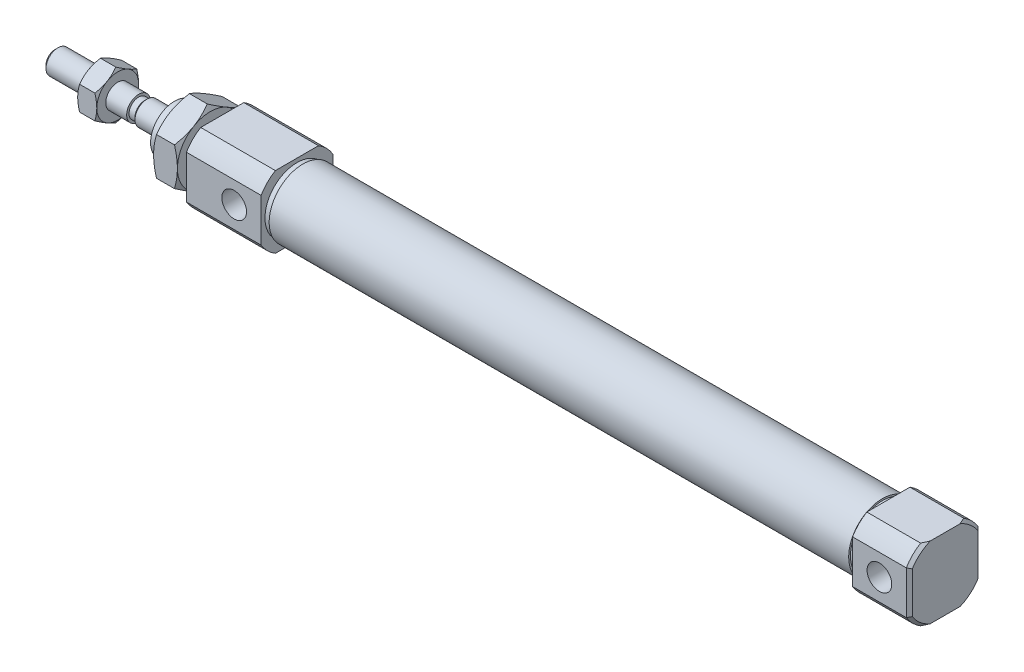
ISO-10303-21;
HEADER;
FILE_DESCRIPTION(('STEP AP214'),'2;1');
FILE_NAME('part.step','',(''),(''),'','','');
FILE_SCHEMA(('AUTOMOTIVE_DESIGN { 1 0 10303 214 1 1 1 1 }'));
ENDSEC;
DATA;
#1=APPLICATION_CONTEXT('core data for automotive mechanical design processes');
#2=APPLICATION_PROTOCOL_DEFINITION('international standard','automotive_design',2000,#1);
#3=PRODUCT_CONTEXT('',#1,'mechanical');
#4=PRODUCT('Part','Part','',(#3));
#5=PRODUCT_RELATED_PRODUCT_CATEGORY('part','',(#4));
#6=PRODUCT_DEFINITION_FORMATION('','',#4);
#7=PRODUCT_DEFINITION_CONTEXT('part definition',#1,'design');
#8=PRODUCT_DEFINITION('design','',#6,#7);
#9=PRODUCT_DEFINITION_SHAPE('','',#8);
#10=(LENGTH_UNIT() NAMED_UNIT(*) SI_UNIT(.MILLI.,.METRE.));
#11=(NAMED_UNIT(*) PLANE_ANGLE_UNIT() SI_UNIT($,.RADIAN.));
#12=(NAMED_UNIT(*) SI_UNIT($,.STERADIAN.) SOLID_ANGLE_UNIT());
#13=UNCERTAINTY_MEASURE_WITH_UNIT(LENGTH_MEASURE(1.E-05),#10,'distance_accuracy_value','');
#14=(GEOMETRIC_REPRESENTATION_CONTEXT(3) GLOBAL_UNCERTAINTY_ASSIGNED_CONTEXT((#13)) GLOBAL_UNIT_ASSIGNED_CONTEXT((#10,
#11,#12)) REPRESENTATION_CONTEXT('',''));
#15=CARTESIAN_POINT('',(0.,0.,0.));
#16=DIRECTION('',(0.,0.,1.));
#17=DIRECTION('',(1.,0.,0.));
#18=AXIS2_PLACEMENT_3D('',#15,#16,#17);
#19=CARTESIAN_POINT('',(-102.898631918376,0.999999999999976,0.));
#20=DIRECTION('',(-1.,0.,0.));
#21=DIRECTION('',(0.,0.,1.));
#22=AXIS2_PLACEMENT_3D('',#19,#20,#21);
#23=PLANE('',#22);
#24=CARTESIAN_POINT('',(-102.898631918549,0.,0.));
#25=DIRECTION('',(1.,0.,0.));
#26=DIRECTION('',(0.,0.,-1.));
#27=AXIS2_PLACEMENT_3D('',#24,#25,#26);
#28=CIRCLE('',#27,1.5000000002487);
#29=CARTESIAN_POINT('',(-102.898631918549,0.,-1.5000000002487));
#30=VERTEX_POINT('',#29);
#31=EDGE_CURVE('E20',#30,#30,#28,.T.);
#32=ORIENTED_EDGE('',*,*,#31,.F.);
#33=EDGE_LOOP('',(#32));
#34=FACE_BOUND('',#33,.T.);
#35=ADVANCED_FACE('F16',(#34),#23,.T.);
#36=CARTESIAN_POINT('',(-102.398631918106,0.,0.));
#37=DIRECTION('',(1.,0.,0.));
#38=DIRECTION('',(0.,0.,-1.));
#39=AXIS2_PLACEMENT_3D('',#36,#37,#38);
#40=CONICAL_SURFACE('',#39,1.99999999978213,0.785398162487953);
#41=ORIENTED_EDGE('',*,*,#31,.T.);
#42=EDGE_LOOP('',(#41));
#43=FACE_BOUND('',#42,.T.);
#44=CARTESIAN_POINT('',(-102.398631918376,0.,0.));
#45=DIRECTION('',(-1.,0.,0.));
#46=DIRECTION('',(0.,-1.,0.));
#47=AXIS2_PLACEMENT_3D('',#44,#45,#46);
#48=CIRCLE('',#47,2.00000000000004);
#49=CARTESIAN_POINT('',(-102.398631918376,-2.00000000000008,0.));
#50=VERTEX_POINT('',#49);
#51=EDGE_CURVE('E849',#50,#50,#48,.F.);
#52=ORIENTED_EDGE('',*,*,#51,.F.);
#53=EDGE_LOOP('',(#52));
#54=FACE_BOUND('',#53,.T.);
#55=ADVANCED_FACE('F462',(#43,#54),#40,.T.);
#56=CARTESIAN_POINT('',(-99.2486319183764,0.,0.));
#57=DIRECTION('',(-1.,0.,0.));
#58=DIRECTION('',(0.,-1.,0.));
#59=AXIS2_PLACEMENT_3D('',#56,#57,#58);
#60=CYLINDRICAL_SURFACE('',#59,2.00000000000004);
#61=ORIENTED_EDGE('',*,*,#51,.T.);
#62=EDGE_LOOP('',(#61));
#63=FACE_BOUND('',#62,.T.);
#64=CARTESIAN_POINT('',(-95.5986319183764,0.,0.));
#65=DIRECTION('',(-1.,0.,0.));
#66=DIRECTION('',(0.,-1.,0.));
#67=AXIS2_PLACEMENT_3D('',#64,#65,#66);
#68=CIRCLE('',#67,2.00000000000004);
#69=CARTESIAN_POINT('',(-95.5986319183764,-2.00000000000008,0.));
#70=VERTEX_POINT('',#69);
#71=EDGE_CURVE('E307',#70,#70,#68,.F.);
#72=ORIENTED_EDGE('',*,*,#71,.F.);
#73=EDGE_LOOP('',(#72));
#74=FACE_BOUND('',#73,.T.);
#75=ADVANCED_FACE('F458',(#63,#74),#60,.T.);
#76=CARTESIAN_POINT('',(-95.5986319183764,3.25,0.));
#77=DIRECTION('',(-1.,0.,0.));
#78=DIRECTION('',(0.,0.,1.));
#79=AXIS2_PLACEMENT_3D('',#76,#77,#78);
#80=PLANE('',#79);
#81=ORIENTED_EDGE('',*,*,#71,.T.);
#82=EDGE_LOOP('',(#81));
#83=FACE_BOUND('',#82,.T.);
#84=CARTESIAN_POINT('',(-95.5986319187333,-2.14744040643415E-12,0.));
#85=DIRECTION('',(1.,0.,0.));
#86=DIRECTION('',(0.,1.,0.));
#87=AXIS2_PLACEMENT_3D('',#84,#85,#86);
#88=CIRCLE('',#87,3.50000000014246);
#89=CARTESIAN_POINT('',(-95.5986319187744,-2.14620279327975E-12,3.50000000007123));
#90=VERTEX_POINT('',#89);
#91=CARTESIAN_POINT('',(-95.5986319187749,-3.03108891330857,1.75000000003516));
#92=VERTEX_POINT('',#91);
#93=EDGE_CURVE('E1588',#90,#92,#88,.T.);
#94=ORIENTED_EDGE('',*,*,#93,.F.);
#95=CARTESIAN_POINT('',(-95.5986319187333,-2.14744040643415E-12,0.));
#96=DIRECTION('',(1.,0.,0.));
#97=DIRECTION('',(0.,1.,0.));
#98=AXIS2_PLACEMENT_3D('',#95,#96,#97);
#99=CIRCLE('',#98,3.50000000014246);
#100=CARTESIAN_POINT('',(-95.5986319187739,3.03108891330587,1.75000000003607));
#101=VERTEX_POINT('',#100);
#102=EDGE_CURVE('E302',#101,#90,#99,.T.);
#103=ORIENTED_EDGE('',*,*,#102,.F.);
#104=CARTESIAN_POINT('',(-95.5986319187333,-2.14744040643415E-12,0.));
#105=DIRECTION('',(1.,0.,0.));
#106=DIRECTION('',(0.,1.,0.));
#107=AXIS2_PLACEMENT_3D('',#104,#105,#106);
#108=CIRCLE('',#107,3.50000000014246);
#109=CARTESIAN_POINT('',(-95.5986319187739,3.03108891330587,-1.75000000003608));
#110=VERTEX_POINT('',#109);
#111=EDGE_CURVE('E296',#110,#101,#108,.T.);
#112=ORIENTED_EDGE('',*,*,#111,.F.);
#113=CARTESIAN_POINT('',(-95.5986319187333,-2.14744040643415E-12,0.));
#114=DIRECTION('',(1.,0.,0.));
#115=DIRECTION('',(0.,1.,0.));
#116=AXIS2_PLACEMENT_3D('',#113,#114,#115);
#117=CIRCLE('',#116,3.50000000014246);
#118=CARTESIAN_POINT('',(-95.5986319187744,-2.14878168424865E-12,-3.50000000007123));
#119=VERTEX_POINT('',#118);
#120=EDGE_CURVE('E299',#119,#110,#117,.T.);
#121=ORIENTED_EDGE('',*,*,#120,.F.);
#122=CARTESIAN_POINT('',(-95.5986319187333,-2.14744040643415E-12,0.));
#123=DIRECTION('',(1.,0.,0.));
#124=DIRECTION('',(0.,1.,0.));
#125=AXIS2_PLACEMENT_3D('',#122,#123,#124);
#126=CIRCLE('',#125,3.50000000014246);
#127=CARTESIAN_POINT('',(-95.5986319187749,-3.03108891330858,-1.75000000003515));
#128=VERTEX_POINT('',#127);
#129=EDGE_CURVE('E318',#128,#119,#126,.T.);
#130=ORIENTED_EDGE('',*,*,#129,.F.);
#131=CARTESIAN_POINT('',(-95.5986319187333,-2.14744040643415E-12,0.));
#132=DIRECTION('',(1.,0.,0.));
#133=DIRECTION('',(0.,1.,0.));
#134=AXIS2_PLACEMENT_3D('',#131,#132,#133);
#135=CIRCLE('',#134,3.50000000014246);
#136=EDGE_CURVE('E1594',#92,#128,#135,.T.);
#137=ORIENTED_EDGE('',*,*,#136,.F.);
#138=EDGE_LOOP('',(#94,#103,#112,#121,#130,#137));
#139=FACE_BOUND('',#138,.T.);
#140=ADVANCED_FACE('F298',(#83,#139),#80,.T.);
#141=CARTESIAN_POINT('',(-95.284148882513,-2.1393477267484E-12,0.));
#142=DIRECTION('',(1.,0.,0.));
#143=DIRECTION('',(0.,1.,0.));
#144=AXIS2_PLACEMENT_3D('',#141,#142,#143);
#145=CONICAL_SURFACE('',#144,4.04470059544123,1.04719754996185);
#146=ORIENTED_EDGE('',*,*,#111,.T.);
#147=CARTESIAN_POINT('',(-95.2860245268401,4.04145188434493,1.37363735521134E-10));
#148=CARTESIAN_POINT('',(-95.3335195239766,3.95920876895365,0.142449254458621));
#149=CARTESIAN_POINT('',(-95.3770332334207,3.87630702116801,0.286039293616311));
#150=CARTESIAN_POINT('',(-95.4537688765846,3.70977275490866,0.574485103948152));
#151=CARTESIAN_POINT('',(-95.4870417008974,3.62614604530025,0.719330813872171));
#152=CARTESIAN_POINT('',(-95.5278950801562,3.49991674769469,0.93796637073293));
#153=CARTESIAN_POINT('',(-95.5400085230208,3.45768086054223,1.01112107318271));
#154=CARTESIAN_POINT('',(-95.5609771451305,3.37300688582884,1.15778069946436));
#155=CARTESIAN_POINT('',(-95.5698324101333,3.33056880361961,1.23128561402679));
#156=CARTESIAN_POINT('',(-95.5841290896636,3.24533346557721,1.37891755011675));
#157=CARTESIAN_POINT('',(-95.5895531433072,3.20253547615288,1.45304584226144));
#158=CARTESIAN_POINT('',(-95.5968120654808,3.11685532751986,1.60144821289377));
#159=CARTESIAN_POINT('',(-95.598646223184,3.07397315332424,1.67572231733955));
#160=CARTESIAN_POINT('',(-95.5986319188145,3.03108891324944,1.74999999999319));
#161=B_SPLINE_CURVE_WITH_KNOTS('',3,(#147,#148,#149,#150,#151,#152,#153,#154,#155,#156,#157,
#158,#159,#160),.UNSPECIFIED.,.F.,.F.,(4,2,2,2,2,2,4),(0.,0.513825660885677,1.02505510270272,
1.28100524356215,1.53694864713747,1.79417690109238,2.05145608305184),.UNSPECIFIED.);
#162=CARTESIAN_POINT('',(-95.2860245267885,4.04145188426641,2.53258599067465E-12));
#163=VERTEX_POINT('',#162);
#164=EDGE_CURVE('E323',#163,#101,#161,.T.);
#165=ORIENTED_EDGE('',*,*,#164,.F.);
#166=CARTESIAN_POINT('',(-95.5986319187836,3.03108891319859,-1.74999999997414));
#167=CARTESIAN_POINT('',(-95.5986462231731,3.0739731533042,-1.67572231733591));
#168=CARTESIAN_POINT('',(-95.596812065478,3.11685532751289,-1.6014482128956));
#169=CARTESIAN_POINT('',(-95.5895531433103,3.2025354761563,-1.45304584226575));
#170=CARTESIAN_POINT('',(-95.5841290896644,3.24533346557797,-1.37891755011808));
#171=CARTESIAN_POINT('',(-95.5698324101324,3.33056880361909,-1.23128561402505));
#172=CARTESIAN_POINT('',(-95.5609771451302,3.37300688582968,-1.15778069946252));
#173=CARTESIAN_POINT('',(-95.5400085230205,3.45768086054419,-1.0111210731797));
#174=CARTESIAN_POINT('',(-95.5278950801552,3.49991674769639,-0.937966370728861));
#175=CARTESIAN_POINT('',(-95.4870417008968,3.62614604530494,-0.719330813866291));
#176=CARTESIAN_POINT('',(-95.4537688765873,3.70977275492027,-0.574485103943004));
#177=CARTESIAN_POINT('',(-95.3770332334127,3.87630702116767,-0.286039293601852));
#178=CARTESIAN_POINT('',(-95.3335195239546,3.9592087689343,-0.142449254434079));
#179=CARTESIAN_POINT('',(-95.2860245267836,4.04145188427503,-9.06233406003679E-11));
#180=B_SPLINE_CURVE_WITH_KNOTS('',3,(#166,#167,#168,#169,#170,#171,#172,#173,#174,#175,#176,
#177,#178,#179),.UNSPECIFIED.,.F.,.F.,(4,2,2,2,2,2,4),(0.,0.257279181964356,0.514507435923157,
0.770450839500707,1.02640098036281,1.53763042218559,2.05145608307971),.UNSPECIFIED.);
#181=EDGE_CURVE('E320',#110,#163,#180,.T.);
#182=ORIENTED_EDGE('',*,*,#181,.F.);
#183=EDGE_LOOP('',(#146,#165,#182));
#184=FACE_BOUND('',#183,.T.);
#185=ADVANCED_FACE('F321',(#184),#145,.T.);
#186=CARTESIAN_POINT('',(-95.284148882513,-2.1393477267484E-12,0.));
#187=DIRECTION('',(1.,0.,0.));
#188=DIRECTION('',(0.,1.,0.));
#189=AXIS2_PLACEMENT_3D('',#186,#187,#188);
#190=CONICAL_SURFACE('',#189,4.04470059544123,1.04719754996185);
#191=CARTESIAN_POINT('',(-95.5986319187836,3.03108891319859,1.74999999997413));
#192=CARTESIAN_POINT('',(-95.5986462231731,2.98820467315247,1.82427768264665));
#193=CARTESIAN_POINT('',(-95.596812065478,2.9453224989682,1.898551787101));
#194=CARTESIAN_POINT('',(-95.5895531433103,2.85964235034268,2.04695415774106));
#195=CARTESIAN_POINT('',(-95.5841290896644,2.8168443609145,2.12108244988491));
#196=CARTESIAN_POINT('',(-95.5698324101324,2.73160902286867,2.2687143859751));
#197=CARTESIAN_POINT('',(-95.5609771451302,2.68917094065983,2.34221930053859));
#198=CARTESIAN_POINT('',(-95.5400085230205,2.60449696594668,2.48887892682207));
#199=CARTESIAN_POINT('',(-95.5278950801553,2.56226107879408,2.56203362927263));
#200=CARTESIAN_POINT('',(-95.4870417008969,2.43603178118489,2.78066918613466));
#201=CARTESIAN_POINT('',(-95.4537688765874,2.35240507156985,2.925514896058));
#202=CARTESIAN_POINT('',(-95.3770332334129,2.18587080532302,3.21396070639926));
#203=CARTESIAN_POINT('',(-95.3335195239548,2.10296905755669,3.35755074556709));
#204=CARTESIAN_POINT('',(-95.2860245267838,2.02072594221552,3.49999999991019));
#205=B_SPLINE_CURVE_WITH_KNOTS('',3,(#191,#192,#193,#194,#195,#196,#197,#198,#199,#200,#201,
#202,#203,#204),.UNSPECIFIED.,.F.,.F.,(4,2,2,2,2,2,4),(0.,0.257279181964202,0.514507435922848,
0.770450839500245,1.0264009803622,1.53763042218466,2.05145608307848),.UNSPECIFIED.);
#206=CARTESIAN_POINT('',(-95.286024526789,2.02072594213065,3.4999999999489));
#207=VERTEX_POINT('',#206);
#208=EDGE_CURVE('E429',#101,#207,#205,.T.);
#209=ORIENTED_EDGE('',*,*,#208,.F.);
#210=ORIENTED_EDGE('',*,*,#102,.T.);
#211=CARTESIAN_POINT('',(-95.2860245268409,2.02072594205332,3.50000000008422));
#212=CARTESIAN_POINT('',(-95.3335195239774,1.85623971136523,3.50000000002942));
#213=CARTESIAN_POINT('',(-95.3770332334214,1.69043621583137,3.50000000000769));
#214=CARTESIAN_POINT('',(-95.4537688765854,1.35736768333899,3.49999999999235));
#215=CARTESIAN_POINT('',(-95.4870417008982,1.19011426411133,3.4999999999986));
#216=CARTESIAN_POINT('',(-95.5278950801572,0.93765566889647,3.5000000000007));
#217=CARTESIAN_POINT('',(-95.5400085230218,0.853183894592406,3.50000000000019));
#218=CARTESIAN_POINT('',(-95.5609771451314,0.683835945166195,3.49999999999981));
#219=CARTESIAN_POINT('',(-95.5698324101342,0.598959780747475,3.49999999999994));
#220=CARTESIAN_POINT('',(-95.5841290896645,0.42848910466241,3.50000000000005));
#221=CARTESIAN_POINT('',(-95.5895531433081,0.342893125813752,3.50000000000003));
#222=CARTESIAN_POINT('',(-95.5968120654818,0.17153282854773,3.49999999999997));
#223=CARTESIAN_POINT('',(-95.598646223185,0.0857684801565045,3.49999999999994));
#224=CARTESIAN_POINT('',(-95.5986319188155,6.77269858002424E-12,3.5));
#225=B_SPLINE_CURVE_WITH_KNOTS('',3,(#211,#212,#213,#214,#215,#216,#217,#218,#219,#220,#221,
#222,#223,#224),.UNSPECIFIED.,.F.,.F.,(4,2,2,2,2,2,4),(0.,0.513825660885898,1.02505510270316,
1.2810052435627,1.53694864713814,1.79417690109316,2.05145608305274),.UNSPECIFIED.);
#226=EDGE_CURVE('E436',#207,#90,#225,.T.);
#227=ORIENTED_EDGE('',*,*,#226,.F.);
#228=EDGE_LOOP('',(#209,#210,#227));
#229=FACE_BOUND('',#228,.T.);
#230=ADVANCED_FACE('F444',(#229),#190,.T.);
#231=CARTESIAN_POINT('',(-95.284148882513,-2.1393477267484E-12,0.));
#232=DIRECTION('',(1.,0.,0.));
#233=DIRECTION('',(0.,1.,0.));
#234=AXIS2_PLACEMENT_3D('',#231,#232,#233);
#235=CONICAL_SURFACE('',#234,4.04470059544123,1.04719754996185);
#236=CARTESIAN_POINT('',(-95.5986319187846,-2.1459566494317E-12,3.4999999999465));
#237=CARTESIAN_POINT('',(-95.5986462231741,-0.0857684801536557,3.49999999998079));
#238=CARTESIAN_POINT('',(-95.596812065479,-0.171532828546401,3.49999999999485));
#239=CARTESIAN_POINT('',(-95.5895531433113,-0.342893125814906,3.50000000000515));
#240=CARTESIAN_POINT('',(-95.5841290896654,-0.42848910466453,3.50000000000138));
#241=CARTESIAN_POINT('',(-95.5698324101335,-0.598959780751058,3.49999999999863));
#242=CARTESIAN_POINT('',(-95.5609771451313,-0.683835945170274,3.49999999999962));
#243=CARTESIAN_POINT('',(-95.5400085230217,-0.853183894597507,3.50000000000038));
#244=CARTESIAN_POINT('',(-95.5278950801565,-0.937655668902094,3.50000000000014));
#245=CARTESIAN_POINT('',(-95.4870417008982,-1.19011426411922,3.49999999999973));
#246=CARTESIAN_POINT('',(-95.453768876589,-1.35736768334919,3.49999999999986));
#247=CARTESIAN_POINT('',(-95.3770332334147,-1.6904362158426,3.50000000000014));
#248=CARTESIAN_POINT('',(-95.3335195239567,-1.85623971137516,3.50000000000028));
#249=CARTESIAN_POINT('',(-95.2860245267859,-2.02072594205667,3.5));
#250=B_SPLINE_CURVE_WITH_KNOTS('',3,(#236,#237,#238,#239,#240,#241,#242,#243,#244,#245,#246,
#247,#248,#249),.UNSPECIFIED.,.F.,.F.,(4,2,2,2,2,2,4),(0.,0.257279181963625,0.514507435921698,
0.770450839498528,1.02640098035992,1.53763042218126,2.05145608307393),.UNSPECIFIED.);
#251=CARTESIAN_POINT('',(-95.2860245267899,-2.02072594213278,3.49999999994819));
#252=VERTEX_POINT('',#251);
#253=EDGE_CURVE('E845',#90,#252,#250,.T.);
#254=ORIENTED_EDGE('',*,*,#253,.F.);
#255=ORIENTED_EDGE('',*,*,#93,.T.);
#256=CARTESIAN_POINT('',(-95.2860245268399,-2.02072594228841,3.49999999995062));
#257=CARTESIAN_POINT('',(-95.3335195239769,-2.10296905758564,3.35755074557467));
#258=CARTESIAN_POINT('',(-95.3770332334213,-2.18587080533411,3.21396070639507));
#259=CARTESIAN_POINT('',(-95.4537688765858,-2.3524050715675,2.92551489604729));
#260=CARTESIAN_POINT('',(-95.4870417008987,-2.43603178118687,2.7806691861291));
#261=CARTESIAN_POINT('',(-95.5278950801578,-2.56226107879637,2.56203362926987));
#262=CARTESIAN_POINT('',(-95.5400085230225,-2.60449696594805,2.4888789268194));
#263=CARTESIAN_POINT('',(-95.5609771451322,-2.68917094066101,2.342219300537));
#264=CARTESIAN_POINT('',(-95.569832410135,-2.73160902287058,2.26871438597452));
#265=CARTESIAN_POINT('',(-95.5841290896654,-2.81684436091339,2.12108244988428));
#266=CARTESIAN_POINT('',(-95.5895531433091,-2.85964235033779,2.04695415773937));
#267=CARTESIAN_POINT('',(-95.5968120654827,-2.94532249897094,1.89855178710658));
#268=CARTESIAN_POINT('',(-95.598646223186,-2.98820467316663,1.82427768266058));
#269=CARTESIAN_POINT('',(-95.5986319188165,-3.03108891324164,1.7500000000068));
#270=B_SPLINE_CURVE_WITH_KNOTS('',3,(#256,#257,#258,#259,#260,#261,#262,#263,#264,#265,#266,
#267,#268,#269),.UNSPECIFIED.,.F.,.F.,(4,2,2,2,2,2,4),(0.,0.513825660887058,1.02505510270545,
1.28100524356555,1.53694864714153,1.79417690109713,2.05145608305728),.UNSPECIFIED.);
#271=EDGE_CURVE('E844',#252,#92,#270,.T.);
#272=ORIENTED_EDGE('',*,*,#271,.F.);
#273=EDGE_LOOP('',(#254,#255,#272));
#274=FACE_BOUND('',#273,.T.);
#275=ADVANCED_FACE('F448',(#274),#235,.T.);
#276=CARTESIAN_POINT('',(-95.284148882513,-2.1393477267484E-12,0.));
#277=DIRECTION('',(1.,0.,0.));
#278=DIRECTION('',(0.,1.,0.));
#279=AXIS2_PLACEMENT_3D('',#276,#277,#278);
#280=CONICAL_SURFACE('',#279,4.04470059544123,1.04719754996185);
#281=ORIENTED_EDGE('',*,*,#136,.T.);
#282=CARTESIAN_POINT('',(-95.2860245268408,-4.04145188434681,-1.3346526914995E-10));
#283=CARTESIAN_POINT('',(-95.3335195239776,-3.95920876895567,-0.142449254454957));
#284=CARTESIAN_POINT('',(-95.3770332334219,-3.87630702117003,-0.286039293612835));
#285=CARTESIAN_POINT('',(-95.4537688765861,-3.70977275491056,-0.57448510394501));
#286=CARTESIAN_POINT('',(-95.4870417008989,-3.62614604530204,-0.719330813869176));
#287=CARTESIAN_POINT('',(-95.5278950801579,-3.49991674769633,-0.937966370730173));
#288=CARTESIAN_POINT('',(-95.5400085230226,-3.45768086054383,-1.01112107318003));
#289=CARTESIAN_POINT('',(-95.5609771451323,-3.37300688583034,-1.15778069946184));
#290=CARTESIAN_POINT('',(-95.5698324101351,-3.33056880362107,-1.23128561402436));
#291=CARTESIAN_POINT('',(-95.5841290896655,-3.24533346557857,-1.37891755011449));
#292=CARTESIAN_POINT('',(-95.5895531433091,-3.20253547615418,-1.45304584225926));
#293=CARTESIAN_POINT('',(-95.5968120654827,-3.11685532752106,-1.60144821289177));
#294=CARTESIAN_POINT('',(-95.598646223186,-3.0739731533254,-1.67572231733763));
#295=CARTESIAN_POINT('',(-95.5986319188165,-3.03108891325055,-1.74999999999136));
#296=B_SPLINE_CURVE_WITH_KNOTS('',3,(#282,#283,#284,#285,#286,#287,#288,#289,#290,#291,#292,
#293,#294,#295),.UNSPECIFIED.,.F.,.F.,(4,2,2,2,2,2,4),(0.,0.513825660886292,1.02505510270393,
1.28100524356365,1.53694864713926,1.79417690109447,2.05145608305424),.UNSPECIFIED.);
#297=CARTESIAN_POINT('',(-95.2860245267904,-4.04145188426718,0.));
#298=VERTEX_POINT('',#297);
#299=EDGE_CURVE('E839',#298,#128,#296,.T.);
#300=ORIENTED_EDGE('',*,*,#299,.F.);
#301=CARTESIAN_POINT('',(-95.5986319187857,-3.03108891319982,1.74999999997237));
#302=CARTESIAN_POINT('',(-95.5986462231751,-3.07397315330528,1.67572231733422));
#303=CARTESIAN_POINT('',(-95.59681206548,-3.11685532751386,1.60144821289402));
#304=CARTESIAN_POINT('',(-95.5895531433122,-3.20253547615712,1.45304584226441));
#305=CARTESIAN_POINT('',(-95.5841290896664,-3.24533346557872,1.37891755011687));
#306=CARTESIAN_POINT('',(-95.5698324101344,-3.3305688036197,1.23128561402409));
#307=CARTESIAN_POINT('',(-95.5609771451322,-3.37300688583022,1.15778069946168));
#308=CARTESIAN_POINT('',(-95.5400085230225,-3.45768086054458,1.01112107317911));
#309=CARTESIAN_POINT('',(-95.5278950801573,-3.49991674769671,0.937966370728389));
#310=CARTESIAN_POINT('',(-95.4870417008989,-3.62614604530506,0.719330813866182));
#311=CARTESIAN_POINT('',(-95.4537688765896,-3.70977275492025,0.574485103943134));
#312=CARTESIAN_POINT('',(-95.3770332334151,-3.87630702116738,0.286039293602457));
#313=CARTESIAN_POINT('',(-95.3335195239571,-3.95920876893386,0.142449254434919));
#314=CARTESIAN_POINT('',(-95.2860245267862,-4.04145188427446,9.16968197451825E-11));
#315=B_SPLINE_CURVE_WITH_KNOTS('',3,(#301,#302,#303,#304,#305,#306,#307,#308,#309,#310,#311,
#312,#313,#314),.UNSPECIFIED.,.F.,.F.,(4,2,2,2,2,2,4),(0.,0.257279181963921,0.514507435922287,
0.770450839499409,1.02640098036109,1.53763042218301,2.05145608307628),.UNSPECIFIED.);
#316=EDGE_CURVE('E840',#92,#298,#315,.T.);
#317=ORIENTED_EDGE('',*,*,#316,.F.);
#318=EDGE_LOOP('',(#281,#300,#317));
#319=FACE_BOUND('',#318,.T.);
#320=ADVANCED_FACE('F1483',(#319),#280,.T.);
#321=CARTESIAN_POINT('',(-95.284148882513,-2.1393477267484E-12,0.));
#322=DIRECTION('',(1.,0.,0.));
#323=DIRECTION('',(0.,1.,0.));
#324=AXIS2_PLACEMENT_3D('',#321,#322,#323);
#325=CONICAL_SURFACE('',#324,4.04470059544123,1.04719754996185);
#326=ORIENTED_EDGE('',*,*,#129,.T.);
#327=CARTESIAN_POINT('',(-95.2860245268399,-2.02072594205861,-3.5000000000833));
#328=CARTESIAN_POINT('',(-95.3335195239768,-1.85623971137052,-3.5000000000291));
#329=CARTESIAN_POINT('',(-95.377033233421,-1.6904362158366,-3.50000000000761));
#330=CARTESIAN_POINT('',(-95.4537688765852,-1.35736768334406,-3.49999999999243));
#331=CARTESIAN_POINT('',(-95.487041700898,-1.19011426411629,-3.49999999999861));
#332=CARTESIAN_POINT('',(-95.527895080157,-0.937655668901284,-3.5000000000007));
#333=CARTESIAN_POINT('',(-95.5400085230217,-0.853183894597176,-3.50000000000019));
#334=CARTESIAN_POINT('',(-95.5609771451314,-0.683835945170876,-3.49999999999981));
#335=CARTESIAN_POINT('',(-95.5698324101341,-0.598959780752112,-3.49999999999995));
#336=CARTESIAN_POINT('',(-95.5841290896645,-0.428489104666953,-3.50000000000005));
#337=CARTESIAN_POINT('',(-95.5895531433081,-0.342893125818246,-3.50000000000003));
#338=CARTESIAN_POINT('',(-95.5968120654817,-0.171532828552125,-3.49999999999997));
#339=CARTESIAN_POINT('',(-95.598646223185,-0.0857684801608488,-3.49999999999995));
#340=CARTESIAN_POINT('',(-95.5986319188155,-1.10670810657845E-11,-3.5));
#341=B_SPLINE_CURVE_WITH_KNOTS('',3,(#327,#328,#329,#330,#331,#332,#333,#334,#335,#336,#337,
#338,#339,#340),.UNSPECIFIED.,.F.,.F.,(4,2,2,2,2,2,4),(0.,0.51382566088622,1.02505510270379,
1.28100524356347,1.53694864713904,1.79417690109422,2.05145608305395),.UNSPECIFIED.);
#342=CARTESIAN_POINT('',(-95.2860245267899,-2.02072594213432,-3.4999999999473));
#343=VERTEX_POINT('',#342);
#344=EDGE_CURVE('E359',#343,#119,#341,.T.);
#345=ORIENTED_EDGE('',*,*,#344,.F.);
#346=CARTESIAN_POINT('',(-95.5986319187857,-3.03108891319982,-1.74999999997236));
#347=CARTESIAN_POINT('',(-95.5986462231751,-2.98820467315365,-1.8242776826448));
#348=CARTESIAN_POINT('',(-95.59681206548,-2.94532249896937,-1.89855178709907));
#349=CARTESIAN_POINT('',(-95.5895531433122,-2.85964235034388,-2.04695415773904));
#350=CARTESIAN_POINT('',(-95.5841290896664,-2.81684436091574,-2.12108244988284));
#351=CARTESIAN_POINT('',(-95.5698324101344,-2.73160902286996,-2.26871438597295));
#352=CARTESIAN_POINT('',(-95.5609771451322,-2.68917094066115,-2.34221930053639));
#353=CARTESIAN_POINT('',(-95.5400085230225,-2.60449696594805,-2.48887892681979));
#354=CARTESIAN_POINT('',(-95.5278950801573,-2.56226107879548,-2.5620336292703));
#355=CARTESIAN_POINT('',(-95.4870417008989,-2.43603178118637,-2.7806691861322));
#356=CARTESIAN_POINT('',(-95.4537688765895,-2.35240507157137,-2.92551489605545));
#357=CARTESIAN_POINT('',(-95.377033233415,-2.18587080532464,-3.21396070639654));
#358=CARTESIAN_POINT('',(-95.3335195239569,-2.10296905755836,-3.35755074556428));
#359=CARTESIAN_POINT('',(-95.2860245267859,-2.02072594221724,-3.49999999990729));
#360=B_SPLINE_CURVE_WITH_KNOTS('',3,(#346,#347,#348,#349,#350,#351,#352,#353,#354,#355,#356,
#357,#358,#359),.UNSPECIFIED.,.F.,.F.,(4,2,2,2,2,2,4),(0.,0.257279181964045,0.514507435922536,
0.770450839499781,1.02640098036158,1.53763042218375,2.05145608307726),.UNSPECIFIED.);
#361=EDGE_CURVE('E835',#128,#343,#360,.T.);
#362=ORIENTED_EDGE('',*,*,#361,.F.);
#363=EDGE_LOOP('',(#326,#345,#362));
#364=FACE_BOUND('',#363,.T.);
#365=ADVANCED_FACE('F348',(#364),#325,.T.);
#366=CARTESIAN_POINT('',(-95.284148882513,-2.1393477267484E-12,0.));
#367=DIRECTION('',(1.,0.,0.));
#368=DIRECTION('',(0.,1.,0.));
#369=AXIS2_PLACEMENT_3D('',#366,#367,#368);
#370=CONICAL_SURFACE('',#369,4.04470059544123,1.04719754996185);
#371=ORIENTED_EDGE('',*,*,#120,.T.);
#372=CARTESIAN_POINT('',(-95.2860245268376,2.02072594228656,-3.4999999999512));
#373=CARTESIAN_POINT('',(-95.333519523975,2.10296905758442,-3.3575507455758));
#374=CARTESIAN_POINT('',(-95.3770332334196,2.18587080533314,-3.21396070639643));
#375=CARTESIAN_POINT('',(-95.453768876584,2.35240507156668,-2.92551489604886));
#376=CARTESIAN_POINT('',(-95.4870417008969,2.43603178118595,-2.78066918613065));
#377=CARTESIAN_POINT('',(-95.5278950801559,2.56226107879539,-2.56203362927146));
#378=CARTESIAN_POINT('',(-95.5400085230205,2.60449696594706,-2.48887892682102));
#379=CARTESIAN_POINT('',(-95.5609771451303,2.68917094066,-2.34221930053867));
#380=CARTESIAN_POINT('',(-95.5698324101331,2.73160902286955,-2.26871438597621));
#381=CARTESIAN_POINT('',(-95.5841290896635,2.81684436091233,-2.12108244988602));
#382=CARTESIAN_POINT('',(-95.5895531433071,2.85964235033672,-2.04695415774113));
#383=CARTESIAN_POINT('',(-95.5968120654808,2.94532249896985,-1.89855178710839));
#384=CARTESIAN_POINT('',(-95.598646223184,2.98820467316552,-1.82427768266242));
#385=CARTESIAN_POINT('',(-95.5986319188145,3.03108891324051,-1.75000000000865));
#386=B_SPLINE_CURVE_WITH_KNOTS('',3,(#372,#373,#374,#375,#376,#377,#378,#379,#380,#381,#382,
#383,#384,#385),.UNSPECIFIED.,.F.,.F.,(4,2,2,2,2,2,4),(0.,0.513825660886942,1.02505510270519,
1.2810052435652,1.53694864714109,1.7941769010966,2.05145608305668),.UNSPECIFIED.);
#387=CARTESIAN_POINT('',(-95.2860245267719,2.02072594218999,-3.4999999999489));
#388=VERTEX_POINT('',#387);
#389=EDGE_CURVE('E313',#388,#110,#386,.T.);
#390=ORIENTED_EDGE('',*,*,#389,.F.);
#391=CARTESIAN_POINT('',(-95.5986319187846,-2.14948002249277E-12,-3.4999999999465));
#392=CARTESIAN_POINT('',(-95.5986462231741,0.0857684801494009,-3.49999999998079));
#393=CARTESIAN_POINT('',(-95.596812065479,0.171532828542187,-3.49999999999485));
#394=CARTESIAN_POINT('',(-95.5895531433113,0.342893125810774,-3.50000000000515));
#395=CARTESIAN_POINT('',(-95.5841290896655,0.428489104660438,-3.50000000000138));
#396=CARTESIAN_POINT('',(-95.5698324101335,0.598959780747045,-3.49999999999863));
#397=CARTESIAN_POINT('',(-95.5609771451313,0.683835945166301,-3.49999999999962));
#398=CARTESIAN_POINT('',(-95.5400085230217,0.853183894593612,-3.50000000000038));
#399=CARTESIAN_POINT('',(-95.5278950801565,0.937655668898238,-3.50000000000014));
#400=CARTESIAN_POINT('',(-95.4870417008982,1.19011426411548,-3.49999999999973));
#401=CARTESIAN_POINT('',(-95.4537688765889,1.35736768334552,-3.49999999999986));
#402=CARTESIAN_POINT('',(-95.3770332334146,1.6904362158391,-3.50000000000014));
#403=CARTESIAN_POINT('',(-95.3335195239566,1.85623971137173,-3.50000000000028));
#404=CARTESIAN_POINT('',(-95.2860245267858,2.02072594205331,-3.5));
#405=B_SPLINE_CURVE_WITH_KNOTS('',3,(#391,#392,#393,#394,#395,#396,#397,#398,#399,#400,#401,
#402,#403,#404),.UNSPECIFIED.,.F.,.F.,(4,2,2,2,2,2,4),(0.,0.257279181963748,0.514507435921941,
0.770450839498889,1.0264009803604,1.53763042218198,2.05145608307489),.UNSPECIFIED.);
#406=EDGE_CURVE('E316',#119,#388,#405,.T.);
#407=ORIENTED_EDGE('',*,*,#406,.F.);
#408=EDGE_LOOP('',(#371,#390,#407));
#409=FACE_BOUND('',#408,.T.);
#410=ADVANCED_FACE('F311',(#409),#370,.T.);
#411=CARTESIAN_POINT('',(-95.5986319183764,4.04145188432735,0.));
#412=DIRECTION('',(0.,0.866025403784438,-0.500000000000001));
#413=DIRECTION('',(0.,0.500000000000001,0.866025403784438));
#414=AXIS2_PLACEMENT_3D('',#411,#412,#413);
#415=PLANE('',#414);
#416=ORIENTED_EDGE('',*,*,#181,.T.);
#417=DIRECTION('',(1.,0.,0.));
#418=VECTOR('',#417,1.);
#419=CARTESIAN_POINT('',(-95.5986319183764,4.04145188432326,7.08764644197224E-12));
#420=LINE('',#419,#418);
#421=CARTESIAN_POINT('',(-92.7112392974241,4.04145186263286,3.75759622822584E-08));
#422=VERTEX_POINT('',#421);
#423=EDGE_CURVE('E326',#422,#163,#420,.F.);
#424=ORIENTED_EDGE('',*,*,#423,.F.);
#425=CARTESIAN_POINT('',(-92.3986319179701,3.0310889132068,-1.74999999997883));
#426=CARTESIAN_POINT('',(-92.3986176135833,3.0739731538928,-1.67572231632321));
#427=CARTESIAN_POINT('',(-92.40045177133,3.11685532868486,-1.6014482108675));
#428=CARTESIAN_POINT('',(-92.4077106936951,3.20253547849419,-1.45304583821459));
#429=CARTESIAN_POINT('',(-92.4131347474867,3.2453334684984,-1.37891754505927));
#430=CARTESIAN_POINT('',(-92.4274314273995,3.3305688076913,-1.23128560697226));
#431=CARTESIAN_POINT('',(-92.436286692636,3.37300689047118,-1.15778069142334));
#432=CARTESIAN_POINT('',(-92.4572553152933,3.457680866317,-1.01112106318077));
#433=CARTESIAN_POINT('',(-92.4693687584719,3.49991675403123,-0.937966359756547));
#434=CARTESIAN_POINT('',(-92.5102221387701,3.62614605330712,-0.719330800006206));
#435=CARTESIAN_POINT('',(-92.5434949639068,3.70977276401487,-0.574485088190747));
#436=CARTESIAN_POINT('',(-92.6202306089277,3.87630703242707,-0.286039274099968));
#437=CARTESIAN_POINT('',(-92.6637443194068,3.95920878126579,-0.142449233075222));
#438=CARTESIAN_POINT('',(-92.7112393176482,4.04145189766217,2.30965804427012E-08));
#439=B_SPLINE_CURVE_WITH_KNOTS('',3,(#425,#426,#427,#428,#429,#430,#431,#432,#433,#434,#435,
#436,#437,#438),.UNSPECIFIED.,.F.,.F.,(4,2,2,2,2,2,4),(0.,0.257279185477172,0.51450744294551,
0.770450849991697,1.02640099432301,1.53763044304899,2.05145611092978),.UNSPECIFIED.);
#440=CARTESIAN_POINT('',(-92.3986319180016,3.03108891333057,-1.75000000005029));
#441=VERTEX_POINT('',#440);
#442=EDGE_CURVE('E404',#441,#422,#439,.T.);
#443=ORIENTED_EDGE('',*,*,#442,.F.);
#444=CARTESIAN_POINT('',(-92.711239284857,2.02072598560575,-3.49999992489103));
#445=CARTESIAN_POINT('',(-92.6637442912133,2.10296909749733,-3.35755067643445));
#446=CARTESIAN_POINT('',(-92.6202305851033,2.18587084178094,-3.21396064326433));
#447=CARTESIAN_POINT('',(-92.5434949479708,2.35240510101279,-2.92551484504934));
#448=CARTESIAN_POINT('',(-92.5102221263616,2.43603180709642,-2.78066914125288));
#449=CARTESIAN_POINT('',(-92.4693687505,2.56226109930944,-2.56203359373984));
#450=CARTESIAN_POINT('',(-92.4572553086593,2.60449698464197,-2.48887889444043));
#451=CARTESIAN_POINT('',(-92.4362866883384,2.68917095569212,-2.34221927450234));
#452=CARTESIAN_POINT('',(-92.4274314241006,2.73160903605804,-2.2687143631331));
#453=CARTESIAN_POINT('',(-92.4131347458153,2.81684437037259,-2.12108243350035));
#454=CARTESIAN_POINT('',(-92.4077106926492,2.85964235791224,-2.04695414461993));
#455=CARTESIAN_POINT('',(-92.400451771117,2.94532250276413,-1.89855178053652));
#456=CARTESIAN_POINT('',(-92.3986176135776,2.98820467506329,-1.8242776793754));
#457=CARTESIAN_POINT('',(-92.3986319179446,3.03108891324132,-1.75000000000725));
#458=B_SPLINE_CURVE_WITH_KNOTS('',3,(#444,#445,#446,#447,#448,#449,#450,#451,#452,#453,#454,
#455,#456,#457),.UNSPECIFIED.,.F.,.F.,(4,2,2,2,2,2,4),(0.,0.513825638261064,1.02505505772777,
1.28100518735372,1.5369485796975,1.79417682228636,2.05145599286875),.UNSPECIFIED.);
#459=CARTESIAN_POINT('',(-92.7112392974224,2.02072596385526,-3.49999996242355));
#460=VERTEX_POINT('',#459);
#461=EDGE_CURVE('E360',#460,#441,#458,.T.);
#462=ORIENTED_EDGE('',*,*,#461,.F.);
#463=DIRECTION('',(-1.,0.,0.));
#464=VECTOR('',#463,1.);
#465=CARTESIAN_POINT('',(-95.5986319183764,2.02072594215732,-3.5));
#466=LINE('',#465,#464);
#467=EDGE_CURVE('E330',#388,#460,#466,.F.);
#468=ORIENTED_EDGE('',*,*,#467,.F.);
#469=ORIENTED_EDGE('',*,*,#389,.T.);
#470=EDGE_LOOP('',(#416,#424,#443,#462,#468,#469));
#471=FACE_BOUND('',#470,.T.);
#472=ADVANCED_FACE('F328',(#471),#415,.T.);
#473=CARTESIAN_POINT('',(-95.5986319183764,2.02072594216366,3.5));
#474=DIRECTION('',(0.,0.866025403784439,0.5));
#475=DIRECTION('',(0.,-0.5,0.866025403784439));
#476=AXIS2_PLACEMENT_3D('',#473,#474,#475);
#477=PLANE('',#476);
#478=ORIENTED_EDGE('',*,*,#208,.T.);
#479=DIRECTION('',(1.,0.,0.));
#480=VECTOR('',#479,1.);
#481=CARTESIAN_POINT('',(-95.5986319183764,2.02072594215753,3.5));
#482=LINE('',#481,#480);
#483=CARTESIAN_POINT('',(-92.7112392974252,2.02072589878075,3.5));
#484=VERTEX_POINT('',#483);
#485=EDGE_CURVE('E435',#484,#207,#482,.F.);
#486=ORIENTED_EDGE('',*,*,#485,.F.);
#487=CARTESIAN_POINT('',(-92.3986319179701,3.0310889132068,1.74999999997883));
#488=CARTESIAN_POINT('',(-92.3986176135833,2.98820467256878,1.82427768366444));
#489=CARTESIAN_POINT('',(-92.4004517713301,2.94532249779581,1.89855178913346));
#490=CARTESIAN_POINT('',(-92.4077106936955,2.85964234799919,2.04695416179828));
#491=CARTESIAN_POINT('',(-92.4131347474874,2.81684435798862,2.12108245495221));
#492=CARTESIAN_POINT('',(-92.4274314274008,2.73160901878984,2.26871439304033));
#493=CARTESIAN_POINT('',(-92.4362866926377,2.68917093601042,2.34221930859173));
#494=CARTESIAN_POINT('',(-92.4572553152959,2.60449696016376,2.48887893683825));
#495=CARTESIAN_POINT('',(-92.4693687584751,2.56226107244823,2.56203364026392));
#496=CARTESIAN_POINT('',(-92.510222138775,2.43603177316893,2.78066920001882));
#497=CARTESIAN_POINT('',(-92.5434949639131,2.35240506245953,2.92551491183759));
#498=CARTESIAN_POINT('',(-92.6202306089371,2.18587079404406,3.21396072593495));
#499=CARTESIAN_POINT('',(-92.663744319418,2.10296904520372,3.35755076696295));
#500=CARTESIAN_POINT('',(-92.7112393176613,2.02072592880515,3.50000002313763));
#501=B_SPLINE_CURVE_WITH_KNOTS('',3,(#487,#488,#489,#490,#491,#492,#493,#494,#495,#496,#497,
#498,#499,#500),.UNSPECIFIED.,.F.,.F.,(4,2,2,2,2,2,4),(0.,0.257279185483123,0.514507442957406,
0.770450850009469,1.02640099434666,1.53763044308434,2.05145611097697),.UNSPECIFIED.);
#502=CARTESIAN_POINT('',(-92.3986319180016,3.03108891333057,1.75000000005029));
#503=VERTEX_POINT('',#502);
#504=EDGE_CURVE('E423',#503,#484,#501,.T.);
#505=ORIENTED_EDGE('',*,*,#504,.F.);
#506=CARTESIAN_POINT('',(-92.7112392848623,4.04145184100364,7.51672302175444E-08));
#507=CARTESIAN_POINT('',(-92.6637442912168,3.95920872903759,0.142449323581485));
#508=CARTESIAN_POINT('',(-92.6202305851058,3.87630698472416,0.286039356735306));
#509=CARTESIAN_POINT('',(-92.5434949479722,3.70977272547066,0.574485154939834));
#510=CARTESIAN_POINT('',(-92.5102221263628,3.62614601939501,0.719330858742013));
#511=CARTESIAN_POINT('',(-92.4693687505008,3.49991672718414,0.937966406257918));
#512=CARTESIAN_POINT('',(-92.45725530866,3.45768084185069,1.01112110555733));
#513=CARTESIAN_POINT('',(-92.4362866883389,3.37300687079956,1.15778072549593));
#514=CARTESIAN_POINT('',(-92.427431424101,3.33056879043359,1.23128563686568));
#515=CARTESIAN_POINT('',(-92.4131347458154,3.24533345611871,1.37891756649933));
#516=CARTESIAN_POINT('',(-92.4077106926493,3.20253546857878,1.45304585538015));
#517=CARTESIAN_POINT('',(-92.400451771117,3.11685532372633,1.60144821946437));
#518=CARTESIAN_POINT('',(-92.3986176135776,3.07397315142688,1.6757223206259));
#519=CARTESIAN_POINT('',(-92.3986319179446,3.03108891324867,1.74999999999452));
#520=B_SPLINE_CURVE_WITH_KNOTS('',3,(#506,#507,#508,#509,#510,#511,#512,#513,#514,#515,#516,
#517,#518,#519),.UNSPECIFIED.,.F.,.F.,(4,2,2,2,2,2,4),(0.,0.513825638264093,1.02505505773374,
1.28100518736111,1.53694857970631,1.79417682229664,2.05145599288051),.UNSPECIFIED.);
#521=EDGE_CURVE('E398',#422,#503,#520,.T.);
#522=ORIENTED_EDGE('',*,*,#521,.F.);
#523=ORIENTED_EDGE('',*,*,#423,.T.);
#524=ORIENTED_EDGE('',*,*,#164,.T.);
#525=EDGE_LOOP('',(#478,#486,#505,#522,#523,#524));
#526=FACE_BOUND('',#525,.T.);
#527=ADVANCED_FACE('F412',(#526),#477,.T.);
#528=CARTESIAN_POINT('',(-95.5986319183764,-2.02072594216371,3.5));
#529=DIRECTION('',(0.,0.,1.));
#530=DIRECTION('',(1.,0.,0.));
#531=AXIS2_PLACEMENT_3D('',#528,#529,#530);
#532=PLANE('',#531);
#533=ORIENTED_EDGE('',*,*,#253,.T.);
#534=DIRECTION('',(1.,0.,0.));
#535=VECTOR('',#534,1.);
#536=CARTESIAN_POINT('',(-95.5986319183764,-2.0207259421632,3.50000000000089));
#537=LINE('',#536,#535);
#538=CARTESIAN_POINT('',(-92.7112392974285,-2.02072596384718,3.49999996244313));
#539=VERTEX_POINT('',#538);
#540=EDGE_CURVE('E841',#539,#252,#537,.F.);
#541=ORIENTED_EDGE('',*,*,#540,.F.);
#542=CARTESIAN_POINT('',(-92.3986319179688,-2.0626854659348E-12,3.49999999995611));
#543=CARTESIAN_POINT('',(-92.3986176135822,-0.0857684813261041,3.49999999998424));
#544=CARTESIAN_POINT('',(-92.4004517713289,-0.171532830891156,3.49999999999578));
#545=CARTESIAN_POINT('',(-92.4077106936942,-0.342893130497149,3.50000000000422));
#546=CARTESIAN_POINT('',(-92.413134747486,-0.428489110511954,3.50000000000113));
#547=CARTESIAN_POINT('',(-92.4274314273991,-0.598959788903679,3.49999999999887));
#548=CARTESIAN_POINT('',(-92.4362866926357,-0.683835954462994,3.49999999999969));
#549=CARTESIAN_POINT('',(-92.4572553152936,-0.853183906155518,3.50000000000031));
#550=CARTESIAN_POINT('',(-92.4693687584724,-0.937655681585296,3.50000000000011));
#551=CARTESIAN_POINT('',(-92.5102221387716,-1.19011428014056,3.49999999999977));
#552=CARTESIAN_POINT('',(-92.543494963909,-1.35736770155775,3.49999999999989));
#553=CARTESIAN_POINT('',(-92.6202306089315,-1.69043623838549,3.50000000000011));
#554=CARTESIAN_POINT('',(-92.6637443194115,-1.85623973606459,3.50000000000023));
#555=CARTESIAN_POINT('',(-92.7112393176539,-2.02072596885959,3.5));
#556=B_SPLINE_CURVE_WITH_KNOTS('',3,(#542,#543,#544,#545,#546,#547,#548,#549,#550,#551,#552,
#553,#554,#555),.UNSPECIFIED.,.F.,.F.,(4,2,2,2,2,2,4),(0.,0.257279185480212,0.514507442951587,
0.770450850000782,1.0264009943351,1.53763044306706,2.05145611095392),.UNSPECIFIED.);
#557=CARTESIAN_POINT('',(-92.398631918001,-2.06251825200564E-12,3.50000000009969));
#558=VERTEX_POINT('',#557);
#559=EDGE_CURVE('E1634',#558,#539,#556,.T.);
#560=ORIENTED_EDGE('',*,*,#559,.F.);
#561=CARTESIAN_POINT('',(-92.7112392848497,2.02072585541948,3.5000000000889));
#562=CARTESIAN_POINT('',(-92.6637442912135,1.85623963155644,3.50000000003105));
#563=CARTESIAN_POINT('',(-92.620230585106,1.69043614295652,3.50000000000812));
#564=CARTESIAN_POINT('',(-92.5434949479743,1.35736762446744,3.49999999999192));
#565=CARTESIAN_POINT('',(-92.5102221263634,1.19011421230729,3.49999999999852));
#566=CARTESIAN_POINT('',(-92.4693687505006,0.937655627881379,3.50000000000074));
#567=CARTESIAN_POINT('',(-92.4572553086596,0.853183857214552,3.5000000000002));
#568=CARTESIAN_POINT('',(-92.4362866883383,0.683835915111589,3.4999999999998));
#569=CARTESIAN_POINT('',(-92.4274314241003,0.598959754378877,3.49999999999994));
#570=CARTESIAN_POINT('',(-92.4131347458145,0.428489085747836,3.50000000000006));
#571=CARTESIAN_POINT('',(-92.4077106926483,0.342893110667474,3.50000000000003));
#572=CARTESIAN_POINT('',(-92.400451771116,0.171532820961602,3.49999999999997));
#573=CARTESIAN_POINT('',(-92.3986176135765,0.0857684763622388,3.49999999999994));
#574=CARTESIAN_POINT('',(-92.3986319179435,5.25130865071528E-12,3.5));
#575=B_SPLINE_CURVE_WITH_KNOTS('',3,(#561,#562,#563,#564,#565,#566,#567,#568,#569,#570,#571,
#572,#573,#574),.UNSPECIFIED.,.F.,.F.,(4,2,2,2,2,2,4),(0.,0.513825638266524,1.025055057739,
1.28100518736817,1.53694857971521,1.79417682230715,2.05145599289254),.UNSPECIFIED.);
#576=EDGE_CURVE('E1643',#484,#558,#575,.T.);
#577=ORIENTED_EDGE('',*,*,#576,.F.);
#578=ORIENTED_EDGE('',*,*,#485,.T.);
#579=ORIENTED_EDGE('',*,*,#226,.T.);
#580=EDGE_LOOP('',(#533,#541,#560,#577,#578,#579));
#581=FACE_BOUND('',#580,.T.);
#582=ADVANCED_FACE('F416',(#581),#532,.T.);
#583=CARTESIAN_POINT('',(-95.5986319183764,-4.04145188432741,0.));
#584=DIRECTION('',(0.,-0.866025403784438,0.5));
#585=DIRECTION('',(0.,-0.5,-0.866025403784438));
#586=AXIS2_PLACEMENT_3D('',#583,#584,#585);
#587=PLANE('',#586);
#588=DIRECTION('',(1.,0.,0.));
#589=VECTOR('',#588,1.);
#590=CARTESIAN_POINT('',(-95.5986319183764,-4.0414518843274,0.));
#591=LINE('',#590,#589);
#592=CARTESIAN_POINT('',(-92.7112393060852,-4.04145187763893,-1.15847697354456E-08));
#593=VERTEX_POINT('',#592);
#594=EDGE_CURVE('E836',#593,#298,#591,.F.);
#595=ORIENTED_EDGE('',*,*,#594,.F.);
#596=CARTESIAN_POINT('',(-92.3986319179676,-3.03108891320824,1.74999999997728));
#597=CARTESIAN_POINT('',(-92.3986176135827,-3.07397315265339,1.67572231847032));
#598=CARTESIAN_POINT('',(-92.4004517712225,-3.11685532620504,1.60144821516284));
#599=CARTESIAN_POINT('',(-92.407710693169,-3.20253547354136,1.45304584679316));
#600=CARTESIAN_POINT('',(-92.413134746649,-3.24533346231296,1.37891755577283));
#601=CARTESIAN_POINT('',(-92.4274314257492,-3.33056879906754,1.23128562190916));
#602=CARTESIAN_POINT('',(-92.4362866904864,-3.37300688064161,1.15778070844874));
#603=CARTESIAN_POINT('',(-92.4572553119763,-3.45768085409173,1.01112108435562));
#604=CARTESIAN_POINT('',(-92.4693687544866,-3.49991674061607,0.93796638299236));
#605=CARTESIAN_POINT('',(-92.5102221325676,-3.62614603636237,0.719330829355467));
#606=CARTESIAN_POINT('',(-92.5434949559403,-3.70977274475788,0.574485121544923));
#607=CARTESIAN_POINT('',(-92.6202305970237,-3.87630700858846,0.286039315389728));
#608=CARTESIAN_POINT('',(-92.6637443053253,-3.9592087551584,0.142449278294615));
#609=CARTESIAN_POINT('',(-92.7112393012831,-4.04145186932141,2.59911478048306E-08));
#610=B_SPLINE_CURVE_WITH_KNOTS('',3,(#596,#597,#598,#599,#600,#601,#602,#603,#604,#605,#606,
#607,#608,#609),.UNSPECIFIED.,.F.,.F.,(4,2,2,2,2,2,4),(0.,0.257279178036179,0.514507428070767,
0.77045082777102,1.0264009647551,1.53763039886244,2.05145605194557),.UNSPECIFIED.);
#611=CARTESIAN_POINT('',(-92.3986319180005,-3.03108891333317,1.75000000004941));
#612=VERTEX_POINT('',#611);
#613=EDGE_CURVE('E1622',#612,#593,#610,.T.);
#614=ORIENTED_EDGE('',*,*,#613,.F.);
#615=CARTESIAN_POINT('',(-92.7112392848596,-2.02072598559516,3.49999992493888));
#616=CARTESIAN_POINT('',(-92.6637442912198,-2.10296909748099,3.35755067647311));
#617=CARTESIAN_POINT('',(-92.6202305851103,-2.18587084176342,3.21396064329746));
#618=CARTESIAN_POINT('',(-92.5434949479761,-2.35240510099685,2.92551484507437));
#619=CARTESIAN_POINT('',(-92.5102221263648,-2.43603180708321,2.78066914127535));
#620=CARTESIAN_POINT('',(-92.4693687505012,-2.56226109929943,2.56203359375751));
#621=CARTESIAN_POINT('',(-92.4572553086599,-2.60449698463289,2.4888788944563));
#622=CARTESIAN_POINT('',(-92.4362866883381,-2.68917095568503,2.34221927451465));
#623=CARTESIAN_POINT('',(-92.4274314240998,-2.73160903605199,2.26871436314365));
#624=CARTESIAN_POINT('',(-92.4131347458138,-2.8168443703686,2.12108243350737));
#625=CARTESIAN_POINT('',(-92.4077106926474,-2.85964235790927,2.04695414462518));
#626=CARTESIAN_POINT('',(-92.4004517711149,-2.94532250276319,1.89855178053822));
#627=CARTESIAN_POINT('',(-92.3986176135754,-2.98820467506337,1.82427767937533));
#628=CARTESIAN_POINT('',(-92.3986319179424,-3.03108891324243,1.75000000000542));
#629=B_SPLINE_CURVE_WITH_KNOTS('',3,(#615,#616,#617,#618,#619,#620,#621,#622,#623,#624,#625,
#626,#627,#628),.UNSPECIFIED.,.F.,.F.,(4,2,2,2,2,2,4),(0.,0.513825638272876,1.02505505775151,
1.28100518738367,1.5369485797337,1.79417682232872,2.05145599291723),.UNSPECIFIED.);
#630=EDGE_CURVE('E1629',#539,#612,#629,.T.);
#631=ORIENTED_EDGE('',*,*,#630,.F.);
#632=ORIENTED_EDGE('',*,*,#540,.T.);
#633=ORIENTED_EDGE('',*,*,#271,.T.);
#634=ORIENTED_EDGE('',*,*,#316,.T.);
#635=EDGE_LOOP('',(#595,#614,#631,#632,#633,#634));
#636=FACE_BOUND('',#635,.T.);
#637=ADVANCED_FACE('F1445',(#636),#587,.T.);
#638=CARTESIAN_POINT('',(-95.5986319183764,-2.02072594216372,-3.5));
#639=DIRECTION('',(0.,-0.866025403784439,-0.499999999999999));
#640=DIRECTION('',(0.,0.499999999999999,-0.866025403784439));
#641=AXIS2_PLACEMENT_3D('',#638,#639,#640);
#642=PLANE('',#641);
#643=DIRECTION('',(-1.,0.,0.));
#644=VECTOR('',#643,1.);
#645=CARTESIAN_POINT('',(-95.5986319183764,-2.02072594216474,-3.5));
#646=LINE('',#645,#644);
#647=CARTESIAN_POINT('',(-92.7112393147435,-2.02072595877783,-3.5));
#648=VERTEX_POINT('',#647);
#649=EDGE_CURVE('E832',#648,#343,#646,.T.);
#650=ORIENTED_EDGE('',*,*,#649,.F.);
#651=CARTESIAN_POINT('',(-92.3986319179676,-3.03108891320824,-1.74999999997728));
#652=CARTESIAN_POINT('',(-92.3986176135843,-2.9882046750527,-1.82427767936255));
#653=CARTESIAN_POINT('',(-92.4004517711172,-2.94532250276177,-1.89855178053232));
#654=CARTESIAN_POINT('',(-92.4077106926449,-2.85964235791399,-2.04695414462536));
#655=CARTESIAN_POINT('',(-92.413134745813,-2.8168443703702,-2.12108243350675));
#656=CARTESIAN_POINT('',(-92.4274314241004,-2.73160903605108,-2.26871436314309));
#657=CARTESIAN_POINT('',(-92.4362866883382,-2.68917095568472,-2.34221927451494));
#658=CARTESIAN_POINT('',(-92.45725530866,-2.60449698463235,-2.48887889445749));
#659=CARTESIAN_POINT('',(-92.4693687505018,-2.56226109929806,-2.56203359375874));
#660=CARTESIAN_POINT('',(-92.5102221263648,-2.43603180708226,-2.7806691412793));
#661=CARTESIAN_POINT('',(-92.5434949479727,-2.35240510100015,-2.92551484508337));
#662=CARTESIAN_POINT('',(-92.6202305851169,-2.18587084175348,-3.2139606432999));
#663=CARTESIAN_POINT('',(-92.6637442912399,-2.10296909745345,-3.35755067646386));
#664=CARTESIAN_POINT('',(-92.7112392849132,-2.02072598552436,-3.49999992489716));
#665=B_SPLINE_CURVE_WITH_KNOTS('',3,(#651,#652,#653,#654,#655,#656,#657,#658,#659,#660,#661,
#662,#663,#664),.UNSPECIFIED.,.F.,.F.,(4,2,2,2,2,2,4),(0.,0.257279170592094,0.51450741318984,
0.770450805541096,1.02640093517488,1.53763035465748,2.05145599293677),.UNSPECIFIED.);
#666=CARTESIAN_POINT('',(-92.3986319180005,-3.03108891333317,-1.7500000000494));
#667=VERTEX_POINT('',#666);
#668=EDGE_CURVE('E1664',#667,#648,#665,.T.);
#669=ORIENTED_EDGE('',*,*,#668,.F.);
#670=CARTESIAN_POINT('',(-92.71123931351,-4.04145185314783,-1.66533278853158E-08));
#671=CARTESIAN_POINT('',(-92.6637443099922,-3.9592087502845,-0.142449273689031));
#672=CARTESIAN_POINT('',(-92.6202305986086,-3.87630700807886,-0.286039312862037));
#673=CARTESIAN_POINT('',(-92.5434949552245,-3.70977274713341,-0.574485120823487));
#674=CARTESIAN_POINT('',(-92.5102221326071,-3.62614603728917,-0.719330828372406));
#675=CARTESIAN_POINT('',(-92.4693687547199,-3.49991674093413,-0.937966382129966));
#676=CARTESIAN_POINT('',(-92.4572553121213,-3.45768085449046,-1.01112108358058));
#677=CARTESIAN_POINT('',(-92.4362866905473,-3.37300688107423,-1.15778070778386));
#678=CARTESIAN_POINT('',(-92.4274314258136,-3.33056879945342,-1.23128562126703));
#679=CARTESIAN_POINT('',(-92.413134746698,-3.24533346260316,-1.37891755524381));
#680=CARTESIAN_POINT('',(-92.4077106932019,-3.20253547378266,-1.45304584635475));
#681=CARTESIAN_POINT('',(-92.4004517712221,-3.11685532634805,-1.60144821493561));
#682=CARTESIAN_POINT('',(-92.3986176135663,-3.07397315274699,-1.67572231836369));
#683=CARTESIAN_POINT('',(-92.3986319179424,-3.03108891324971,-1.74999999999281));
#684=B_SPLINE_CURVE_WITH_KNOTS('',3,(#670,#671,#672,#673,#674,#675,#676,#677,#678,#679,#680,
#681,#682,#683),.UNSPECIFIED.,.F.,.F.,(4,2,2,2,2,2,4),(0.,0.513825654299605,1.02505508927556,
1.28100522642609,1.53694862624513,1.79417687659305,2.05145605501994),.UNSPECIFIED.);
#685=EDGE_CURVE('E1674',#593,#667,#684,.T.);
#686=ORIENTED_EDGE('',*,*,#685,.F.);
#687=ORIENTED_EDGE('',*,*,#594,.T.);
#688=ORIENTED_EDGE('',*,*,#299,.T.);
#689=ORIENTED_EDGE('',*,*,#361,.T.);
#690=EDGE_LOOP('',(#650,#669,#686,#687,#688,#689));
#691=FACE_BOUND('',#690,.T.);
#692=ADVANCED_FACE('F375',(#691),#642,.T.);
#693=CARTESIAN_POINT('',(-95.5986319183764,2.02072594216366,-3.5));
#694=DIRECTION('',(0.,0.,-1.));
#695=DIRECTION('',(-1.,0.,0.));
#696=AXIS2_PLACEMENT_3D('',#693,#694,#695);
#697=PLANE('',#696);
#698=ORIENTED_EDGE('',*,*,#467,.T.);
#699=CARTESIAN_POINT('',(-92.3986319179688,-2.06515729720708E-12,-3.49999999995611));
#700=CARTESIAN_POINT('',(-92.3986176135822,0.0857684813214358,-3.49999999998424));
#701=CARTESIAN_POINT('',(-92.4004517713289,0.171532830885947,-3.49999999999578));
#702=CARTESIAN_POINT('',(-92.4077106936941,0.342893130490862,-3.50000000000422));
#703=CARTESIAN_POINT('',(-92.4131347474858,0.42848911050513,-3.50000000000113));
#704=CARTESIAN_POINT('',(-92.4274314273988,0.59895978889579,-3.49999999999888));
#705=CARTESIAN_POINT('',(-92.4362866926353,0.68383595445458,-3.49999999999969));
#706=CARTESIAN_POINT('',(-92.4572553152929,0.853183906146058,-3.50000000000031));
#707=CARTESIAN_POINT('',(-92.4693687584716,0.937655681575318,-3.50000000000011));
#708=CARTESIAN_POINT('',(-92.5102221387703,1.19011428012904,-3.49999999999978));
#709=CARTESIAN_POINT('',(-92.5434949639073,1.35736770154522,-3.49999999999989));
#710=CARTESIAN_POINT('',(-92.620230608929,1.69043623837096,-3.50000000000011));
#711=CARTESIAN_POINT('',(-92.6637443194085,1.85623973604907,-3.50000000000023));
#712=CARTESIAN_POINT('',(-92.7112393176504,2.02072596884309,-3.5));
#713=B_SPLINE_CURVE_WITH_KNOTS('',3,(#699,#700,#701,#702,#703,#704,#705,#706,#707,#708,#709,
#710,#711,#712),.UNSPECIFIED.,.F.,.F.,(4,2,2,2,2,2,4),(0.,0.25727918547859,0.514507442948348,
0.770450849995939,1.02640099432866,1.53763044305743,2.05145611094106),.UNSPECIFIED.);
#714=CARTESIAN_POINT('',(-92.398631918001,-2.06449127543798E-12,-3.50000000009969));
#715=VERTEX_POINT('',#714);
#716=EDGE_CURVE('E392',#715,#460,#713,.T.);
#717=ORIENTED_EDGE('',*,*,#716,.F.);
#718=CARTESIAN_POINT('',(-92.711239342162,-2.02072596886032,-3.49999996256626));
#719=CARTESIAN_POINT('',(-92.6637443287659,-1.85623973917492,-3.49999998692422));
#720=CARTESIAN_POINT('',(-92.6202306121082,-1.69043624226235,-3.49999999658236));
#721=CARTESIAN_POINT('',(-92.5434949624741,-1.35736770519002,-3.50000000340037));
#722=CARTESIAN_POINT('',(-92.5102221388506,-1.19011428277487,-3.50000000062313));
#723=CARTESIAN_POINT('',(-92.4693687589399,-0.937655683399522,-3.49999999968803));
#724=CARTESIAN_POINT('',(-92.4572553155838,-0.853183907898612,-3.499999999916));
#725=CARTESIAN_POINT('',(-92.4362866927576,-0.683835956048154,-3.500000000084));
#726=CARTESIAN_POINT('',(-92.4274314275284,-0.598959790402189,-3.50000000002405));
#727=CARTESIAN_POINT('',(-92.4131347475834,-0.428489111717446,-3.49999999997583));
#728=CARTESIAN_POINT('',(-92.4077106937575,-0.342893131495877,-3.49999999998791));
#729=CARTESIAN_POINT('',(-92.4004517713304,-0.171532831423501,-3.50000000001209));
#730=CARTESIAN_POINT('',(-92.3986176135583,-0.0857684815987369,-3.50000000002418));
#731=CARTESIAN_POINT('',(-92.3986319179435,-9.37925966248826E-12,-3.5));
#732=B_SPLINE_CURVE_WITH_KNOTS('',3,(#718,#719,#720,#721,#722,#723,#724,#725,#726,#727,#728,
#729,#730,#731),.UNSPECIFIED.,.F.,.F.,(4,2,2,2,2,2,4),(0.,0.513825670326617,1.02505512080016,
1.2810052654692,1.53694867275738,1.79417693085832,2.05145611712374),.UNSPECIFIED.);
#733=EDGE_CURVE('E384',#648,#715,#732,.T.);
#734=ORIENTED_EDGE('',*,*,#733,.F.);
#735=ORIENTED_EDGE('',*,*,#649,.T.);
#736=ORIENTED_EDGE('',*,*,#344,.T.);
#737=ORIENTED_EDGE('',*,*,#406,.T.);
#738=EDGE_LOOP('',(#698,#717,#734,#735,#736,#737));
#739=FACE_BOUND('',#738,.T.);
#740=ADVANCED_FACE('F370',(#739),#697,.T.);
#741=CARTESIAN_POINT('',(-92.7131149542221,-2.07256087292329E-12,0.));
#742=DIRECTION('',(-1.,0.,0.));
#743=DIRECTION('',(0.,-1.,0.));
#744=AXIS2_PLACEMENT_3D('',#741,#742,#743);
#745=CONICAL_SURFACE('',#744,4.04470059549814,1.04719755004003);
#746=CARTESIAN_POINT('',(-92.3986319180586,-2.06446819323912E-12,0.));
#747=DIRECTION('',(-1.,0.,0.));
#748=DIRECTION('',(0.,-1.,0.));
#749=AXIS2_PLACEMENT_3D('',#746,#747,#748);
#750=CIRCLE('',#749,3.50000000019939);
#751=EDGE_CURVE('E1659',#715,#441,#750,.F.);
#752=ORIENTED_EDGE('',*,*,#751,.F.);
#753=ORIENTED_EDGE('',*,*,#716,.T.);
#754=ORIENTED_EDGE('',*,*,#461,.T.);
#755=EDGE_LOOP('',(#752,#753,#754));
#756=FACE_BOUND('',#755,.T.);
#757=ADVANCED_FACE('F374',(#756),#745,.T.);
#758=CARTESIAN_POINT('',(-92.7131149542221,-2.07256087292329E-12,0.));
#759=DIRECTION('',(-1.,0.,0.));
#760=DIRECTION('',(0.,-1.,0.));
#761=AXIS2_PLACEMENT_3D('',#758,#759,#760);
#762=CONICAL_SURFACE('',#761,4.04470059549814,1.04719755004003);
#763=CARTESIAN_POINT('',(-92.3986319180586,-2.06446819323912E-12,0.));
#764=DIRECTION('',(-1.,0.,0.));
#765=DIRECTION('',(0.,-1.,0.));
#766=AXIS2_PLACEMENT_3D('',#763,#764,#765);
#767=CIRCLE('',#766,3.50000000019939);
#768=EDGE_CURVE('E1655',#441,#503,#767,.F.);
#769=ORIENTED_EDGE('',*,*,#768,.F.);
#770=ORIENTED_EDGE('',*,*,#442,.T.);
#771=ORIENTED_EDGE('',*,*,#521,.T.);
#772=EDGE_LOOP('',(#769,#770,#771));
#773=FACE_BOUND('',#772,.T.);
#774=ADVANCED_FACE('F409',(#773),#762,.T.);
#775=CARTESIAN_POINT('',(-92.7131149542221,-2.07256087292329E-12,0.));
#776=DIRECTION('',(-1.,0.,0.));
#777=DIRECTION('',(0.,-1.,0.));
#778=AXIS2_PLACEMENT_3D('',#775,#776,#777);
#779=CONICAL_SURFACE('',#778,4.04470059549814,1.04719755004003);
#780=CARTESIAN_POINT('',(-92.3986319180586,-2.06446819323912E-12,0.));
#781=DIRECTION('',(-1.,0.,0.));
#782=DIRECTION('',(0.,-1.,0.));
#783=AXIS2_PLACEMENT_3D('',#780,#781,#782);
#784=CIRCLE('',#783,3.50000000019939);
#785=EDGE_CURVE('E1688',#503,#558,#784,.F.);
#786=ORIENTED_EDGE('',*,*,#785,.F.);
#787=ORIENTED_EDGE('',*,*,#504,.T.);
#788=ORIENTED_EDGE('',*,*,#576,.T.);
#789=EDGE_LOOP('',(#786,#787,#788));
#790=FACE_BOUND('',#789,.T.);
#791=ADVANCED_FACE('F1410',(#790),#779,.T.);
#792=CARTESIAN_POINT('',(-92.7131149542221,-2.07256087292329E-12,0.));
#793=DIRECTION('',(-1.,0.,0.));
#794=DIRECTION('',(0.,-1.,0.));
#795=AXIS2_PLACEMENT_3D('',#792,#793,#794);
#796=CONICAL_SURFACE('',#795,4.04470059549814,1.04719755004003);
#797=CARTESIAN_POINT('',(-92.3986319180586,-2.06446819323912E-12,0.));
#798=DIRECTION('',(-1.,0.,0.));
#799=DIRECTION('',(0.,-1.,0.));
#800=AXIS2_PLACEMENT_3D('',#797,#798,#799);
#801=CIRCLE('',#800,3.50000000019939);
#802=EDGE_CURVE('E1679',#558,#612,#801,.F.);
#803=ORIENTED_EDGE('',*,*,#802,.F.);
#804=ORIENTED_EDGE('',*,*,#559,.T.);
#805=ORIENTED_EDGE('',*,*,#630,.T.);
#806=EDGE_LOOP('',(#803,#804,#805));
#807=FACE_BOUND('',#806,.T.);
#808=ADVANCED_FACE('F1401',(#807),#796,.T.);
#809=CARTESIAN_POINT('',(-92.7131149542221,-2.07256087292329E-12,0.));
#810=DIRECTION('',(-1.,0.,0.));
#811=DIRECTION('',(0.,-1.,0.));
#812=AXIS2_PLACEMENT_3D('',#809,#810,#811);
#813=CONICAL_SURFACE('',#812,4.04470059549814,1.04719755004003);
#814=ORIENTED_EDGE('',*,*,#685,.T.);
#815=CARTESIAN_POINT('',(-92.3986319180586,-2.06446819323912E-12,0.));
#816=DIRECTION('',(-1.,0.,0.));
#817=DIRECTION('',(0.,-1.,0.));
#818=AXIS2_PLACEMENT_3D('',#815,#816,#817);
#819=CIRCLE('',#818,3.50000000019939);
#820=EDGE_CURVE('E1682',#612,#667,#819,.F.);
#821=ORIENTED_EDGE('',*,*,#820,.F.);
#822=ORIENTED_EDGE('',*,*,#613,.T.);
#823=EDGE_LOOP('',(#814,#821,#822));
#824=FACE_BOUND('',#823,.T.);
#825=ADVANCED_FACE('F1393',(#824),#813,.T.);
#826=CARTESIAN_POINT('',(-92.7131149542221,-2.07256087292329E-12,0.));
#827=DIRECTION('',(-1.,0.,0.));
#828=DIRECTION('',(0.,-1.,0.));
#829=AXIS2_PLACEMENT_3D('',#826,#827,#828);
#830=CONICAL_SURFACE('',#829,4.04470059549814,1.04719755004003);
#831=ORIENTED_EDGE('',*,*,#733,.T.);
#832=CARTESIAN_POINT('',(-92.3986319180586,-2.06446819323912E-12,0.));
#833=DIRECTION('',(-1.,0.,0.));
#834=DIRECTION('',(0.,-1.,0.));
#835=AXIS2_PLACEMENT_3D('',#832,#833,#834);
#836=CIRCLE('',#835,3.50000000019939);
#837=EDGE_CURVE('E1686',#667,#715,#836,.F.);
#838=ORIENTED_EDGE('',*,*,#837,.F.);
#839=ORIENTED_EDGE('',*,*,#668,.T.);
#840=EDGE_LOOP('',(#831,#838,#839));
#841=FACE_BOUND('',#840,.T.);
#842=ADVANCED_FACE('F1384',(#841),#830,.T.);
#843=CARTESIAN_POINT('',(-92.3986319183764,3.25,0.));
#844=DIRECTION('',(1.,0.,0.));
#845=DIRECTION('',(0.,0.,-1.));
#846=AXIS2_PLACEMENT_3D('',#843,#844,#845);
#847=PLANE('',#846);
#848=CARTESIAN_POINT('',(-92.3986319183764,0.,0.));
#849=DIRECTION('',(-1.,0.,0.));
#850=DIRECTION('',(0.,-1.,0.));
#851=AXIS2_PLACEMENT_3D('',#848,#849,#850);
#852=CIRCLE('',#851,2.00000000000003);
#853=CARTESIAN_POINT('',(-92.3986319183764,-2.00000000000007,0.));
#854=VERTEX_POINT('',#853);
#855=EDGE_CURVE('E1838',#854,#854,#852,.F.);
#856=ORIENTED_EDGE('',*,*,#855,.F.);
#857=EDGE_LOOP('',(#856));
#858=FACE_BOUND('',#857,.T.);
#859=ORIENTED_EDGE('',*,*,#820,.T.);
#860=ORIENTED_EDGE('',*,*,#837,.T.);
#861=ORIENTED_EDGE('',*,*,#751,.T.);
#862=ORIENTED_EDGE('',*,*,#768,.T.);
#863=ORIENTED_EDGE('',*,*,#785,.T.);
#864=ORIENTED_EDGE('',*,*,#802,.T.);
#865=EDGE_LOOP('',(#859,#860,#861,#862,#863,#864));
#866=FACE_BOUND('',#865,.T.);
#867=ADVANCED_FACE('F1375',(#858,#866),#847,.T.);
#868=CARTESIAN_POINT('',(-90.6486319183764,0.,0.));
#869=DIRECTION('',(-1.,0.,0.));
#870=DIRECTION('',(0.,-1.,0.));
#871=AXIS2_PLACEMENT_3D('',#868,#869,#870);
#872=CYLINDRICAL_SURFACE('',#871,2.00000000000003);
#873=CARTESIAN_POINT('',(-88.8986319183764,0.,0.));
#874=DIRECTION('',(-1.,0.,0.));
#875=DIRECTION('',(0.,-1.,0.));
#876=AXIS2_PLACEMENT_3D('',#873,#874,#875);
#877=CIRCLE('',#876,2.00000000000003);
#878=CARTESIAN_POINT('',(-88.8986319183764,-2.00000000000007,0.));
#879=VERTEX_POINT('',#878);
#880=EDGE_CURVE('E1835',#879,#879,#877,.F.);
#881=ORIENTED_EDGE('',*,*,#880,.F.);
#882=EDGE_LOOP('',(#881));
#883=FACE_BOUND('',#882,.T.);
#884=ORIENTED_EDGE('',*,*,#855,.T.);
#885=EDGE_LOOP('',(#884));
#886=FACE_BOUND('',#885,.T.);
#887=ADVANCED_FACE('F1366',(#883,#886),#872,.T.);
#888=CARTESIAN_POINT('',(-88.8986319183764,1.79999999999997,0.));
#889=DIRECTION('',(1.,0.,0.));
#890=DIRECTION('',(0.,0.,-1.));
#891=AXIS2_PLACEMENT_3D('',#888,#889,#890);
#892=PLANE('',#891);
#893=CARTESIAN_POINT('',(-88.8986319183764,0.,0.));
#894=DIRECTION('',(-1.,0.,0.));
#895=DIRECTION('',(0.,-1.,0.));
#896=AXIS2_PLACEMENT_3D('',#893,#894,#895);
#897=CIRCLE('',#896,1.59999999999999);
#898=CARTESIAN_POINT('',(-88.8986319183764,-1.60000000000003,0.));
#899=VERTEX_POINT('',#898);
#900=EDGE_CURVE('E828',#899,#899,#897,.F.);
#901=ORIENTED_EDGE('',*,*,#900,.F.);
#902=EDGE_LOOP('',(#901));
#903=FACE_BOUND('',#902,.T.);
#904=ORIENTED_EDGE('',*,*,#880,.T.);
#905=EDGE_LOOP('',(#904));
#906=FACE_BOUND('',#905,.T.);
#907=ADVANCED_FACE('F1357',(#903,#906),#892,.T.);
#908=CARTESIAN_POINT('',(-88.3986319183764,0.,0.));
#909=DIRECTION('',(-1.,0.,0.));
#910=DIRECTION('',(0.,-1.,0.));
#911=AXIS2_PLACEMENT_3D('',#908,#909,#910);
#912=CYLINDRICAL_SURFACE('',#911,1.59999999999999);
#913=CARTESIAN_POINT('',(-87.8986319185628,0.,0.));
#914=DIRECTION('',(1.,0.,0.));
#915=DIRECTION('',(0.,1.,0.));
#916=AXIS2_PLACEMENT_3D('',#913,#914,#915);
#917=CIRCLE('',#916,1.60000000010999);
#918=CARTESIAN_POINT('',(-87.8986319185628,1.60000000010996,0.));
#919=VERTEX_POINT('',#918);
#920=EDGE_CURVE('E823',#919,#919,#917,.T.);
#921=ORIENTED_EDGE('',*,*,#920,.F.);
#922=EDGE_LOOP('',(#921));
#923=FACE_BOUND('',#922,.T.);
#924=ORIENTED_EDGE('',*,*,#900,.T.);
#925=EDGE_LOOP('',(#924));
#926=FACE_BOUND('',#925,.T.);
#927=ADVANCED_FACE('F1348',(#923,#926),#912,.T.);
#928=CARTESIAN_POINT('',(-87.4986319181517,0.,0.));
#929=DIRECTION('',(1.,0.,0.));
#930=DIRECTION('',(0.,0.,-1.));
#931=AXIS2_PLACEMENT_3D('',#928,#929,#930);
#932=CONICAL_SURFACE('',#931,1.99999999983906,0.785398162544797);
#933=CARTESIAN_POINT('',(-87.4986319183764,0.,0.));
#934=DIRECTION('',(-1.,0.,0.));
#935=DIRECTION('',(0.,-1.,0.));
#936=AXIS2_PLACEMENT_3D('',#933,#934,#935);
#937=CIRCLE('',#936,2.00000000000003);
#938=CARTESIAN_POINT('',(-87.4986319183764,-2.00000000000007,0.));
#939=VERTEX_POINT('',#938);
#940=EDGE_CURVE('E819',#939,#939,#937,.F.);
#941=ORIENTED_EDGE('',*,*,#940,.F.);
#942=EDGE_LOOP('',(#941));
#943=FACE_BOUND('',#942,.T.);
#944=ORIENTED_EDGE('',*,*,#920,.T.);
#945=EDGE_LOOP('',(#944));
#946=FACE_BOUND('',#945,.T.);
#947=ADVANCED_FACE('F1339',(#943,#946),#932,.T.);
#948=CARTESIAN_POINT('',(-85.1986319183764,0.,0.));
#949=DIRECTION('',(-1.,0.,0.));
#950=DIRECTION('',(0.,-1.,0.));
#951=AXIS2_PLACEMENT_3D('',#948,#949,#950);
#952=CYLINDRICAL_SURFACE('',#951,2.00000000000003);
#953=CARTESIAN_POINT('',(-82.8986319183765,0.,0.));
#954=DIRECTION('',(-1.,0.,0.));
#955=DIRECTION('',(0.,-1.,0.));
#956=AXIS2_PLACEMENT_3D('',#953,#954,#955);
#957=CIRCLE('',#956,2.00000000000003);
#958=CARTESIAN_POINT('',(-82.8986319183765,-2.00000000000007,0.));
#959=VERTEX_POINT('',#958);
#960=EDGE_CURVE('E822',#959,#959,#957,.F.);
#961=ORIENTED_EDGE('',*,*,#960,.F.);
#962=EDGE_LOOP('',(#961));
#963=FACE_BOUND('',#962,.T.);
#964=ORIENTED_EDGE('',*,*,#940,.T.);
#965=EDGE_LOOP('',(#964));
#966=FACE_BOUND('',#965,.T.);
#967=ADVANCED_FACE('F1330',(#963,#966),#952,.T.);
#968=CARTESIAN_POINT('',(-82.8986319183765,3.,0.));
#969=DIRECTION('',(-1.,0.,0.));
#970=DIRECTION('',(0.,0.,1.));
#971=AXIS2_PLACEMENT_3D('',#968,#969,#970);
#972=PLANE('',#971);
#973=ORIENTED_EDGE('',*,*,#960,.T.);
#974=EDGE_LOOP('',(#973));
#975=FACE_BOUND('',#974,.T.);
#976=CARTESIAN_POINT('',(-82.8986319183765,0.,0.));
#977=DIRECTION('',(-1.,0.,0.));
#978=DIRECTION('',(0.,-1.,0.));
#979=AXIS2_PLACEMENT_3D('',#976,#977,#978);
#980=CIRCLE('',#979,4.00000000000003);
#981=CARTESIAN_POINT('',(-82.8986319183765,-4.00000000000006,0.));
#982=VERTEX_POINT('',#981);
#983=EDGE_CURVE('E1828',#982,#982,#980,.F.);
#984=ORIENTED_EDGE('',*,*,#983,.F.);
#985=EDGE_LOOP('',(#984));
#986=FACE_BOUND('',#985,.T.);
#987=ADVANCED_FACE('F1321',(#975,#986),#972,.T.);
#988=CARTESIAN_POINT('',(-81.8986319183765,0.,0.));
#989=DIRECTION('',(-1.,0.,0.));
#990=DIRECTION('',(0.,-1.,0.));
#991=AXIS2_PLACEMENT_3D('',#988,#989,#990);
#992=CYLINDRICAL_SURFACE('',#991,4.00000000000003);
#993=CARTESIAN_POINT('',(-80.8986319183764,0.,0.));
#994=DIRECTION('',(-1.,0.,0.));
#995=DIRECTION('',(0.,-1.,0.));
#996=AXIS2_PLACEMENT_3D('',#993,#994,#995);
#997=CIRCLE('',#996,4.00000000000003);
#998=CARTESIAN_POINT('',(-80.8986319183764,-4.00000000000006,0.));
#999=VERTEX_POINT('',#998);
#1000=EDGE_CURVE('E1825',#999,#999,#997,.F.);
#1001=ORIENTED_EDGE('',*,*,#1000,.F.);
#1002=EDGE_LOOP('',(#1001));
#1003=FACE_BOUND('',#1002,.T.);
#1004=ORIENTED_EDGE('',*,*,#983,.T.);
#1005=EDGE_LOOP('',(#1004));
#1006=FACE_BOUND('',#1005,.T.);
#1007=ADVANCED_FACE('F1312',(#1003,#1006),#992,.T.);
#1008=CARTESIAN_POINT('',(-80.8986319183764,5.74999999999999,0.));
#1009=DIRECTION('',(-1.,0.,0.));
#1010=DIRECTION('',(0.,0.,1.));
#1011=AXIS2_PLACEMENT_3D('',#1008,#1009,#1010);
#1012=PLANE('',#1011);
#1013=ORIENTED_EDGE('',*,*,#1000,.T.);
#1014=EDGE_LOOP('',(#1013));
#1015=FACE_BOUND('',#1014,.T.);
#1016=CARTESIAN_POINT('',(-80.8986319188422,-1.76675372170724E-12,0.));
#1017=DIRECTION('',(1.,0.,0.));
#1018=DIRECTION('',(0.,1.,0.));
#1019=AXIS2_PLACEMENT_3D('',#1016,#1017,#1018);
#1020=CIRCLE('',#1019,5.50000000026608);
#1021=CARTESIAN_POINT('',(-80.898631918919,-1.76158181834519E-12,5.50000000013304));
#1022=VERTEX_POINT('',#1021);
#1023=CARTESIAN_POINT('',(-80.8986319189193,-4.76313972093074,2.75000000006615));
#1024=VERTEX_POINT('',#1023);
#1025=EDGE_CURVE('E1816',#1022,#1024,#1020,.T.);
#1026=ORIENTED_EDGE('',*,*,#1025,.F.);
#1027=CARTESIAN_POINT('',(-80.8986319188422,-1.76675372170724E-12,0.));
#1028=DIRECTION('',(1.,0.,0.));
#1029=DIRECTION('',(0.,1.,0.));
#1030=AXIS2_PLACEMENT_3D('',#1027,#1028,#1029);
#1031=CIRCLE('',#1030,5.50000000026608);
#1032=CARTESIAN_POINT('',(-80.8986319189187,4.76313972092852,2.75000000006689));
#1033=VERTEX_POINT('',#1032);
#1034=EDGE_CURVE('E1819',#1033,#1022,#1031,.T.);
#1035=ORIENTED_EDGE('',*,*,#1034,.F.);
#1036=CARTESIAN_POINT('',(-80.8986319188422,-1.76675372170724E-12,0.));
#1037=DIRECTION('',(1.,0.,0.));
#1038=DIRECTION('',(0.,1.,0.));
#1039=AXIS2_PLACEMENT_3D('',#1036,#1037,#1038);
#1040=CIRCLE('',#1039,5.50000000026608);
#1041=CARTESIAN_POINT('',(-80.8986319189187,4.76313972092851,-2.7500000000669));
#1042=VERTEX_POINT('',#1041);
#1043=EDGE_CURVE('E1822',#1042,#1033,#1040,.T.);
#1044=ORIENTED_EDGE('',*,*,#1043,.F.);
#1045=CARTESIAN_POINT('',(-80.8986319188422,-1.76675372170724E-12,0.));
#1046=DIRECTION('',(1.,0.,0.));
#1047=DIRECTION('',(0.,1.,0.));
#1048=AXIS2_PLACEMENT_3D('',#1045,#1046,#1047);
#1049=CIRCLE('',#1048,5.50000000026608);
#1050=CARTESIAN_POINT('',(-80.898631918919,-1.77205810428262E-12,-5.50000000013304));
#1051=VERTEX_POINT('',#1050);
#1052=EDGE_CURVE('E1807',#1051,#1042,#1049,.T.);
#1053=ORIENTED_EDGE('',*,*,#1052,.F.);
#1054=CARTESIAN_POINT('',(-80.8986319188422,-1.76675372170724E-12,0.));
#1055=DIRECTION('',(1.,0.,0.));
#1056=DIRECTION('',(0.,1.,0.));
#1057=AXIS2_PLACEMENT_3D('',#1054,#1055,#1056);
#1058=CIRCLE('',#1057,5.50000000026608);
#1059=CARTESIAN_POINT('',(-80.8986319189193,-4.76313972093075,-2.75000000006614));
#1060=VERTEX_POINT('',#1059);
#1061=EDGE_CURVE('E1810',#1060,#1051,#1058,.T.);
#1062=ORIENTED_EDGE('',*,*,#1061,.F.);
#1063=CARTESIAN_POINT('',(-80.8986319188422,-1.76675372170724E-12,0.));
#1064=DIRECTION('',(1.,0.,0.));
#1065=DIRECTION('',(0.,1.,0.));
#1066=AXIS2_PLACEMENT_3D('',#1063,#1064,#1065);
#1067=CIRCLE('',#1066,5.50000000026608);
#1068=EDGE_CURVE('E1813',#1024,#1060,#1067,.T.);
#1069=ORIENTED_EDGE('',*,*,#1068,.F.);
#1070=EDGE_LOOP('',(#1026,#1035,#1044,#1053,#1062,#1069));
#1071=FACE_BOUND('',#1070,.T.);
#1072=ADVANCED_FACE('F1303',(#1015,#1071),#1012,.T.);
#1073=CARTESIAN_POINT('',(-80.4044442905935,-1.75380543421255E-12,0.));
#1074=DIRECTION('',(1.,0.,0.));
#1075=DIRECTION('',(0.,1.,0.));
#1076=AXIS2_PLACEMENT_3D('',#1073,#1074,#1075);
#1077=CONICAL_SURFACE('',#1076,6.35595807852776,1.04719755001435);
#1078=ORIENTED_EDGE('',*,*,#1043,.T.);
#1079=CARTESIAN_POINT('',(-80.4073917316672,6.35085296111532,2.16061253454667E-10));
#1080=CARTESIAN_POINT('',(-80.4820267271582,6.22161377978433,0.223848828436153));
#1081=CARTESIAN_POINT('',(-80.5504054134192,6.09133960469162,0.449490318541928));
#1082=CARTESIAN_POINT('',(-80.6709899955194,5.8296429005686,0.902762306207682));
#1083=CARTESIAN_POINT('',(-80.7232758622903,5.69822949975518,1.13037699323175));
#1084=CARTESIAN_POINT('',(-80.7874740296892,5.49986917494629,1.47394715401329));
#1085=CARTESIAN_POINT('',(-80.8065094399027,5.43349849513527,1.58890454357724));
#1086=CARTESIAN_POINT('',(-80.8394601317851,5.30043939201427,1.81936967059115));
#1087=CARTESIAN_POINT('',(-80.8533755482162,5.23375097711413,1.93487739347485));
#1088=CARTESIAN_POINT('',(-80.8758417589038,5.09980973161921,2.16687043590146));
#1089=CARTESIAN_POINT('',(-80.8843652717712,5.03255574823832,2.28335775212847));
#1090=CARTESIAN_POINT('',(-80.895772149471,4.89791551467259,2.51656147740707));
#1091=CARTESIAN_POINT('',(-80.89865439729,4.83052924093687,2.63327792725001));
#1092=CARTESIAN_POINT('',(-80.8986319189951,4.76313972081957,2.74999999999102));
#1093=B_SPLINE_CURVE_WITH_KNOTS('',3,(#1079,#1080,#1081,#1082,#1083,#1084,#1085,#1086,#1087,
#1088,#1089,#1090,#1091,#1092),.UNSPECIFIED.,.F.,.F.,(4,2,2,2,2,2,4),(0.,0.807440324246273,
1.61080087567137,2.0130082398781,2.41520501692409,2.8194208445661,3.22371670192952),.UNSPECIFIED.);
#1094=CARTESIAN_POINT('',(-80.4073917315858,6.35085296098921,2.06771809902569E-12));
#1095=VERTEX_POINT('',#1094);
#1096=EDGE_CURVE('E817',#1095,#1033,#1093,.T.);
#1097=ORIENTED_EDGE('',*,*,#1096,.F.);
#1098=CARTESIAN_POINT('',(-80.8986319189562,4.76313972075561,-2.74999999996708));
#1099=CARTESIAN_POINT('',(-80.8986543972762,4.83052924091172,-2.63327792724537));
#1100=CARTESIAN_POINT('',(-80.8957721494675,4.89791551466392,-2.51656147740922));
#1101=CARTESIAN_POINT('',(-80.8843652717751,5.03255574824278,-2.28335775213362));
#1102=CARTESIAN_POINT('',(-80.8758417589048,5.09980973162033,-2.16687043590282));
#1103=CARTESIAN_POINT('',(-80.8533755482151,5.23375097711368,-1.93487739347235));
#1104=CARTESIAN_POINT('',(-80.8394601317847,5.30043939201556,-1.81936967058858));
#1105=CARTESIAN_POINT('',(-80.8065094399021,5.4334984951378,-1.58890454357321));
#1106=CARTESIAN_POINT('',(-80.7874740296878,5.49986917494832,-1.47394715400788));
#1107=CARTESIAN_POINT('',(-80.7232758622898,5.69822949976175,-1.13037699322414));
#1108=CARTESIAN_POINT('',(-80.6709899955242,5.82964290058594,-0.902762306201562));
#1109=CARTESIAN_POINT('',(-80.5504054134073,6.09133960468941,-0.449490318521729));
#1110=CARTESIAN_POINT('',(-80.4820267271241,6.22161377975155,-0.223848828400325));
#1111=CARTESIAN_POINT('',(-80.4073917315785,6.35085296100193,-1.45378469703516E-10));
#1112=B_SPLINE_CURVE_WITH_KNOTS('',3,(#1098,#1099,#1100,#1101,#1102,#1103,#1104,#1105,#1106,
#1107,#1108,#1109,#1110,#1111),.UNSPECIFIED.,.F.,.F.,(4,2,2,2,2,2,4),(0.,0.404295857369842,
0.808511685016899,1.21070846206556,1.6129158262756,2.41627637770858,3.22371670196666),.UNSPECIFIED.);
#1113=EDGE_CURVE('E818',#1042,#1095,#1112,.T.);
#1114=ORIENTED_EDGE('',*,*,#1113,.F.);
#1115=EDGE_LOOP('',(#1078,#1097,#1114));
#1116=FACE_BOUND('',#1115,.T.);
#1117=ADVANCED_FACE('F1294',(#1116),#1077,.T.);
#1118=CARTESIAN_POINT('',(-80.4044442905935,-1.75380543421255E-12,0.));
#1119=DIRECTION('',(1.,0.,0.));
#1120=DIRECTION('',(0.,1.,0.));
#1121=AXIS2_PLACEMENT_3D('',#1118,#1119,#1120);
#1122=CONICAL_SURFACE('',#1121,6.35595807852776,1.04719755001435);
#1123=CARTESIAN_POINT('',(-80.8986319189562,4.76313972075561,2.74999999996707));
#1124=CARTESIAN_POINT('',(-80.8986543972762,4.69575020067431,2.86672207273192));
#1125=CARTESIAN_POINT('',(-80.8957721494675,4.6283639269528,2.98343852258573));
#1126=CARTESIAN_POINT('',(-80.8843652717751,4.49372369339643,3.21664224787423));
#1127=CARTESIAN_POINT('',(-80.8758417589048,4.42646971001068,3.33312956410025));
#1128=CARTESIAN_POINT('',(-80.8533755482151,4.29252846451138,3.56512260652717));
#1129=CARTESIAN_POINT('',(-80.8394601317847,4.22584004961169,3.68063032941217));
#1130=CARTESIAN_POINT('',(-80.8065094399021,4.09278094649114,3.91109545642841));
#1131=CARTESIAN_POINT('',(-80.7874740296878,4.02641026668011,4.0260528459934));
#1132=CARTESIAN_POINT('',(-80.7232758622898,3.82804994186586,4.36962300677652));
#1133=CARTESIAN_POINT('',(-80.6709899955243,3.696636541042,4.5972376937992));
#1134=CARTESIAN_POINT('',(-80.5504054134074,3.43493983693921,5.05050968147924));
#1135=CARTESIAN_POINT('',(-80.4820267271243,3.30466566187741,5.27615117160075));
#1136=CARTESIAN_POINT('',(-80.4073917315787,3.17542648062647,5.49999999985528));
#1137=B_SPLINE_CURVE_WITH_KNOTS('',3,(#1123,#1124,#1125,#1126,#1127,#1128,#1129,#1130,#1131,
#1132,#1133,#1134,#1135,#1136),.UNSPECIFIED.,.F.,.F.,(4,2,2,2,2,2,4),(0.,0.404295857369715,
0.808511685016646,1.21070846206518,1.61291582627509,2.41627637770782,3.22371670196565),.UNSPECIFIED.);
#1138=CARTESIAN_POINT('',(-80.4073917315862,3.17542648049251,5.49999999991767));
#1139=VERTEX_POINT('',#1138);
#1140=EDGE_CURVE('E813',#1033,#1139,#1137,.T.);
#1141=ORIENTED_EDGE('',*,*,#1140,.F.);
#1142=ORIENTED_EDGE('',*,*,#1034,.T.);
#1143=CARTESIAN_POINT('',(-80.4073917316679,3.17542648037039,5.50000000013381));
#1144=CARTESIAN_POINT('',(-80.4820267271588,2.91694811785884,5.50000000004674));
#1145=CARTESIAN_POINT('',(-80.5504054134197,2.65639976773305,5.50000000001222));
#1146=CARTESIAN_POINT('',(-80.67098999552,2.13300635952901,5.49999999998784));
#1147=CARTESIAN_POINT('',(-80.723275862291,1.87017955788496,5.49999999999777));
#1148=CARTESIAN_POINT('',(-80.7874740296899,1.47345890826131,5.50000000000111));
#1149=CARTESIAN_POINT('',(-80.8065094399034,1.34071754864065,5.5000000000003));
#1150=CARTESIAN_POINT('',(-80.8394601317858,1.07459934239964,5.4999999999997));
#1151=CARTESIAN_POINT('',(-80.8533755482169,0.941222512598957,5.49999999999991));
#1152=CARTESIAN_POINT('',(-80.8758417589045,0.673340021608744,5.50000000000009));
#1153=CARTESIAN_POINT('',(-80.8843652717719,0.538832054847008,5.50000000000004));
#1154=CARTESIAN_POINT('',(-80.8957721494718,0.269551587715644,5.49999999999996));
#1155=CARTESIAN_POINT('',(-80.8986543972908,0.134779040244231,5.49999999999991));
#1156=CARTESIAN_POINT('',(-80.8986319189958,9.45480873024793E-12,5.5));
#1157=B_SPLINE_CURVE_WITH_KNOTS('',3,(#1143,#1144,#1145,#1146,#1147,#1148,#1149,#1150,#1151,
#1152,#1153,#1154,#1155,#1156),.UNSPECIFIED.,.F.,.F.,(4,2,2,2,2,2,4),(0.,0.80744032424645,
1.61080087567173,2.01300823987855,2.41520501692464,2.81942084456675,3.22371670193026),.UNSPECIFIED.);
#1158=EDGE_CURVE('E812',#1139,#1022,#1157,.T.);
#1159=ORIENTED_EDGE('',*,*,#1158,.F.);
#1160=EDGE_LOOP('',(#1141,#1142,#1159));
#1161=FACE_BOUND('',#1160,.T.);
#1162=ADVANCED_FACE('F1285',(#1161),#1122,.T.);
#1163=CARTESIAN_POINT('',(-80.4044442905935,-1.75380543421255E-12,0.));
#1164=DIRECTION('',(1.,0.,0.));
#1165=DIRECTION('',(0.,1.,0.));
#1166=AXIS2_PLACEMENT_3D('',#1163,#1164,#1165);
#1167=CONICAL_SURFACE('',#1166,6.35595807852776,1.04719755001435);
#1168=CARTESIAN_POINT('',(-80.898631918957,-1.76285291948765E-12,5.4999999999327));
#1169=CARTESIAN_POINT('',(-80.898654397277,-0.134779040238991,5.49999999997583));
#1170=CARTESIAN_POINT('',(-80.8957721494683,-0.269551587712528,5.49999999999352));
#1171=CARTESIAN_POINT('',(-80.8843652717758,-0.538832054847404,5.50000000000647));
#1172=CARTESIAN_POINT('',(-80.8758417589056,-0.673340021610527,5.50000000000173));
#1173=CARTESIAN_POINT('',(-80.8533755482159,-0.941222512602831,5.49999999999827));
#1174=CARTESIAN_POINT('',(-80.8394601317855,-1.07459934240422,5.49999999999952));
#1175=CARTESIAN_POINT('',(-80.806509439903,-1.34071754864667,5.50000000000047));
#1176=CARTESIAN_POINT('',(-80.7874740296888,-1.47345890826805,5.50000000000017));
#1177=CARTESIAN_POINT('',(-80.7232758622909,-1.87017955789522,5.49999999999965));
#1178=CARTESIAN_POINT('',(-80.6709899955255,-2.13300635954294,5.49999999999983));
#1179=CARTESIAN_POINT('',(-80.5504054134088,-2.65639976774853,5.50000000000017));
#1180=CARTESIAN_POINT('',(-80.4820267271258,-2.91694811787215,5.50000000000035));
#1181=CARTESIAN_POINT('',(-80.4073917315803,-3.17542648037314,5.5));
#1182=B_SPLINE_CURVE_WITH_KNOTS('',3,(#1168,#1169,#1170,#1171,#1172,#1173,#1174,#1175,#1176,
#1177,#1178,#1179,#1180,#1181),.UNSPECIFIED.,.F.,.F.,(4,2,2,2,2,2,4),(0.,0.404295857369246,
0.808511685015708,1.21070846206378,1.61291582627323,2.41627637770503,3.22371670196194),.UNSPECIFIED.);
#1183=CARTESIAN_POINT('',(-80.4073917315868,-3.17542648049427,5.49999999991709));
#1184=VERTEX_POINT('',#1183);
#1185=EDGE_CURVE('E808',#1022,#1184,#1182,.T.);
#1186=ORIENTED_EDGE('',*,*,#1185,.F.);
#1187=ORIENTED_EDGE('',*,*,#1025,.T.);
#1188=CARTESIAN_POINT('',(-80.407391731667,-3.17542648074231,5.49999999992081));
#1189=CARTESIAN_POINT('',(-80.4820267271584,-3.30466566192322,5.27615117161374));
#1190=CARTESIAN_POINT('',(-80.5504054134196,-3.43493983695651,5.0505096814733));
#1191=CARTESIAN_POINT('',(-80.6709899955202,-3.69663654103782,4.59723769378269));
#1192=CARTESIAN_POINT('',(-80.7232758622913,-3.82804994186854,4.36962300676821));
#1193=CARTESIAN_POINT('',(-80.7874740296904,-4.02641026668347,4.02605284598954));
#1194=CARTESIAN_POINT('',(-80.8065094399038,-4.09278094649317,3.91109545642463));
#1195=CARTESIAN_POINT('',(-80.8394601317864,-4.22584004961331,3.68063032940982));
#1196=CARTESIAN_POINT('',(-80.8533755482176,-4.2925284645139,3.56512260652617));
#1197=CARTESIAN_POINT('',(-80.8758417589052,-4.42646971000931,3.33312956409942));
#1198=CARTESIAN_POINT('',(-80.8843652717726,-4.49372369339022,3.21664224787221));
#1199=CARTESIAN_POINT('',(-80.8957721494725,-4.62836392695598,2.98343852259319));
#1200=CARTESIAN_POINT('',(-80.8986543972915,-4.69575020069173,2.86672207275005));
#1201=CARTESIAN_POINT('',(-80.8986319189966,-4.76313972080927,2.75000000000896));
#1202=B_SPLINE_CURVE_WITH_KNOTS('',3,(#1188,#1189,#1190,#1191,#1192,#1193,#1194,#1195,#1196,
#1197,#1198,#1199,#1200,#1201),.UNSPECIFIED.,.F.,.F.,(4,2,2,2,2,2,4),(0.,0.807440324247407,
1.61080087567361,2.01300823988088,2.41520501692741,2.81942084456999,3.22371670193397),.UNSPECIFIED.);
#1203=EDGE_CURVE('E807',#1184,#1024,#1202,.T.);
#1204=ORIENTED_EDGE('',*,*,#1203,.F.);
#1205=EDGE_LOOP('',(#1186,#1187,#1204));
#1206=FACE_BOUND('',#1205,.T.);
#1207=ADVANCED_FACE('F1276',(#1206),#1167,.T.);
#1208=CARTESIAN_POINT('',(-80.4044442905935,-1.75380543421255E-12,0.));
#1209=DIRECTION('',(1.,0.,0.));
#1210=DIRECTION('',(0.,1.,0.));
#1211=AXIS2_PLACEMENT_3D('',#1208,#1209,#1210);
#1212=CONICAL_SURFACE('',#1211,6.35595807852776,1.04719755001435);
#1213=ORIENTED_EDGE('',*,*,#1068,.T.);
#1214=CARTESIAN_POINT('',(-80.4073917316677,-6.35085296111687,-2.12880593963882E-10));
#1215=CARTESIAN_POINT('',(-80.4820267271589,-6.22161377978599,-0.223848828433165));
#1216=CARTESIAN_POINT('',(-80.55040541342,-6.09133960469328,-0.449490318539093));
#1217=CARTESIAN_POINT('',(-80.6709899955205,-5.82964290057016,-0.90276230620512));
#1218=CARTESIAN_POINT('',(-80.7232758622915,-5.69822949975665,-1.1303769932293));
#1219=CARTESIAN_POINT('',(-80.7874740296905,-5.49986917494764,-1.47394715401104));
#1220=CARTESIAN_POINT('',(-80.806509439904,-5.43349849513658,-1.58890454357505));
#1221=CARTESIAN_POINT('',(-80.8394601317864,-5.30043939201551,-1.8193696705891));
#1222=CARTESIAN_POINT('',(-80.8533755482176,-5.23375097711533,-1.93487739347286));
#1223=CARTESIAN_POINT('',(-80.8758417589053,-5.09980973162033,-2.16687043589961));
#1224=CARTESIAN_POINT('',(-80.8843652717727,-5.0325557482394,-2.28335775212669));
#1225=CARTESIAN_POINT('',(-80.8957721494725,-4.89791551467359,-2.51656147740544));
#1226=CARTESIAN_POINT('',(-80.8986543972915,-4.83052924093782,-2.63327792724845));
#1227=CARTESIAN_POINT('',(-80.8986319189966,-4.76313972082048,-2.74999999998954));
#1228=B_SPLINE_CURVE_WITH_KNOTS('',3,(#1214,#1215,#1216,#1217,#1218,#1219,#1220,#1221,#1222,
#1223,#1224,#1225,#1226,#1227),.UNSPECIFIED.,.F.,.F.,(4,2,2,2,2,2,4),(0.,0.807440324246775,
1.61080087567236,2.01300823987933,2.41520501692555,2.81942084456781,3.22371670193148),.UNSPECIFIED.);
#1229=CARTESIAN_POINT('',(-80.4073917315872,-6.35085296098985,0.));
#1230=VERTEX_POINT('',#1229);
#1231=EDGE_CURVE('E802',#1230,#1060,#1228,.T.);
#1232=ORIENTED_EDGE('',*,*,#1231,.F.);
#1233=CARTESIAN_POINT('',(-80.8986319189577,-4.76313972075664,2.74999999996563));
#1234=CARTESIAN_POINT('',(-80.8986543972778,-4.83052924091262,2.63327792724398));
#1235=CARTESIAN_POINT('',(-80.895772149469,-4.89791551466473,2.51656147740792));
#1236=CARTESIAN_POINT('',(-80.8843652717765,-5.03255574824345,2.28335775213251));
#1237=CARTESIAN_POINT('',(-80.8758417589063,-5.09980973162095,2.16687043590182));
#1238=CARTESIAN_POINT('',(-80.8533755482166,-5.23375097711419,1.93487739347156));
#1239=CARTESIAN_POINT('',(-80.8394601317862,-5.30043939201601,1.81936967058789));
#1240=CARTESIAN_POINT('',(-80.8065094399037,-5.43349849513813,1.58890454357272));
#1241=CARTESIAN_POINT('',(-80.7874740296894,-5.4998691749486,1.47394715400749));
#1242=CARTESIAN_POINT('',(-80.7232758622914,-5.69822949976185,1.13037699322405));
#1243=CARTESIAN_POINT('',(-80.6709899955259,-5.82964290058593,0.902762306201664));
#1244=CARTESIAN_POINT('',(-80.5504054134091,-6.09133960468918,0.44949031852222));
#1245=CARTESIAN_POINT('',(-80.482026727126,-6.22161377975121,0.223848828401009));
#1246=CARTESIAN_POINT('',(-80.4073917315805,-6.35085296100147,1.46255560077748E-10));
#1247=B_SPLINE_CURVE_WITH_KNOTS('',3,(#1233,#1234,#1235,#1236,#1237,#1238,#1239,#1240,#1241,
#1242,#1243,#1244,#1245,#1246),.UNSPECIFIED.,.F.,.F.,(4,2,2,2,2,2,4),(0.,0.404295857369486,
0.808511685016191,1.2107084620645,1.61291582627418,2.41627637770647,3.22371670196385),.UNSPECIFIED.);
#1248=EDGE_CURVE('E803',#1024,#1230,#1247,.T.);
#1249=ORIENTED_EDGE('',*,*,#1248,.F.);
#1250=EDGE_LOOP('',(#1213,#1232,#1249));
#1251=FACE_BOUND('',#1250,.T.);
#1252=ADVANCED_FACE('F1267',(#1251),#1212,.T.);
#1253=CARTESIAN_POINT('',(-80.4044442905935,-1.75380543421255E-12,0.));
#1254=DIRECTION('',(1.,0.,0.));
#1255=DIRECTION('',(0.,1.,0.));
#1256=AXIS2_PLACEMENT_3D('',#1253,#1254,#1255);
#1257=CONICAL_SURFACE('',#1256,6.35595807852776,1.04719755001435);
#1258=ORIENTED_EDGE('',*,*,#1061,.T.);
#1259=CARTESIAN_POINT('',(-80.407391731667,-3.17542648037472,-5.50000000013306));
#1260=CARTESIAN_POINT('',(-80.4820267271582,-2.91694811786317,-5.50000000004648));
#1261=CARTESIAN_POINT('',(-80.5504054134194,-2.65639976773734,-5.50000000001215));
#1262=CARTESIAN_POINT('',(-80.6709899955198,-2.13300635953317,-5.49999999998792));
#1263=CARTESIAN_POINT('',(-80.7232758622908,-1.87017955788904,-5.49999999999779));
#1264=CARTESIAN_POINT('',(-80.7874740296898,-1.47345890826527,-5.50000000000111));
#1265=CARTESIAN_POINT('',(-80.8065094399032,-1.34071754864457,-5.5000000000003));
#1266=CARTESIAN_POINT('',(-80.8394601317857,-1.07459934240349,-5.49999999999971));
#1267=CARTESIAN_POINT('',(-80.8533755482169,-0.941222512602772,-5.49999999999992));
#1268=CARTESIAN_POINT('',(-80.8758417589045,-0.673340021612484,-5.50000000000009));
#1269=CARTESIAN_POINT('',(-80.8843652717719,-0.538832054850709,-5.50000000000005));
#1270=CARTESIAN_POINT('',(-80.8957721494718,-0.269551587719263,-5.49999999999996));
#1271=CARTESIAN_POINT('',(-80.8986543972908,-0.134779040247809,-5.49999999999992));
#1272=CARTESIAN_POINT('',(-80.8986319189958,-1.29913065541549E-11,-5.50000000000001));
#1273=B_SPLINE_CURVE_WITH_KNOTS('',3,(#1259,#1260,#1261,#1262,#1263,#1264,#1265,#1266,#1267,
#1268,#1269,#1270,#1271,#1272),.UNSPECIFIED.,.F.,.F.,(4,2,2,2,2,2,4),(0.,0.807440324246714,
1.61080087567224,2.01300823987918,2.41520501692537,2.8194208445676,3.22371670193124),.UNSPECIFIED.);
#1274=CARTESIAN_POINT('',(-80.4073917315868,-3.17542648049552,-5.49999999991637));
#1275=VERTEX_POINT('',#1274);
#1276=EDGE_CURVE('E797',#1275,#1051,#1273,.T.);
#1277=ORIENTED_EDGE('',*,*,#1276,.F.);
#1278=CARTESIAN_POINT('',(-80.8986319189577,-4.76313972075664,-2.74999999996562));
#1279=CARTESIAN_POINT('',(-80.8986543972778,-4.69575020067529,-2.86672207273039));
#1280=CARTESIAN_POINT('',(-80.895772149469,-4.62836392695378,-2.98343852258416));
#1281=CARTESIAN_POINT('',(-80.8843652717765,-4.49372369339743,-3.21664224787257));
#1282=CARTESIAN_POINT('',(-80.8758417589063,-4.42646971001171,-3.33312956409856));
#1283=CARTESIAN_POINT('',(-80.8533755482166,-4.29252846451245,-3.56512260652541));
#1284=CARTESIAN_POINT('',(-80.8394601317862,-4.22584004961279,-3.68063032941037));
#1285=CARTESIAN_POINT('',(-80.8065094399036,-4.09278094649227,-3.91109545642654));
#1286=CARTESIAN_POINT('',(-80.7874740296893,-4.02641026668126,-4.02605284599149));
#1287=CARTESIAN_POINT('',(-80.7232758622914,-3.82804994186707,-4.36962300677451));
#1288=CARTESIAN_POINT('',(-80.6709899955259,-3.69663654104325,-4.59723769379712));
#1289=CARTESIAN_POINT('',(-80.5504054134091,-3.43493983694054,-5.05050968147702));
#1290=CARTESIAN_POINT('',(-80.4820267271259,-3.30466566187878,-5.27615117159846));
#1291=CARTESIAN_POINT('',(-80.4073917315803,-3.17542648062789,-5.49999999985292));
#1292=B_SPLINE_CURVE_WITH_KNOTS('',3,(#1278,#1279,#1280,#1281,#1282,#1283,#1284,#1285,#1286,
#1287,#1288,#1289,#1290,#1291),.UNSPECIFIED.,.F.,.F.,(4,2,2,2,2,2,4),(0.,0.404295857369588,
0.808511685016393,1.2107084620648,1.61291582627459,2.41627637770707,3.22371670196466),.UNSPECIFIED.);
#1293=EDGE_CURVE('E798',#1060,#1275,#1292,.T.);
#1294=ORIENTED_EDGE('',*,*,#1293,.F.);
#1295=EDGE_LOOP('',(#1258,#1277,#1294));
#1296=FACE_BOUND('',#1295,.T.);
#1297=ADVANCED_FACE('F1258',(#1296),#1257,.T.);
#1298=CARTESIAN_POINT('',(-80.4044442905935,-1.75380543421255E-12,0.));
#1299=DIRECTION('',(1.,0.,0.));
#1300=DIRECTION('',(0.,1.,0.));
#1301=AXIS2_PLACEMENT_3D('',#1298,#1299,#1300);
#1302=CONICAL_SURFACE('',#1301,6.35595807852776,1.04719755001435);
#1303=ORIENTED_EDGE('',*,*,#1052,.T.);
#1304=CARTESIAN_POINT('',(-80.4073917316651,3.17542648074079,-5.4999999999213));
#1305=CARTESIAN_POINT('',(-80.4820267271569,3.30466566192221,-5.27615117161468));
#1306=CARTESIAN_POINT('',(-80.5504054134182,3.4349398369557,-5.05050968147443));
#1307=CARTESIAN_POINT('',(-80.6709899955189,3.69663654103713,-4.59723769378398));
#1308=CARTESIAN_POINT('',(-80.7232758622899,3.82804994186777,-4.36962300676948));
#1309=CARTESIAN_POINT('',(-80.7874740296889,4.02641026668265,-4.02605284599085));
#1310=CARTESIAN_POINT('',(-80.8065094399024,4.09278094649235,-3.91109545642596));
#1311=CARTESIAN_POINT('',(-80.8394601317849,4.22584004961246,-3.68063032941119));
#1312=CARTESIAN_POINT('',(-80.8533755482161,4.29252846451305,-3.56512260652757));
#1313=CARTESIAN_POINT('',(-80.8758417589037,4.42646971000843,-3.33312956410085));
#1314=CARTESIAN_POINT('',(-80.8843652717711,4.49372369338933,-3.21664224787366));
#1315=CARTESIAN_POINT('',(-80.895772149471,4.62836392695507,-2.98343852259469));
#1316=CARTESIAN_POINT('',(-80.89865439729,4.6957502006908,-2.86672207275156));
#1317=CARTESIAN_POINT('',(-80.8986319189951,4.76313972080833,-2.75000000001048));
#1318=B_SPLINE_CURVE_WITH_KNOTS('',3,(#1304,#1305,#1306,#1307,#1308,#1309,#1310,#1311,#1312,
#1313,#1314,#1315,#1316,#1317),.UNSPECIFIED.,.F.,.F.,(4,2,2,2,2,2,4),(0.,0.807440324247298,
1.61080087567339,2.01300823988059,2.41520501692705,2.81942084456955,3.22371670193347),.UNSPECIFIED.);
#1319=CARTESIAN_POINT('',(-80.4073917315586,3.17542648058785,-5.49999999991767));
#1320=VERTEX_POINT('',#1319);
#1321=EDGE_CURVE('E1801',#1320,#1042,#1318,.T.);
#1322=ORIENTED_EDGE('',*,*,#1321,.F.);
#1323=CARTESIAN_POINT('',(-80.898631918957,-1.77146717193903E-12,-5.4999999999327));
#1324=CARTESIAN_POINT('',(-80.898654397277,0.13477904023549,-5.49999999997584));
#1325=CARTESIAN_POINT('',(-80.8957721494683,0.26955158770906,-5.49999999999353));
#1326=CARTESIAN_POINT('',(-80.8843652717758,0.538832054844,-5.50000000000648));
#1327=CARTESIAN_POINT('',(-80.8758417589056,0.673340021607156,-5.50000000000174));
#1328=CARTESIAN_POINT('',(-80.853375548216,0.941222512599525,-5.49999999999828));
#1329=CARTESIAN_POINT('',(-80.8394601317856,1.07459934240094,-5.49999999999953));
#1330=CARTESIAN_POINT('',(-80.8065094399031,1.34071754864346,-5.50000000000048));
#1331=CARTESIAN_POINT('',(-80.7874740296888,1.47345890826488,-5.50000000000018));
#1332=CARTESIAN_POINT('',(-80.7232758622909,1.87017955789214,-5.49999999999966));
#1333=CARTESIAN_POINT('',(-80.6709899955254,2.13300635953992,-5.49999999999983));
#1334=CARTESIAN_POINT('',(-80.5504054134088,2.65639976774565,-5.50000000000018));
#1335=CARTESIAN_POINT('',(-80.4820267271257,2.91694811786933,-5.50000000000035));
#1336=CARTESIAN_POINT('',(-80.4073917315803,3.17542648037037,-5.50000000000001));
#1337=B_SPLINE_CURVE_WITH_KNOTS('',3,(#1323,#1324,#1325,#1326,#1327,#1328,#1329,#1330,#1331,
#1332,#1333,#1334,#1335,#1336),.UNSPECIFIED.,.F.,.F.,(4,2,2,2,2,2,4),(0.,0.404295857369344,
0.808511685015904,1.21070846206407,1.61291582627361,2.41627637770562,3.22371670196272),.UNSPECIFIED.);
#1338=EDGE_CURVE('E793',#1051,#1320,#1337,.T.);
#1339=ORIENTED_EDGE('',*,*,#1338,.F.);
#1340=EDGE_LOOP('',(#1303,#1322,#1339));
#1341=FACE_BOUND('',#1340,.T.);
#1342=ADVANCED_FACE('F1249',(#1341),#1302,.T.);
#1343=CARTESIAN_POINT('',(-80.8986319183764,6.35085296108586,0.));
#1344=DIRECTION('',(0.,0.866025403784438,-0.500000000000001));
#1345=DIRECTION('',(0.,0.500000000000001,0.866025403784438));
#1346=AXIS2_PLACEMENT_3D('',#1343,#1344,#1345);
#1347=PLANE('',#1346);
#1348=ORIENTED_EDGE('',*,*,#1113,.T.);
#1349=DIRECTION('',(1.,0.,0.));
#1350=VECTOR('',#1349,1.);
#1351=CARTESIAN_POINT('',(-80.8986319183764,6.35085296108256,5.70897495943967E-12));
#1352=LINE('',#1351,#1350);
#1353=CARTESIAN_POINT('',(-77.3898720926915,6.35085293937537,3.76036700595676E-08));
#1354=VERTEX_POINT('',#1353);
#1355=EDGE_CURVE('E814',#1354,#1095,#1352,.F.);
#1356=ORIENTED_EDGE('',*,*,#1355,.F.);
#1357=CARTESIAN_POINT('',(-76.8986319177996,4.76313972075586,-2.74999999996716));
#1358=CARTESIAN_POINT('',(-76.8986094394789,4.83052924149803,-2.63327792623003));
#1359=CARTESIAN_POINT('',(-76.9014916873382,4.89791551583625,-2.51656147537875));
#1360=CARTESIAN_POINT('',(-76.9128985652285,5.03255575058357,-2.2833577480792));
#1361=CARTESIAN_POINT('',(-76.921422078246,5.09980973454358,-2.16687043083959));
#1362=CARTESIAN_POINT('',(-76.9438882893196,5.2337509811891,-1.93487738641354));
#1363=CARTESIAN_POINT('',(-76.9578037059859,5.30043939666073,-1.81936966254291));
#1364=CARTESIAN_POINT('',(-76.9907543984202,5.43349850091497,-1.58890453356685));
#1365=CARTESIAN_POINT('',(-77.0097898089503,5.49986918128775,-1.47394714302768));
#1366=CARTESIAN_POINT('',(-77.073987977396,5.69822950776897,-1.13037697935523));
#1367=CARTESIAN_POINT('',(-77.1262738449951,5.82964290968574,-0.902762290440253));
#1368=CARTESIAN_POINT('',(-77.2468584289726,6.0913396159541,-0.449490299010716));
#1369=CARTESIAN_POINT('',(-77.3152371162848,6.22161379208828,-0.223848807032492));
#1370=CARTESIAN_POINT('',(-77.3898721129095,6.35085297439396,2.30503053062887E-08));
#1371=B_SPLINE_CURVE_WITH_KNOTS('',3,(#1357,#1358,#1359,#1360,#1361,#1362,#1363,#1364,#1365,
#1366,#1367,#1368,#1369,#1370),.UNSPECIFIED.,.F.,.F.,(4,2,2,2,2,2,4),(0.,0.404295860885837,
0.80851169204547,1.21070847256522,1.61291584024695,2.41627639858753,3.22371672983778),.UNSPECIFIED.);
#1372=CARTESIAN_POINT('',(-76.8986319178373,4.76313972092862,-2.7500000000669));
#1373=VERTEX_POINT('',#1372);
#1374=EDGE_CURVE('E1755',#1373,#1354,#1371,.T.);
#1375=ORIENTED_EDGE('',*,*,#1374,.F.);
#1376=CARTESIAN_POINT('',(-77.3898720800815,3.17542652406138,-5.49999992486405));
#1377=CARTESIAN_POINT('',(-77.3152370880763,3.30466570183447,-5.27615110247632));
#1378=CARTESIAN_POINT('',(-77.2468584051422,3.43493987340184,-5.05050961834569));
#1379=CARTESIAN_POINT('',(-77.1262738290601,3.69663657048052,-4.5972376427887));
#1380=CARTESIAN_POINT('',(-77.0739879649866,3.82804996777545,-4.36962296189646));
#1381=CARTESIAN_POINT('',(-77.0097898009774,4.02641028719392,-4.02605281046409));
#1382=CARTESIAN_POINT('',(-76.9907543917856,4.0927809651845,-3.91109542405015));
#1383=CARTESIAN_POINT('',(-76.957803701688,4.225840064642,-3.68063030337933));
#1384=CARTESIAN_POINT('',(-76.9438882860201,4.29252847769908,-3.56512258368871));
#1385=CARTESIAN_POINT('',(-76.9214220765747,4.4264697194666,-3.33312954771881));
#1386=CARTESIAN_POINT('',(-76.9128985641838,4.49372370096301,-3.21664223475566));
#1387=CARTESIAN_POINT('',(-76.901491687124,4.62836393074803,-2.98343851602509));
#1388=CARTESIAN_POINT('',(-76.8986094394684,4.69575020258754,-2.86672206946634));
#1389=CARTESIAN_POINT('',(-76.8986319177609,4.76313972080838,-2.7500000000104));
#1390=B_SPLINE_CURVE_WITH_KNOTS('',3,(#1376,#1377,#1378,#1379,#1380,#1381,#1382,#1383,#1384,
#1385,#1386,#1387,#1388,#1389),.UNSPECIFIED.,.F.,.F.,(4,2,2,2,2,2,4),(0.,0.807440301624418,
1.6108008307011,2.01300818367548,2.41520494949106,2.81942076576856,3.22371661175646),.UNSPECIFIED.);
#1391=CARTESIAN_POINT('',(-77.389872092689,3.17542650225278,-5.49999996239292));
#1392=VERTEX_POINT('',#1391);
#1393=EDGE_CURVE('E792',#1392,#1373,#1390,.T.);
#1394=ORIENTED_EDGE('',*,*,#1393,.F.);
#1395=DIRECTION('',(-1.,0.,0.));
#1396=VECTOR('',#1395,1.);
#1397=CARTESIAN_POINT('',(-80.8986319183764,3.17542648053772,-5.50000000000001));
#1398=LINE('',#1397,#1396);
#1399=EDGE_CURVE('E789',#1320,#1392,#1398,.F.);
#1400=ORIENTED_EDGE('',*,*,#1399,.F.);
#1401=ORIENTED_EDGE('',*,*,#1321,.T.);
#1402=EDGE_LOOP('',(#1348,#1356,#1375,#1394,#1400,#1401));
#1403=FACE_BOUND('',#1402,.T.);
#1404=ADVANCED_FACE('F1240',(#1403),#1347,.T.);
#1405=CARTESIAN_POINT('',(-80.8986319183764,3.17542648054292,5.5));
#1406=DIRECTION('',(0.,0.866025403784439,0.5));
#1407=DIRECTION('',(0.,-0.5,0.866025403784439));
#1408=AXIS2_PLACEMENT_3D('',#1405,#1406,#1407);
#1409=PLANE('',#1408);
#1410=ORIENTED_EDGE('',*,*,#1140,.T.);
#1411=DIRECTION('',(1.,0.,0.));
#1412=VECTOR('',#1411,1.);
#1413=CARTESIAN_POINT('',(-80.8986319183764,3.17542648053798,5.5));
#1414=LINE('',#1413,#1412);
#1415=CARTESIAN_POINT('',(-77.389872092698,3.17542643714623,5.5));
#1416=VERTEX_POINT('',#1415);
#1417=EDGE_CURVE('E809',#1416,#1139,#1414,.F.);
#1418=ORIENTED_EDGE('',*,*,#1417,.F.);
#1419=CARTESIAN_POINT('',(-76.8986319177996,4.76313972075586,2.74999999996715));
#1420=CARTESIAN_POINT('',(-76.8986094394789,4.69575020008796,2.8667220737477));
#1421=CARTESIAN_POINT('',(-76.9014916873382,4.62836392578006,2.98343852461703));
#1422=CARTESIAN_POINT('',(-76.9128985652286,4.49372369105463,3.2166422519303));
#1423=CARTESIAN_POINT('',(-76.9214220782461,4.42646970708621,3.33312956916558));
#1424=CARTESIAN_POINT('',(-76.9438882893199,4.29252846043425,3.56512261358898));
#1425=CARTESIAN_POINT('',(-76.9578037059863,4.22584004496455,3.68063033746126));
#1426=CARTESIAN_POINT('',(-76.9907543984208,4.0927809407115,3.91109546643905));
#1427=CARTESIAN_POINT('',(-77.009789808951,4.02641026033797,4.0260528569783));
#1428=CARTESIAN_POINT('',(-77.0739879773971,3.82804993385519,4.3696230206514));
#1429=CARTESIAN_POINT('',(-77.1262738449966,3.69663653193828,4.5972377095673));
#1430=CARTESIAN_POINT('',(-77.2468584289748,3.43493982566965,5.05050970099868));
#1431=CARTESIAN_POINT('',(-77.3152371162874,3.30466564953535,5.27615119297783));
#1432=CARTESIAN_POINT('',(-77.3898721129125,3.17542646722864,5.50000002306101));
#1433=B_SPLINE_CURVE_WITH_KNOTS('',3,(#1419,#1420,#1421,#1422,#1423,#1424,#1425,#1426,#1427,
#1428,#1429,#1430,#1431,#1432),.UNSPECIFIED.,.F.,.F.,(4,2,2,2,2,2,4),(0.,0.404295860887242,
0.80851169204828,1.21070847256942,1.61291584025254,2.41627639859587,3.22371672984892),.UNSPECIFIED.);
#1434=CARTESIAN_POINT('',(-76.8986319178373,4.76313972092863,2.7500000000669));
#1435=VERTEX_POINT('',#1434);
#1436=EDGE_CURVE('E1733',#1435,#1416,#1433,.T.);
#1437=ORIENTED_EDGE('',*,*,#1436,.F.);
#1438=CARTESIAN_POINT('',(-77.3898720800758,6.35085291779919,7.52495853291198E-08));
#1439=CARTESIAN_POINT('',(-77.3152370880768,6.22161373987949,0.223848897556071));
#1440=CARTESIAN_POINT('',(-77.2468584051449,6.09133956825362,0.449490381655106));
#1441=CARTESIAN_POINT('',(-77.1262738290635,5.82964287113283,0.902762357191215));
#1442=CARTESIAN_POINT('',(-77.0739879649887,5.6982294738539,1.13037703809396));
#1443=CARTESIAN_POINT('',(-77.0097898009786,5.49986915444,1.47394718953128));
#1444=CARTESIAN_POINT('',(-76.9907543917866,5.43349847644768,1.58890457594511));
#1445=CARTESIAN_POINT('',(-76.9578037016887,5.30043937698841,1.81936969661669));
#1446=CARTESIAN_POINT('',(-76.9438882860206,5.2337509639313,1.93487741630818));
#1447=CARTESIAN_POINT('',(-76.921422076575,5.09980972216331,2.16687045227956));
#1448=CARTESIAN_POINT('',(-76.9128985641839,5.03255574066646,2.28335776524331));
#1449=CARTESIAN_POINT('',(-76.901491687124,4.89791551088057,2.51656148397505));
#1450=CARTESIAN_POINT('',(-76.8986094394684,4.83052923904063,2.63327793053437));
#1451=CARTESIAN_POINT('',(-76.8986319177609,4.76313972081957,2.74999999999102));
#1452=B_SPLINE_CURVE_WITH_KNOTS('',3,(#1438,#1439,#1440,#1441,#1442,#1443,#1444,#1445,#1446,
#1447,#1448,#1449,#1450,#1451),.UNSPECIFIED.,.F.,.F.,(4,2,2,2,2,2,4),(0.,0.807440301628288,
1.6108008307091,2.0130081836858,2.41520494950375,2.81942076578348,3.22371661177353),.UNSPECIFIED.);
#1453=EDGE_CURVE('E1725',#1354,#1435,#1452,.T.);
#1454=ORIENTED_EDGE('',*,*,#1453,.F.);
#1455=ORIENTED_EDGE('',*,*,#1355,.T.);
#1456=ORIENTED_EDGE('',*,*,#1096,.T.);
#1457=EDGE_LOOP('',(#1410,#1418,#1437,#1454,#1455,#1456));
#1458=FACE_BOUND('',#1457,.T.);
#1459=ADVANCED_FACE('F1231',(#1458),#1409,.T.);
#1460=CARTESIAN_POINT('',(-80.8986319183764,-3.17542648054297,5.5));
#1461=DIRECTION('',(0.,0.,1.));
#1462=DIRECTION('',(1.,0.,0.));
#1463=AXIS2_PLACEMENT_3D('',#1460,#1461,#1462);
#1464=PLANE('',#1463);
#1465=ORIENTED_EDGE('',*,*,#1185,.T.);
#1466=DIRECTION('',(1.,0.,0.));
#1467=VECTOR('',#1466,1.);
#1468=CARTESIAN_POINT('',(-80.8986319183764,-3.17542648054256,5.50000000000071));
#1469=LINE('',#1468,#1467);
#1470=CARTESIAN_POINT('',(-77.3898720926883,-3.17542650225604,5.49999996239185));
#1471=VERTEX_POINT('',#1470);
#1472=EDGE_CURVE('E804',#1471,#1184,#1469,.F.);
#1473=ORIENTED_EDGE('',*,*,#1472,.F.);
#1474=CARTESIAN_POINT('',(-76.8986319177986,-1.65979899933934E-12,5.49999999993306));
#1475=CARTESIAN_POINT('',(-76.8986094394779,-0.134779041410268,5.49999999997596));
#1476=CARTESIAN_POINT('',(-76.9014916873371,-0.269551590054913,5.49999999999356));
#1477=CARTESIAN_POINT('',(-76.9128985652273,-0.538832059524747,5.50000000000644));
#1478=CARTESIAN_POINT('',(-76.9214220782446,-0.673340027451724,5.50000000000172));
#1479=CARTESIAN_POINT('',(-76.9438882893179,-0.941222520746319,5.49999999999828));
#1480=CARTESIAN_POINT('',(-76.9578037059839,-1.07459935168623,5.49999999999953));
#1481=CARTESIAN_POINT('',(-76.9907543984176,-1.3407175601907,5.50000000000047));
#1482=CARTESIAN_POINT('',(-77.0097898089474,-1.47345892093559,5.50000000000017));
#1483=CARTESIAN_POINT('',(-77.073987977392,-1.87017957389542,5.49999999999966));
#1484=CARTESIAN_POINT('',(-77.1262738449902,-2.13300637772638,5.49999999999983));
#1485=CARTESIAN_POINT('',(-77.2468584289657,-2.65639979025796,5.50000000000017));
#1486=CARTESIAN_POINT('',(-77.3152371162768,-2.91694814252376,5.50000000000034));
#1487=CARTESIAN_POINT('',(-77.3898721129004,-3.17542650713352,5.5));
#1488=B_SPLINE_CURVE_WITH_KNOTS('',3,(#1474,#1475,#1476,#1477,#1478,#1479,#1480,#1481,#1482,
#1483,#1484,#1485,#1486,#1487),.UNSPECIFIED.,.F.,.F.,(4,2,2,2,2,2,4),(0.,0.404295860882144,
0.808511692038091,1.2107084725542,1.61291584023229,2.41627639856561,3.22371672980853),.UNSPECIFIED.);
#1489=CARTESIAN_POINT('',(-76.8986319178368,-1.65963331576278E-12,5.50000000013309));
#1490=VERTEX_POINT('',#1489);
#1491=EDGE_CURVE('E1925',#1490,#1471,#1488,.T.);
#1492=ORIENTED_EDGE('',*,*,#1491,.F.);
#1493=CARTESIAN_POINT('',(-77.3898720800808,3.17542639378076,5.50000000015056));
#1494=CARTESIAN_POINT('',(-77.3152370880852,2.91694803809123,5.50000000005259));
#1495=CARTESIAN_POINT('',(-77.2468584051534,2.65639969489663,5.50000000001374));
#1496=CARTESIAN_POINT('',(-77.1262738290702,2.1330063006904,5.49999999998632));
#1497=CARTESIAN_POINT('',(-77.0739879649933,1.87017950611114,5.49999999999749));
#1498=CARTESIAN_POINT('',(-77.009789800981,1.47345886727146,5.50000000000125));
#1499=CARTESIAN_POINT('',(-76.9907543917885,1.34071751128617,5.50000000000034));
#1500=CARTESIAN_POINT('',(-76.9578037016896,1.07459931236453,5.49999999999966));
#1501=CARTESIAN_POINT('',(-76.9438882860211,0.94122248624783,5.4999999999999));
#1502=CARTESIAN_POINT('',(-76.9214220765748,0.673340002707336,5.5000000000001));
#1503=CARTESIAN_POINT('',(-76.9128985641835,0.538832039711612,5.50000000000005));
#1504=CARTESIAN_POINT('',(-76.9014916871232,0.269551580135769,5.49999999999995));
#1505=CARTESIAN_POINT('',(-76.8986094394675,0.134779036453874,5.4999999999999));
#1506=CARTESIAN_POINT('',(-76.8986319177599,9.49615315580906E-12,5.5));
#1507=B_SPLINE_CURVE_WITH_KNOTS('',3,(#1493,#1494,#1495,#1496,#1497,#1498,#1499,#1500,#1501,
#1502,#1503,#1504,#1505,#1506),.UNSPECIFIED.,.F.,.F.,(4,2,2,2,2,2,4),(0.,0.807440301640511,
1.61080083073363,2.01300818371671,2.41520494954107,2.81942076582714,3.22371661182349),.UNSPECIFIED.);
#1508=EDGE_CURVE('E1741',#1416,#1490,#1507,.T.);
#1509=ORIENTED_EDGE('',*,*,#1508,.F.);
#1510=ORIENTED_EDGE('',*,*,#1417,.T.);
#1511=ORIENTED_EDGE('',*,*,#1158,.T.);
#1512=EDGE_LOOP('',(#1465,#1473,#1492,#1509,#1510,#1511));
#1513=FACE_BOUND('',#1512,.T.);
#1514=ADVANCED_FACE('F1222',(#1513),#1464,.T.);
#1515=CARTESIAN_POINT('',(-80.8986319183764,-6.35085296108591,0.));
#1516=DIRECTION('',(0.,-0.866025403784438,0.5));
#1517=DIRECTION('',(0.,-0.5,-0.866025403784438));
#1518=AXIS2_PLACEMENT_3D('',#1515,#1516,#1517);
#1519=PLANE('',#1518);
#1520=DIRECTION('',(1.,0.,0.));
#1521=VECTOR('',#1520,1.);
#1522=CARTESIAN_POINT('',(-80.8986319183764,-6.35085296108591,0.));
#1523=LINE('',#1522,#1521);
#1524=CARTESIAN_POINT('',(-77.3898721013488,-6.3508529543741,-1.16251892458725E-08));
#1525=VERTEX_POINT('',#1524);
#1526=EDGE_CURVE('E799',#1525,#1230,#1523,.F.);
#1527=ORIENTED_EDGE('',*,*,#1526,.F.);
#1528=CARTESIAN_POINT('',(-76.8986319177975,-4.76313972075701,2.7499999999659));
#1529=CARTESIAN_POINT('',(-76.8986094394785,-4.83052924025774,2.6332779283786));
#1530=CARTESIAN_POINT('',(-76.9014916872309,-4.8979155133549,2.51656147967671));
#1531=CARTESIAN_POINT('',(-76.9128985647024,-5.03255574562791,2.28335775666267));
#1532=CARTESIAN_POINT('',(-76.9214220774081,-5.09980972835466,2.16687044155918));
#1533=CARTESIAN_POINT('',(-76.9438882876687,-5.23375097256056,1.93487740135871));
#1534=CARTESIAN_POINT('',(-76.9578037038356,-5.30043938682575,1.81936967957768));
#1535=CARTESIAN_POINT('',(-76.9907543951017,-5.43349848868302,1.58890455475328));
#1536=CARTESIAN_POINT('',(-77.0097898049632,-5.49986916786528,1.47394716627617));
#1537=CARTESIAN_POINT('',(-77.0739879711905,-5.69822949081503,1.1303770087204));
#1538=CARTESIAN_POINT('',(-77.1262738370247,-5.82964289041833,0.902762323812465));
#1539=CARTESIAN_POINT('',(-77.2468584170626,-6.09133959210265,0.44949034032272));
#1540=CARTESIAN_POINT('',(-77.3152371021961,-6.22161376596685,0.223848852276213));
#1541=CARTESIAN_POINT('',(-77.3898720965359,-6.35085294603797,2.60638015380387E-08));
#1542=B_SPLINE_CURVE_WITH_KNOTS('',3,(#1528,#1529,#1530,#1531,#1532,#1533,#1534,#1535,#1536,
#1537,#1538,#1539,#1540,#1541),.UNSPECIFIED.,.F.,.F.,(4,2,2,2,2,2,4),(0.,0.404295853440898,
0.808511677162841,1.21070845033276,1.61291581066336,2.41627635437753,3.22371667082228),.UNSPECIFIED.);
#1543=CARTESIAN_POINT('',(-76.8986319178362,-4.76313972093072,2.75000000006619));
#1544=VERTEX_POINT('',#1543);
#1545=EDGE_CURVE('E1908',#1544,#1525,#1542,.T.);
#1546=ORIENTED_EDGE('',*,*,#1545,.F.);
#1547=CARTESIAN_POINT('',(-77.3898720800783,-3.1754265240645,5.49999992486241));
#1548=CARTESIAN_POINT('',(-77.3152370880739,-3.30466570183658,5.27615110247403));
#1549=CARTESIAN_POINT('',(-77.2468584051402,-3.43493987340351,5.05050961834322));
#1550=CARTESIAN_POINT('',(-77.1262738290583,-3.69663657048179,4.59723764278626));
#1551=CARTESIAN_POINT('',(-77.0739879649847,-3.82804996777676,4.36962296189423));
#1552=CARTESIAN_POINT('',(-77.0097898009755,-4.02641028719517,4.02605281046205));
#1553=CARTESIAN_POINT('',(-76.9907543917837,-4.09278096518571,3.91109542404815));
#1554=CARTESIAN_POINT('',(-76.9578037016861,-4.22584006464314,3.68063030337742));
#1555=CARTESIAN_POINT('',(-76.9438882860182,-4.29252847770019,3.56512258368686));
#1556=CARTESIAN_POINT('',(-76.9214220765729,-4.42646971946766,3.33312954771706));
#1557=CARTESIAN_POINT('',(-76.9128985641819,-4.49372370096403,3.21664223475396));
#1558=CARTESIAN_POINT('',(-76.9014916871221,-4.62836393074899,2.9834385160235));
#1559=CARTESIAN_POINT('',(-76.8986094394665,-4.69575020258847,2.86672206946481));
#1560=CARTESIAN_POINT('',(-76.898631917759,-4.76313972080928,2.75000000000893));
#1561=B_SPLINE_CURVE_WITH_KNOTS('',3,(#1547,#1548,#1549,#1550,#1551,#1552,#1553,#1554,#1555,
#1556,#1557,#1558,#1559,#1560),.UNSPECIFIED.,.F.,.F.,(4,2,2,2,2,2,4),(0.,0.807440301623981,
1.61080083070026,2.01300818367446,2.41520494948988,2.81942076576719,3.2237166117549),.UNSPECIFIED.);
#1562=EDGE_CURVE('E1740',#1471,#1544,#1561,.T.);
#1563=ORIENTED_EDGE('',*,*,#1562,.F.);
#1564=ORIENTED_EDGE('',*,*,#1472,.T.);
#1565=ORIENTED_EDGE('',*,*,#1203,.T.);
#1566=ORIENTED_EDGE('',*,*,#1248,.T.);
#1567=EDGE_LOOP('',(#1527,#1546,#1563,#1564,#1565,#1566));
#1568=FACE_BOUND('',#1567,.T.);
#1569=ADVANCED_FACE('F1213',(#1568),#1519,.T.);
#1570=CARTESIAN_POINT('',(-80.8986319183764,-3.17542648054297,-5.5));
#1571=DIRECTION('',(0.,-0.866025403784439,-0.5));
#1572=DIRECTION('',(0.,0.5,-0.866025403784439));
#1573=AXIS2_PLACEMENT_3D('',#1570,#1571,#1572);
#1574=PLANE('',#1573);
#1575=DIRECTION('',(-1.,0.,0.));
#1576=VECTOR('',#1575,1.);
#1577=CARTESIAN_POINT('',(-80.8986319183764,-3.1754264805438,-5.50000000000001));
#1578=LINE('',#1577,#1576);
#1579=CARTESIAN_POINT('',(-77.3898721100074,-3.17542649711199,-5.50000000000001));
#1580=VERTEX_POINT('',#1579);
#1581=EDGE_CURVE('E794',#1580,#1275,#1578,.T.);
#1582=ORIENTED_EDGE('',*,*,#1581,.F.);
#1583=CARTESIAN_POINT('',(-76.8986319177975,-4.76313972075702,-2.7499999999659));
#1584=CARTESIAN_POINT('',(-76.8986094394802,-4.69575020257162,-2.86672206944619));
#1585=CARTESIAN_POINT('',(-76.9014916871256,-4.62836393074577,-2.98343851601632));
#1586=CARTESIAN_POINT('',(-76.9128985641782,-4.49372370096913,-3.2166422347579));
#1587=CARTESIAN_POINT('',(-76.9214220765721,-4.42646971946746,-3.33312954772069));
#1588=CARTESIAN_POINT('',(-76.9438882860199,-4.29252847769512,-3.56512258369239));
#1589=CARTESIAN_POINT('',(-76.9578037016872,-4.22584006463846,-3.68063030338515));
#1590=CARTESIAN_POINT('',(-76.9907543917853,-4.09278096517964,-3.91109542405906));
#1591=CARTESIAN_POINT('',(-77.0097898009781,-4.02641028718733,-4.02605281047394));
#1592=CARTESIAN_POINT('',(-77.0739879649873,-3.82804996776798,-4.36962296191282));
#1593=CARTESIAN_POINT('',(-77.1262738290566,-3.69663657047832,-4.5972376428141));
#1594=CARTESIAN_POINT('',(-77.2468584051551,-3.43493987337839,-5.05050961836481));
#1595=CARTESIAN_POINT('',(-77.3152370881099,-3.30466570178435,-5.27615110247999));
#1596=CARTESIAN_POINT('',(-77.389872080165,-3.17542652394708,-5.49999992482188));
#1597=B_SPLINE_CURVE_WITH_KNOTS('',3,(#1583,#1584,#1585,#1586,#1587,#1588,#1589,#1590,#1591,
#1592,#1593,#1594,#1595,#1596),.UNSPECIFIED.,.F.,.F.,(4,2,2,2,2,2,4),(0.,0.404295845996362,
0.808511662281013,1.21070842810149,1.61291578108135,2.41627631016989,3.22371661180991),.UNSPECIFIED.);
#1598=CARTESIAN_POINT('',(-76.8986319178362,-4.76313972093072,-2.75000000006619));
#1599=VERTEX_POINT('',#1598);
#1600=EDGE_CURVE('E1902',#1599,#1580,#1597,.T.);
#1601=ORIENTED_EDGE('',*,*,#1600,.F.);
#1602=CARTESIAN_POINT('',(-77.3898721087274,-6.35085292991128,-1.67530571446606E-08));
#1603=CARTESIAN_POINT('',(-77.3152371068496,-6.22161376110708,-0.223848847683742));
#1604=CARTESIAN_POINT('',(-77.2468584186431,-6.09133959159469,-0.449490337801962));
#1605=CARTESIAN_POINT('',(-77.1262738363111,-5.82964289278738,-0.902762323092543));
#1606=CARTESIAN_POINT('',(-77.07398797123,-5.69822949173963,-1.13037700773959));
#1607=CARTESIAN_POINT('',(-77.009789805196,-5.49986916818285,-1.47394716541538));
#1608=CARTESIAN_POINT('',(-76.9907543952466,-5.43349848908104,-1.58890455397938));
#1609=CARTESIAN_POINT('',(-76.9578037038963,-5.300439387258,-1.81936967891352));
#1610=CARTESIAN_POINT('',(-76.9438882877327,-5.23375097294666,-1.93487740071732));
#1611=CARTESIAN_POINT('',(-76.9214220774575,-5.09980972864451,-2.16687044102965));
#1612=CARTESIAN_POINT('',(-76.9128985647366,-5.03255574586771,-2.28335775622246));
#1613=CARTESIAN_POINT('',(-76.9014916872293,-4.89791551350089,-2.51656147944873));
#1614=CARTESIAN_POINT('',(-76.8986094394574,-4.83052924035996,-2.63327792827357));
#1615=CARTESIAN_POINT('',(-76.898631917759,-4.76313972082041,-2.74999999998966));
#1616=B_SPLINE_CURVE_WITH_KNOTS('',3,(#1602,#1603,#1604,#1605,#1606,#1607,#1608,#1609,#1610,
#1611,#1612,#1613,#1614,#1615),.UNSPECIFIED.,.F.,.F.,(4,2,2,2,2,2,4),(0.,0.807440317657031,
1.61080086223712,2.01300822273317,2.4152049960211,2.81942082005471,3.22371667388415),.UNSPECIFIED.);
#1617=EDGE_CURVE('E1907',#1525,#1599,#1616,.T.);
#1618=ORIENTED_EDGE('',*,*,#1617,.F.);
#1619=ORIENTED_EDGE('',*,*,#1526,.T.);
#1620=ORIENTED_EDGE('',*,*,#1231,.T.);
#1621=ORIENTED_EDGE('',*,*,#1293,.T.);
#1622=EDGE_LOOP('',(#1582,#1601,#1618,#1619,#1620,#1621));
#1623=FACE_BOUND('',#1622,.T.);
#1624=ADVANCED_FACE('F1204',(#1623),#1574,.T.);
#1625=CARTESIAN_POINT('',(-80.8986319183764,3.17542648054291,-5.50000000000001));
#1626=DIRECTION('',(0.,0.,-1.));
#1627=DIRECTION('',(-1.,0.,0.));
#1628=AXIS2_PLACEMENT_3D('',#1625,#1626,#1627);
#1629=PLANE('',#1628);
#1630=ORIENTED_EDGE('',*,*,#1399,.T.);
#1631=CARTESIAN_POINT('',(-76.8986319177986,-1.66676082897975E-12,-5.49999999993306));
#1632=CARTESIAN_POINT('',(-76.8986094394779,0.134779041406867,-5.49999999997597));
#1633=CARTESIAN_POINT('',(-76.9014916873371,0.269551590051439,-5.49999999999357));
#1634=CARTESIAN_POINT('',(-76.9128985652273,0.538832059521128,-5.50000000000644));
#1635=CARTESIAN_POINT('',(-76.9214220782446,0.673340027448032,-5.50000000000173));
#1636=CARTESIAN_POINT('',(-76.9438882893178,0.941222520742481,-5.49999999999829));
#1637=CARTESIAN_POINT('',(-76.9578037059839,1.07459935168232,-5.49999999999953));
#1638=CARTESIAN_POINT('',(-76.9907543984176,1.34071756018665,-5.50000000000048));
#1639=CARTESIAN_POINT('',(-77.0097898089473,1.47345892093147,-5.50000000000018));
#1640=CARTESIAN_POINT('',(-77.0739879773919,1.87017957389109,-5.49999999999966));
#1641=CARTESIAN_POINT('',(-77.1262738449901,2.1330063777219,-5.49999999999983));
#1642=CARTESIAN_POINT('',(-77.2468584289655,2.6563997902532,-5.50000000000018));
#1643=CARTESIAN_POINT('',(-77.3152371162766,2.91694814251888,-5.50000000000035));
#1644=CARTESIAN_POINT('',(-77.3898721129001,3.1754265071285,-5.50000000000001));
#1645=B_SPLINE_CURVE_WITH_KNOTS('',3,(#1631,#1632,#1633,#1634,#1635,#1636,#1637,#1638,#1639,
#1640,#1641,#1642,#1643,#1644),.UNSPECIFIED.,.F.,.F.,(4,2,2,2,2,2,4),(0.,0.404295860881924,
0.808511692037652,1.21070847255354,1.61291584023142,2.4162763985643,3.2237167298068),.UNSPECIFIED.);
#1646=CARTESIAN_POINT('',(-76.8986319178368,-1.66671503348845E-12,-5.50000000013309));
#1647=VERTEX_POINT('',#1646);
#1648=EDGE_CURVE('E1763',#1647,#1392,#1645,.T.);
#1649=ORIENTED_EDGE('',*,*,#1648,.F.);
#1650=CARTESIAN_POINT('',(-77.3898721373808,-3.17542650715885,-5.49999996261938));
#1651=CARTESIAN_POINT('',(-77.3152371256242,-2.91694814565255,-5.49999998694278));
#1652=CARTESIAN_POINT('',(-77.2468584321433,-2.65639979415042,-5.49999999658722));
#1653=CARTESIAN_POINT('',(-77.1262738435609,-2.13300638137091,-5.50000000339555));
#1654=CARTESIAN_POINT('',(-77.0739879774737,-1.87017957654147,-5.50000000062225));
#1655=CARTESIAN_POINT('',(-77.009789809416,-1.47345892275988,-5.49999999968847));
#1656=CARTESIAN_POINT('',(-76.9907543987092,-1.3407175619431,-5.49999999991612));
#1657=CARTESIAN_POINT('',(-76.9578037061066,-1.07459935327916,-5.50000000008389));
#1658=CARTESIAN_POINT('',(-76.9438882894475,-0.941222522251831,-5.50000000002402));
#1659=CARTESIAN_POINT('',(-76.9214220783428,-0.673340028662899,-5.49999999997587));
#1660=CARTESIAN_POINT('',(-76.9128985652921,-0.538832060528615,-5.49999999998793));
#1661=CARTESIAN_POINT('',(-76.9014916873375,-0.269551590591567,-5.50000000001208));
#1662=CARTESIAN_POINT('',(-76.8986094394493,-0.134779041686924,-5.50000000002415));
#1663=CARTESIAN_POINT('',(-76.8986319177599,-1.28281878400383E-11,-5.50000000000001));
#1664=B_SPLINE_CURVE_WITH_KNOTS('',3,(#1650,#1651,#1652,#1653,#1654,#1655,#1656,#1657,#1658,
#1659,#1660,#1661,#1662,#1663),.UNSPECIFIED.,.F.,.F.,(4,2,2,2,2,2,4),(0.,0.807440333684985,
1.61080089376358,2.01300826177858,2.4152050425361,2.81942087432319,3.22371673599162),.UNSPECIFIED.);
#1665=EDGE_CURVE('E1782',#1580,#1647,#1664,.T.);
#1666=ORIENTED_EDGE('',*,*,#1665,.F.);
#1667=ORIENTED_EDGE('',*,*,#1581,.T.);
#1668=ORIENTED_EDGE('',*,*,#1276,.T.);
#1669=ORIENTED_EDGE('',*,*,#1338,.T.);
#1670=EDGE_LOOP('',(#1630,#1649,#1666,#1667,#1668,#1669));
#1671=FACE_BOUND('',#1670,.T.);
#1672=ADVANCED_FACE('F1195',(#1671),#1629,.T.);
#1673=CARTESIAN_POINT('',(-77.3928195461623,-1.6757428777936E-12,0.));
#1674=DIRECTION('',(-1.,0.,0.));
#1675=DIRECTION('',(0.,-1.,0.));
#1676=AXIS2_PLACEMENT_3D('',#1673,#1674,#1675);
#1677=CONICAL_SURFACE('',#1676,6.35595807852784,1.04719755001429);
#1678=CARTESIAN_POINT('',(-76.8986319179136,-1.6627945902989E-12,0.));
#1679=DIRECTION('',(-1.,0.,0.));
#1680=DIRECTION('',(0.,-1.,0.));
#1681=AXIS2_PLACEMENT_3D('',#1678,#1679,#1680);
#1682=CIRCLE('',#1681,5.50000000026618);
#1683=EDGE_CURVE('E1901',#1647,#1373,#1682,.F.);
#1684=ORIENTED_EDGE('',*,*,#1683,.F.);
#1685=ORIENTED_EDGE('',*,*,#1648,.T.);
#1686=ORIENTED_EDGE('',*,*,#1393,.T.);
#1687=EDGE_LOOP('',(#1684,#1685,#1686));
#1688=FACE_BOUND('',#1687,.T.);
#1689=ADVANCED_FACE('F1186',(#1688),#1677,.T.);
#1690=CARTESIAN_POINT('',(-77.3928195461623,-1.6757428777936E-12,0.));
#1691=DIRECTION('',(-1.,0.,0.));
#1692=DIRECTION('',(0.,-1.,0.));
#1693=AXIS2_PLACEMENT_3D('',#1690,#1691,#1692);
#1694=CONICAL_SURFACE('',#1693,6.35595807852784,1.04719755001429);
#1695=CARTESIAN_POINT('',(-76.8986319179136,-1.6627945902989E-12,0.));
#1696=DIRECTION('',(-1.,0.,0.));
#1697=DIRECTION('',(0.,-1.,0.));
#1698=AXIS2_PLACEMENT_3D('',#1695,#1696,#1697);
#1699=CIRCLE('',#1698,5.50000000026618);
#1700=EDGE_CURVE('E1947',#1373,#1435,#1699,.F.);
#1701=ORIENTED_EDGE('',*,*,#1700,.F.);
#1702=ORIENTED_EDGE('',*,*,#1374,.T.);
#1703=ORIENTED_EDGE('',*,*,#1453,.T.);
#1704=EDGE_LOOP('',(#1701,#1702,#1703));
#1705=FACE_BOUND('',#1704,.T.);
#1706=ADVANCED_FACE('F1177',(#1705),#1694,.T.);
#1707=CARTESIAN_POINT('',(-77.3928195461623,-1.6757428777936E-12,0.));
#1708=DIRECTION('',(-1.,0.,0.));
#1709=DIRECTION('',(0.,-1.,0.));
#1710=AXIS2_PLACEMENT_3D('',#1707,#1708,#1709);
#1711=CONICAL_SURFACE('',#1710,6.35595807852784,1.04719755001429);
#1712=CARTESIAN_POINT('',(-76.8986319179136,-1.6627945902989E-12,0.));
#1713=DIRECTION('',(-1.,0.,0.));
#1714=DIRECTION('',(0.,-1.,0.));
#1715=AXIS2_PLACEMENT_3D('',#1712,#1713,#1714);
#1716=CIRCLE('',#1715,5.50000000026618);
#1717=EDGE_CURVE('E1945',#1435,#1490,#1716,.F.);
#1718=ORIENTED_EDGE('',*,*,#1717,.F.);
#1719=ORIENTED_EDGE('',*,*,#1436,.T.);
#1720=ORIENTED_EDGE('',*,*,#1508,.T.);
#1721=EDGE_LOOP('',(#1718,#1719,#1720));
#1722=FACE_BOUND('',#1721,.T.);
#1723=ADVANCED_FACE('F1168',(#1722),#1711,.T.);
#1724=CARTESIAN_POINT('',(-77.3928195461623,-1.6757428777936E-12,0.));
#1725=DIRECTION('',(-1.,0.,0.));
#1726=DIRECTION('',(0.,-1.,0.));
#1727=AXIS2_PLACEMENT_3D('',#1724,#1725,#1726);
#1728=CONICAL_SURFACE('',#1727,6.35595807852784,1.04719755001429);
#1729=CARTESIAN_POINT('',(-76.8986319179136,-1.6627945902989E-12,0.));
#1730=DIRECTION('',(-1.,0.,0.));
#1731=DIRECTION('',(0.,-1.,0.));
#1732=AXIS2_PLACEMENT_3D('',#1729,#1730,#1731);
#1733=CIRCLE('',#1732,5.50000000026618);
#1734=EDGE_CURVE('E1939',#1490,#1544,#1733,.F.);
#1735=ORIENTED_EDGE('',*,*,#1734,.F.);
#1736=ORIENTED_EDGE('',*,*,#1491,.T.);
#1737=ORIENTED_EDGE('',*,*,#1562,.T.);
#1738=EDGE_LOOP('',(#1735,#1736,#1737));
#1739=FACE_BOUND('',#1738,.T.);
#1740=ADVANCED_FACE('F1159',(#1739),#1728,.T.);
#1741=CARTESIAN_POINT('',(-77.3928195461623,-1.6757428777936E-12,0.));
#1742=DIRECTION('',(-1.,0.,0.));
#1743=DIRECTION('',(0.,-1.,0.));
#1744=AXIS2_PLACEMENT_3D('',#1741,#1742,#1743);
#1745=CONICAL_SURFACE('',#1744,6.35595807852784,1.04719755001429);
#1746=ORIENTED_EDGE('',*,*,#1617,.T.);
#1747=CARTESIAN_POINT('',(-76.8986319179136,-1.6627945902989E-12,0.));
#1748=DIRECTION('',(-1.,0.,0.));
#1749=DIRECTION('',(0.,-1.,0.));
#1750=AXIS2_PLACEMENT_3D('',#1747,#1748,#1749);
#1751=CIRCLE('',#1750,5.50000000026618);
#1752=EDGE_CURVE('E1941',#1544,#1599,#1751,.F.);
#1753=ORIENTED_EDGE('',*,*,#1752,.F.);
#1754=ORIENTED_EDGE('',*,*,#1545,.T.);
#1755=EDGE_LOOP('',(#1746,#1753,#1754));
#1756=FACE_BOUND('',#1755,.T.);
#1757=ADVANCED_FACE('F1150',(#1756),#1745,.T.);
#1758=CARTESIAN_POINT('',(-77.3928195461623,-1.6757428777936E-12,0.));
#1759=DIRECTION('',(-1.,0.,0.));
#1760=DIRECTION('',(0.,-1.,0.));
#1761=AXIS2_PLACEMENT_3D('',#1758,#1759,#1760);
#1762=CONICAL_SURFACE('',#1761,6.35595807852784,1.04719755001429);
#1763=ORIENTED_EDGE('',*,*,#1665,.T.);
#1764=CARTESIAN_POINT('',(-76.8986319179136,-1.6627945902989E-12,0.));
#1765=DIRECTION('',(-1.,0.,0.));
#1766=DIRECTION('',(0.,-1.,0.));
#1767=AXIS2_PLACEMENT_3D('',#1764,#1765,#1766);
#1768=CIRCLE('',#1767,5.50000000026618);
#1769=EDGE_CURVE('E1903',#1599,#1647,#1768,.F.);
#1770=ORIENTED_EDGE('',*,*,#1769,.F.);
#1771=ORIENTED_EDGE('',*,*,#1600,.T.);
#1772=EDGE_LOOP('',(#1763,#1770,#1771));
#1773=FACE_BOUND('',#1772,.T.);
#1774=ADVANCED_FACE('F1141',(#1773),#1762,.T.);
#1775=CARTESIAN_POINT('',(-76.8986319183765,5.74999999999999,0.));
#1776=DIRECTION('',(1.,0.,0.));
#1777=DIRECTION('',(0.,0.,-1.));
#1778=AXIS2_PLACEMENT_3D('',#1775,#1776,#1777);
#1779=PLANE('',#1778);
#1780=CARTESIAN_POINT('',(-76.8986319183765,0.,0.));
#1781=DIRECTION('',(-1.,0.,0.));
#1782=DIRECTION('',(0.,-1.,0.));
#1783=AXIS2_PLACEMENT_3D('',#1780,#1781,#1782);
#1784=CIRCLE('',#1783,4.00000000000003);
#1785=CARTESIAN_POINT('',(-76.8986319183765,-4.00000000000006,0.));
#1786=VERTEX_POINT('',#1785);
#1787=EDGE_CURVE('E786',#1786,#1786,#1784,.F.);
#1788=ORIENTED_EDGE('',*,*,#1787,.F.);
#1789=EDGE_LOOP('',(#1788));
#1790=FACE_BOUND('',#1789,.T.);
#1791=ORIENTED_EDGE('',*,*,#1752,.T.);
#1792=ORIENTED_EDGE('',*,*,#1769,.T.);
#1793=ORIENTED_EDGE('',*,*,#1683,.T.);
#1794=ORIENTED_EDGE('',*,*,#1700,.T.);
#1795=ORIENTED_EDGE('',*,*,#1717,.T.);
#1796=ORIENTED_EDGE('',*,*,#1734,.T.);
#1797=EDGE_LOOP('',(#1791,#1792,#1793,#1794,#1795,#1796));
#1798=FACE_BOUND('',#1797,.T.);
#1799=ADVANCED_FACE('F1132',(#1790,#1798),#1779,.T.);
#1800=CARTESIAN_POINT('',(-76.6986319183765,0.,0.));
#1801=DIRECTION('',(-1.,0.,0.));
#1802=DIRECTION('',(0.,-1.,0.));
#1803=AXIS2_PLACEMENT_3D('',#1800,#1801,#1802);
#1804=CYLINDRICAL_SURFACE('',#1803,4.00000000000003);
#1805=CARTESIAN_POINT('',(-76.4986319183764,0.,0.));
#1806=DIRECTION('',(1.,0.,0.));
#1807=DIRECTION('',(0.,1.,0.));
#1808=AXIS2_PLACEMENT_3D('',#1805,#1806,#1807);
#1809=CIRCLE('',#1808,4.00000000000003);
#1810=CARTESIAN_POINT('',(-76.4986319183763,4.,0.));
#1811=VERTEX_POINT('',#1810);
#1812=EDGE_CURVE('E781',#1811,#1811,#1809,.T.);
#1813=ORIENTED_EDGE('',*,*,#1812,.F.);
#1814=EDGE_LOOP('',(#1813));
#1815=FACE_BOUND('',#1814,.T.);
#1816=ORIENTED_EDGE('',*,*,#1787,.T.);
#1817=EDGE_LOOP('',(#1816));
#1818=FACE_BOUND('',#1817,.T.);
#1819=ADVANCED_FACE('F474',(#1815,#1818),#1804,.T.);
#1820=CARTESIAN_POINT('',(-75.8986319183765,0.,0.));
#1821=DIRECTION('',(-1.,0.,0.));
#1822=DIRECTION('',(0.,0.,1.));
#1823=AXIS2_PLACEMENT_3D('',#1820,#1821,#1822);
#1824=TOROIDAL_SURFACE('',#1823,4.00000000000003,0.599999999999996);
#1825=CARTESIAN_POINT('',(-75.2986319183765,0.,0.));
#1826=DIRECTION('',(-1.,0.,0.));
#1827=DIRECTION('',(0.,-1.,0.));
#1828=AXIS2_PLACEMENT_3D('',#1825,#1826,#1827);
#1829=CIRCLE('',#1828,4.00000000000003);
#1830=CARTESIAN_POINT('',(-75.2986319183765,-4.00000000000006,0.));
#1831=VERTEX_POINT('',#1830);
#1832=EDGE_CURVE('E777',#1831,#1831,#1829,.F.);
#1833=ORIENTED_EDGE('',*,*,#1832,.F.);
#1834=EDGE_LOOP('',(#1833));
#1835=FACE_BOUND('',#1834,.T.);
#1836=ORIENTED_EDGE('',*,*,#1812,.T.);
#1837=EDGE_LOOP('',(#1836));
#1838=FACE_BOUND('',#1837,.T.);
#1839=ADVANCED_FACE('F470',(#1835,#1838),#1824,.F.);
#1840=CARTESIAN_POINT('',(-69.0069719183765,2.10833999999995,0.));
#1841=DIRECTION('',(0.,0.,-1.));
#1842=DIRECTION('',(1.,0.,0.));
#1843=AXIS2_PLACEMENT_3D('',#1840,#1841,#1842);
#1844=PLANE('',#1843);
#1845=CARTESIAN_POINT('',(-66.8986319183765,0.,0.));
#1846=DIRECTION('',(0.,0.,-1.));
#1847=DIRECTION('',(-1.,0.,0.));
#1848=AXIS2_PLACEMENT_3D('',#1845,#1846,#1847);
#1849=CIRCLE('',#1848,2.06700000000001);
#1850=CARTESIAN_POINT('',(-68.9656319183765,0.,0.));
#1851=VERTEX_POINT('',#1850);
#1852=EDGE_CURVE('E780',#1851,#1851,#1849,.F.);
#1853=ORIENTED_EDGE('',*,*,#1852,.T.);
#1854=EDGE_LOOP('',(#1853));
#1855=FACE_BOUND('',#1854,.T.);
#1856=ADVANCED_FACE('F473',(#1855),#1844,.F.);
#1857=CARTESIAN_POINT('',(-75.0986319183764,0.,0.));
#1858=DIRECTION('',(-1.,0.,0.));
#1859=DIRECTION('',(0.,-1.,0.));
#1860=AXIS2_PLACEMENT_3D('',#1857,#1858,#1859);
#1861=CYLINDRICAL_SURFACE('',#1860,4.00000000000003);
#1862=CARTESIAN_POINT('',(-74.8986319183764,0.,0.));
#1863=DIRECTION('',(-1.,0.,0.));
#1864=DIRECTION('',(0.,-1.,0.));
#1865=AXIS2_PLACEMENT_3D('',#1862,#1863,#1864);
#1866=CIRCLE('',#1865,4.00000000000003);
#1867=CARTESIAN_POINT('',(-74.8986319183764,-4.00000000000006,0.));
#1868=VERTEX_POINT('',#1867);
#1869=EDGE_CURVE('E1959',#1868,#1868,#1866,.F.);
#1870=ORIENTED_EDGE('',*,*,#1869,.F.);
#1871=EDGE_LOOP('',(#1870));
#1872=FACE_BOUND('',#1871,.T.);
#1873=ORIENTED_EDGE('',*,*,#1832,.T.);
#1874=EDGE_LOOP('',(#1873));
#1875=FACE_BOUND('',#1874,.T.);
#1876=ADVANCED_FACE('F478',(#1872,#1875),#1861,.T.);
#1877=CARTESIAN_POINT('',(38.9930280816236,2.10834,0.));
#1878=DIRECTION('',(0.,0.,-1.));
#1879=DIRECTION('',(1.,0.,0.));
#1880=AXIS2_PLACEMENT_3D('',#1877,#1878,#1879);
#1881=PLANE('',#1880);
#1882=CARTESIAN_POINT('',(41.1013680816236,0.,0.));
#1883=DIRECTION('',(0.,0.,-1.));
#1884=DIRECTION('',(-1.,0.,0.));
#1885=AXIS2_PLACEMENT_3D('',#1882,#1883,#1884);
#1886=CIRCLE('',#1885,2.067);
#1887=CARTESIAN_POINT('',(39.0343680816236,0.,0.));
#1888=VERTEX_POINT('',#1887);
#1889=EDGE_CURVE('E663',#1888,#1888,#1886,.F.);
#1890=ORIENTED_EDGE('',*,*,#1889,.T.);
#1891=EDGE_LOOP('',(#1890));
#1892=FACE_BOUND('',#1891,.T.);
#1893=ADVANCED_FACE('F480',(#1892),#1881,.F.);
#1894=CARTESIAN_POINT('',(-66.8986319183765,0.,6.));
#1895=DIRECTION('',(0.,0.,-1.));
#1896=DIRECTION('',(-1.,0.,0.));
#1897=AXIS2_PLACEMENT_3D('',#1894,#1895,#1896);
#1898=CYLINDRICAL_SURFACE('',#1897,2.06700000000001);
#1899=ORIENTED_EDGE('',*,*,#1852,.F.);
#1900=EDGE_LOOP('',(#1899));
#1901=FACE_BOUND('',#1900,.T.);
#1902=CARTESIAN_POINT('',(-66.8986319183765,0.,6.));
#1903=DIRECTION('',(0.,0.,-1.));
#1904=DIRECTION('',(-1.,0.,0.));
#1905=AXIS2_PLACEMENT_3D('',#1902,#1903,#1904);
#1906=CIRCLE('',#1905,2.06700000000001);
#1907=CARTESIAN_POINT('',(-68.9656319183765,0.,6.));
#1908=VERTEX_POINT('',#1907);
#1909=EDGE_CURVE('E749',#1908,#1908,#1906,.F.);
#1910=ORIENTED_EDGE('',*,*,#1909,.T.);
#1911=EDGE_LOOP('',(#1910));
#1912=FACE_BOUND('',#1911,.T.);
#1913=ADVANCED_FACE('F482',(#1901,#1912),#1898,.F.);
#1914=CARTESIAN_POINT('',(-74.8986319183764,5.49999999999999,0.));
#1915=DIRECTION('',(-1.,0.,0.));
#1916=DIRECTION('',(0.,0.,1.));
#1917=AXIS2_PLACEMENT_3D('',#1914,#1915,#1916);
#1918=PLANE('',#1917);
#1919=ORIENTED_EDGE('',*,*,#1869,.T.);
#1920=EDGE_LOOP('',(#1919));
#1921=FACE_BOUND('',#1920,.T.);
#1922=DIRECTION('',(0.,1.,0.));
#1923=VECTOR('',#1922,1.);
#1924=CARTESIAN_POINT('',(-74.8986319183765,-7.21165389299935,6.));
#1925=LINE('',#1924,#1923);
#1926=CARTESIAN_POINT('',(-74.8986319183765,-3.60555127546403,6.));
#1927=VERTEX_POINT('',#1926);
#1928=CARTESIAN_POINT('',(-74.8986319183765,3.60555127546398,6.));
#1929=VERTEX_POINT('',#1928);
#1930=EDGE_CURVE('E752',#1927,#1929,#1925,.T.);
#1931=ORIENTED_EDGE('',*,*,#1930,.T.);
#1932=CARTESIAN_POINT('',(-74.8986319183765,0.,0.));
#1933=DIRECTION('',(-1.,0.,0.));
#1934=DIRECTION('',(0.,-1.,0.));
#1935=AXIS2_PLACEMENT_3D('',#1932,#1933,#1934);
#1936=CIRCLE('',#1935,7.00000000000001);
#1937=CARTESIAN_POINT('',(-74.8986319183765,5.99999999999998,3.605551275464));
#1938=VERTEX_POINT('',#1937);
#1939=EDGE_CURVE('E755',#1938,#1929,#1936,.F.);
#1940=ORIENTED_EDGE('',*,*,#1939,.F.);
#1941=DIRECTION('',(0.,0.,-1.));
#1942=VECTOR('',#1941,1.);
#1943=CARTESIAN_POINT('',(-74.8986319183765,6.,5.9036596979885));
#1944=LINE('',#1943,#1942);
#1945=CARTESIAN_POINT('',(-74.8986319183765,5.99999999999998,-3.605551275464));
#1946=VERTEX_POINT('',#1945);
#1947=EDGE_CURVE('E756',#1938,#1946,#1944,.T.);
#1948=ORIENTED_EDGE('',*,*,#1947,.T.);
#1949=CARTESIAN_POINT('',(-74.8986319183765,0.,0.));
#1950=DIRECTION('',(-1.,0.,0.));
#1951=DIRECTION('',(0.,-1.,0.));
#1952=AXIS2_PLACEMENT_3D('',#1949,#1950,#1951);
#1953=CIRCLE('',#1952,7.00000000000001);
#1954=CARTESIAN_POINT('',(-74.8986319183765,3.60555127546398,-6.));
#1955=VERTEX_POINT('',#1954);
#1956=EDGE_CURVE('E728',#1955,#1946,#1953,.F.);
#1957=ORIENTED_EDGE('',*,*,#1956,.F.);
#1958=DIRECTION('',(0.,1.,0.));
#1959=VECTOR('',#1958,1.);
#1960=CARTESIAN_POINT('',(-74.8986319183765,6.65956555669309,-6.));
#1961=LINE('',#1960,#1959);
#1962=CARTESIAN_POINT('',(-74.8986319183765,-3.60555127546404,-6.));
#1963=VERTEX_POINT('',#1962);
#1964=EDGE_CURVE('E737',#1955,#1963,#1961,.F.);
#1965=ORIENTED_EDGE('',*,*,#1964,.T.);
#1966=CARTESIAN_POINT('',(-74.8986319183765,0.,0.));
#1967=DIRECTION('',(-1.,0.,0.));
#1968=DIRECTION('',(0.,-1.,0.));
#1969=AXIS2_PLACEMENT_3D('',#1966,#1967,#1968);
#1970=CIRCLE('',#1969,7.00000000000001);
#1971=CARTESIAN_POINT('',(-74.8986319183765,-6.00000000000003,-3.60555127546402));
#1972=VERTEX_POINT('',#1971);
#1973=EDGE_CURVE('E741',#1972,#1963,#1970,.F.);
#1974=ORIENTED_EDGE('',*,*,#1973,.F.);
#1975=DIRECTION('',(0.,0.,1.));
#1976=VECTOR('',#1975,1.);
#1977=CARTESIAN_POINT('',(-74.8986319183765,-6.,-6.99293991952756));
#1978=LINE('',#1977,#1976);
#1979=CARTESIAN_POINT('',(-74.8986319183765,-6.,3.60555127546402));
#1980=VERTEX_POINT('',#1979);
#1981=EDGE_CURVE('E744',#1972,#1980,#1978,.T.);
#1982=ORIENTED_EDGE('',*,*,#1981,.T.);
#1983=CARTESIAN_POINT('',(-74.8986319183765,0.,0.));
#1984=DIRECTION('',(-1.,0.,0.));
#1985=DIRECTION('',(0.,-1.,0.));
#1986=AXIS2_PLACEMENT_3D('',#1983,#1984,#1985);
#1987=CIRCLE('',#1986,7.00000000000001);
#1988=EDGE_CURVE('E748',#1927,#1980,#1987,.F.);
#1989=ORIENTED_EDGE('',*,*,#1988,.F.);
#1990=EDGE_LOOP('',(#1931,#1940,#1948,#1957,#1965,#1974,#1982,#1989));
#1991=FACE_BOUND('',#1990,.T.);
#1992=ADVANCED_FACE('F485',(#1921,#1991),#1918,.T.);
#1993=CARTESIAN_POINT('',(45.6013680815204,0.,0.));
#1994=DIRECTION('',(-1.,0.,0.));
#1995=DIRECTION('',(0.,-1.,0.));
#1996=AXIS2_PLACEMENT_3D('',#1993,#1994,#1995);
#1997=CONICAL_SURFACE('',#1996,6.99999999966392,0.785398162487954);
#1998=CARTESIAN_POINT('',(45.6013680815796,3.60555127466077,-6.00000000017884));
#1999=CARTESIAN_POINT('',(45.6847655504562,3.58242983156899,-5.91660253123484));
#2000=CARTESIAN_POINT('',(45.7681309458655,3.55908164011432,-5.83323713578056));
#2001=CARTESIAN_POINT('',(45.9347976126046,3.51193175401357,-5.66657046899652));
#2002=CARTESIAN_POINT('',(46.0180988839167,3.48813005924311,-5.58326919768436));
#2003=CARTESIAN_POINT('',(46.1013680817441,3.46410161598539,-5.49999999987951));
#2004=B_SPLINE_CURVE_WITH_KNOTS('',3,(#1998,#1999,#2000,#2001,#2002,#2003),.UNSPECIFIED.,.F.,
.F.,(4,2,4),(0.,0.360558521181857,0.721117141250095),.UNSPECIFIED.);
#2005=CARTESIAN_POINT('',(45.6013680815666,3.60555127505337,-6.00000000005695));
#2006=VERTEX_POINT('',#2005);
#2007=CARTESIAN_POINT('',(46.1013680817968,3.46410161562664,-5.50000000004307));
#2008=VERTEX_POINT('',#2007);
#2009=EDGE_CURVE('E565',#2006,#2008,#2004,.T.);
#2010=ORIENTED_EDGE('',*,*,#2009,.F.);
#2011=CARTESIAN_POINT('',(45.6013680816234,0.,0.));
#2012=DIRECTION('',(-1.,0.,0.));
#2013=DIRECTION('',(0.,-1.,0.));
#2014=AXIS2_PLACEMENT_3D('',#2011,#2012,#2013);
#2015=CIRCLE('',#2014,6.99999999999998);
#2016=CARTESIAN_POINT('',(45.6013680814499,6.,-3.60555127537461));
#2017=VERTEX_POINT('',#2016);
#2018=EDGE_CURVE('E600',#2017,#2006,#2015,.T.);
#2019=ORIENTED_EDGE('',*,*,#2018,.F.);
#2020=CARTESIAN_POINT('',(45.6013680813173,6.00000000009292,-3.6055512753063));
#2021=CARTESIAN_POINT('',(45.6477015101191,6.00000000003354,-3.51559039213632));
#2022=CARTESIAN_POINT('',(45.6930361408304,6.00000000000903,-3.42510854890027));
#2023=CARTESIAN_POINT('',(45.7814324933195,5.99999999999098,-3.24312429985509));
#2024=CARTESIAN_POINT('',(45.8244958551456,5.99999999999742,-3.15162268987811));
#2025=CARTESIAN_POINT('',(45.9081466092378,6.00000000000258,-2.9674805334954));
#2026=CARTESIAN_POINT('',(45.9487337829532,6.00000000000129,-2.87483988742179));
#2027=CARTESIAN_POINT('',(46.0271782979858,5.99999999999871,-2.68833145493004));
#2028=CARTESIAN_POINT('',(46.0650336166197,5.99999999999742,-2.5944628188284));
#2029=CARTESIAN_POINT('',(46.1013680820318,6.,-2.50000000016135));
#2030=B_SPLINE_CURVE_WITH_KNOTS('',3,(#2020,#2021,#2022,#2023,#2024,#2025,#2026,#2027,#2028,
#2029),.UNSPECIFIED.,.F.,.F.,(4,2,2,2,4),(0.,0.303577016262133,0.606931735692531,
0.910313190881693,1.21391701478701),.UNSPECIFIED.);
#2031=CARTESIAN_POINT('',(46.1013680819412,6.,-2.50000000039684));
#2032=VERTEX_POINT('',#2031);
#2033=EDGE_CURVE('E593',#2017,#2032,#2030,.T.);
#2034=ORIENTED_EDGE('',*,*,#2033,.T.);
#2035=CARTESIAN_POINT('',(46.1013680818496,0.,0.));
#2036=DIRECTION('',(-1.,0.,0.));
#2037=DIRECTION('',(0.,-1.,0.));
#2038=AXIS2_PLACEMENT_3D('',#2035,#2036,#2037);
#2039=CIRCLE('',#2038,6.50000000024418);
#2040=EDGE_CURVE('E1967',#2008,#2032,#2039,.F.);
#2041=ORIENTED_EDGE('',*,*,#2040,.F.);
#2042=EDGE_LOOP('',(#2010,#2019,#2034,#2041));
#2043=FACE_BOUND('',#2042,.T.);
#2044=ADVANCED_FACE('F491',(#2043),#1997,.T.);
#2045=CARTESIAN_POINT('',(45.8513680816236,5.07978277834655,-5.75));
#2046=DIRECTION('',(0.70710678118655,0.,-0.707106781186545));
#2047=DIRECTION('',(-0.707106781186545,0.,-0.70710678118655));
#2048=AXIS2_PLACEMENT_3D('',#2045,#2046,#2047);
#2049=PLANE('',#2048);
#2050=DIRECTION('',(0.,1.,0.));
#2051=VECTOR('',#2050,1.);
#2052=CARTESIAN_POINT('',(46.1013680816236,3.50000000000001,-5.5));
#2053=LINE('',#2052,#2051);
#2054=CARTESIAN_POINT('',(46.1013680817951,-3.46410161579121,-5.4999999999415));
#2055=VERTEX_POINT('',#2054);
#2056=EDGE_CURVE('E762',#2055,#2008,#2053,.T.);
#2057=ORIENTED_EDGE('',*,*,#2056,.F.);
#2058=CARTESIAN_POINT('',(45.6013680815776,-3.6055512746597,-6.00000000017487));
#2059=CARTESIAN_POINT('',(45.6847655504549,-3.58242983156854,-5.91660253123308));
#2060=CARTESIAN_POINT('',(45.7681309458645,-3.55908164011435,-5.83323713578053));
#2061=CARTESIAN_POINT('',(45.9347976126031,-3.5119317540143,-5.66657046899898));
#2062=CARTESIAN_POINT('',(46.0180988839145,-3.48813005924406,-5.58326919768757));
#2063=CARTESIAN_POINT('',(46.1013680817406,-3.46410161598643,-5.499999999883));
#2064=B_SPLINE_CURVE_WITH_KNOTS('',3,(#2058,#2059,#2060,#2061,#2062,#2063),.UNSPECIFIED.,.F.,
.F.,(4,2,4),(0.,0.360558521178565,0.721117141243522),.UNSPECIFIED.);
#2065=CARTESIAN_POINT('',(45.6013680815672,-3.60555127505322,-6.00000000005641));
#2066=VERTEX_POINT('',#2065);
#2067=EDGE_CURVE('E564',#2066,#2055,#2064,.T.);
#2068=ORIENTED_EDGE('',*,*,#2067,.F.);
#2069=DIRECTION('',(0.,1.,0.));
#2070=VECTOR('',#2069,1.);
#2071=CARTESIAN_POINT('',(45.6013680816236,6.65956555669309,-6.));
#2072=LINE('',#2071,#2070);
#2073=EDGE_CURVE('E722',#2066,#2006,#2072,.T.);
#2074=ORIENTED_EDGE('',*,*,#2073,.T.);
#2075=ORIENTED_EDGE('',*,*,#2009,.T.);
#2076=EDGE_LOOP('',(#2057,#2068,#2074,#2075));
#2077=FACE_BOUND('',#2076,.T.);
#2078=ADVANCED_FACE('F581',(#2077),#2049,.T.);
#2079=CARTESIAN_POINT('',(45.6013680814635,0.,0.));
#2080=DIRECTION('',(-1.,0.,0.));
#2081=DIRECTION('',(0.,-1.,0.));
#2082=AXIS2_PLACEMENT_3D('',#2079,#2080,#2081);
#2083=CONICAL_SURFACE('',#2082,6.9999999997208,0.785398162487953);
#2084=ORIENTED_EDGE('',*,*,#2067,.T.);
#2085=CARTESIAN_POINT('',(46.1013680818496,0.,0.));
#2086=DIRECTION('',(-1.,0.,0.));
#2087=DIRECTION('',(0.,-1.,0.));
#2088=AXIS2_PLACEMENT_3D('',#2085,#2086,#2087);
#2089=CIRCLE('',#2088,6.50000000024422);
#2090=CARTESIAN_POINT('',(46.101368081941,-6.,-2.50000000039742));
#2091=VERTEX_POINT('',#2090);
#2092=EDGE_CURVE('E765',#2091,#2055,#2089,.F.);
#2093=ORIENTED_EDGE('',*,*,#2092,.F.);
#2094=CARTESIAN_POINT('',(46.1013680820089,-5.99999999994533,-2.50000000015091));
#2095=CARTESIAN_POINT('',(46.0650336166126,-5.99999999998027,-2.59446281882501));
#2096=CARTESIAN_POINT('',(46.0271782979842,-5.99999999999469,-2.68833145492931));
#2097=CARTESIAN_POINT('',(45.9487337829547,-6.00000000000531,-2.87483988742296));
#2098=CARTESIAN_POINT('',(45.908146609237,-6.00000000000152,-2.9674805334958));
#2099=CARTESIAN_POINT('',(45.8244958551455,-5.99999999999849,-3.15162268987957));
#2100=CARTESIAN_POINT('',(45.7814324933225,-5.99999999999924,-3.24312429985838));
#2101=CARTESIAN_POINT('',(45.6930361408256,-6.00000000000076,-3.42510854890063));
#2102=CARTESIAN_POINT('',(45.6477015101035,-6.00000000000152,-3.51559039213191));
#2103=CARTESIAN_POINT('',(45.6013680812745,-6.,-3.60555127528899));
#2104=B_SPLINE_CURVE_WITH_KNOTS('',3,(#2094,#2095,#2096,#2097,#2098,#2099,#2100,#2101,#2102,
#2103),.UNSPECIFIED.,.F.,.F.,(4,2,2,2,4),(0.,0.303603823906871,0.606985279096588,
0.910339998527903,1.21391701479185),.UNSPECIFIED.);
#2105=CARTESIAN_POINT('',(45.6013680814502,-6.,-3.60555127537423));
#2106=VERTEX_POINT('',#2105);
#2107=EDGE_CURVE('E557',#2091,#2106,#2104,.T.);
#2108=ORIENTED_EDGE('',*,*,#2107,.T.);
#2109=CARTESIAN_POINT('',(45.6013680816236,0.,0.));
#2110=DIRECTION('',(-1.,0.,0.));
#2111=DIRECTION('',(0.,-1.,0.));
#2112=AXIS2_PLACEMENT_3D('',#2109,#2110,#2111);
#2113=CIRCLE('',#2112,6.99999999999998);
#2114=EDGE_CURVE('E719',#2066,#2106,#2113,.T.);
#2115=ORIENTED_EDGE('',*,*,#2114,.F.);
#2116=EDGE_LOOP('',(#2084,#2093,#2108,#2115));
#2117=FACE_BOUND('',#2116,.T.);
#2118=ADVANCED_FACE('F576',(#2117),#2083,.T.);
#2119=CARTESIAN_POINT('',(46.1013680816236,3.50000000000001,0.));
#2120=DIRECTION('',(1.,0.,0.));
#2121=DIRECTION('',(0.,0.,-1.));
#2122=AXIS2_PLACEMENT_3D('',#2119,#2120,#2121);
#2123=PLANE('',#2122);
#2124=ORIENTED_EDGE('',*,*,#2092,.T.);
#2125=ORIENTED_EDGE('',*,*,#2056,.T.);
#2126=ORIENTED_EDGE('',*,*,#2040,.T.);
#2127=DIRECTION('',(0.,0.,-1.));
#2128=VECTOR('',#2127,1.);
#2129=CARTESIAN_POINT('',(46.1013680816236,6.,5.9036596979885));
#2130=LINE('',#2129,#2128);
#2131=CARTESIAN_POINT('',(46.1013680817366,6.,2.50000000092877));
#2132=VERTEX_POINT('',#2131);
#2133=EDGE_CURVE('E726',#2032,#2132,#2130,.F.);
#2134=ORIENTED_EDGE('',*,*,#2133,.T.);
#2135=CARTESIAN_POINT('',(46.1013680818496,0.,0.));
#2136=DIRECTION('',(-1.,0.,0.));
#2137=DIRECTION('',(0.,-1.,0.));
#2138=AXIS2_PLACEMENT_3D('',#2135,#2136,#2137);
#2139=CIRCLE('',#2138,6.50000000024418);
#2140=CARTESIAN_POINT('',(46.1013680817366,3.46410161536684,5.5));
#2141=VERTEX_POINT('',#2140);
#2142=EDGE_CURVE('E662',#2141,#2132,#2139,.T.);
#2143=ORIENTED_EDGE('',*,*,#2142,.F.);
#2144=DIRECTION('',(0.,1.,0.));
#2145=VECTOR('',#2144,1.);
#2146=CARTESIAN_POINT('',(46.1013680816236,-1.85582694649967,5.5));
#2147=LINE('',#2146,#2145);
#2148=CARTESIAN_POINT('',(46.1013680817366,-3.46410161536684,5.5));
#2149=VERTEX_POINT('',#2148);
#2150=EDGE_CURVE('E667',#2149,#2141,#2147,.T.);
#2151=ORIENTED_EDGE('',*,*,#2150,.F.);
#2152=CARTESIAN_POINT('',(46.1013680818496,0.,0.));
#2153=DIRECTION('',(-1.,0.,0.));
#2154=DIRECTION('',(0.,-1.,0.));
#2155=AXIS2_PLACEMENT_3D('',#2152,#2153,#2154);
#2156=CIRCLE('',#2155,6.50000000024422);
#2157=CARTESIAN_POINT('',(46.1013680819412,-6.,2.50000000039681));
#2158=VERTEX_POINT('',#2157);
#2159=EDGE_CURVE('E674',#2158,#2149,#2156,.T.);
#2160=ORIENTED_EDGE('',*,*,#2159,.F.);
#2161=DIRECTION('',(0.,0.,1.));
#2162=VECTOR('',#2161,1.);
#2163=CARTESIAN_POINT('',(46.1013680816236,-6.,-6.99293991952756));
#2164=LINE('',#2163,#2162);
#2165=EDGE_CURVE('E698',#2158,#2091,#2164,.F.);
#2166=ORIENTED_EDGE('',*,*,#2165,.T.);
#2167=EDGE_LOOP('',(#2124,#2125,#2126,#2134,#2143,#2151,#2160,#2166));
#2168=FACE_BOUND('',#2167,.T.);
#2169=ADVANCED_FACE('F580',(#2168),#2123,.T.);
#2170=CARTESIAN_POINT('',(45.6013680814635,0.,0.));
#2171=DIRECTION('',(-1.,0.,0.));
#2172=DIRECTION('',(0.,-1.,0.));
#2173=AXIS2_PLACEMENT_3D('',#2170,#2171,#2172);
#2174=CONICAL_SURFACE('',#2173,6.9999999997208,0.785398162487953);
#2175=CARTESIAN_POINT('',(45.6013680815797,-3.60555127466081,6.00000000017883));
#2176=CARTESIAN_POINT('',(45.6847655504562,-3.58242983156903,5.91660253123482));
#2177=CARTESIAN_POINT('',(45.7681309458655,-3.55908164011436,5.83323713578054));
#2178=CARTESIAN_POINT('',(45.9347976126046,-3.51193175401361,5.6665704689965));
#2179=CARTESIAN_POINT('',(46.0180988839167,-3.48813005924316,5.58326919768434));
#2180=CARTESIAN_POINT('',(46.1013680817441,-3.46410161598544,5.4999999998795));
#2181=B_SPLINE_CURVE_WITH_KNOTS('',3,(#2175,#2176,#2177,#2178,#2179,#2180),.UNSPECIFIED.,.F.,
.F.,(4,2,4),(0.,0.360558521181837,0.721117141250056),.UNSPECIFIED.);
#2182=CARTESIAN_POINT('',(45.6013680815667,-3.60555127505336,6.00000000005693));
#2183=VERTEX_POINT('',#2182);
#2184=EDGE_CURVE('E668',#2183,#2149,#2181,.T.);
#2185=ORIENTED_EDGE('',*,*,#2184,.F.);
#2186=CARTESIAN_POINT('',(45.6013680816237,0.,0.));
#2187=DIRECTION('',(-1.,0.,0.));
#2188=DIRECTION('',(0.,-1.,0.));
#2189=AXIS2_PLACEMENT_3D('',#2186,#2187,#2188);
#2190=CIRCLE('',#2189,6.99999999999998);
#2191=CARTESIAN_POINT('',(45.6013680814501,-6.,3.6055512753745));
#2192=VERTEX_POINT('',#2191);
#2193=EDGE_CURVE('E689',#2192,#2183,#2190,.T.);
#2194=ORIENTED_EDGE('',*,*,#2193,.F.);
#2195=CARTESIAN_POINT('',(45.6013680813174,-6.00000000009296,3.60555127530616));
#2196=CARTESIAN_POINT('',(45.6477015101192,-6.00000000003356,3.51559039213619));
#2197=CARTESIAN_POINT('',(45.6930361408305,-6.00000000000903,3.42510854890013));
#2198=CARTESIAN_POINT('',(45.7814324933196,-5.99999999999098,3.24312429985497));
#2199=CARTESIAN_POINT('',(45.8244958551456,-5.99999999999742,3.15162268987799));
#2200=CARTESIAN_POINT('',(45.9081466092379,-6.00000000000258,2.96748053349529));
#2201=CARTESIAN_POINT('',(45.9487337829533,-6.00000000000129,2.87483988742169));
#2202=CARTESIAN_POINT('',(46.0271782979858,-5.99999999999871,2.68833145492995));
#2203=CARTESIAN_POINT('',(46.0650336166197,-5.99999999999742,2.59446281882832));
#2204=CARTESIAN_POINT('',(46.1013680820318,-6.,2.50000000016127));
#2205=B_SPLINE_CURVE_WITH_KNOTS('',3,(#2195,#2196,#2197,#2198,#2199,#2200,#2201,#2202,#2203,
#2204),.UNSPECIFIED.,.F.,.F.,(4,2,2,2,4),(0.,0.303577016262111,0.60693173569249,
0.910313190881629,1.21391701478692),.UNSPECIFIED.);
#2206=EDGE_CURVE('E549',#2192,#2158,#2205,.T.);
#2207=ORIENTED_EDGE('',*,*,#2206,.T.);
#2208=ORIENTED_EDGE('',*,*,#2159,.T.);
#2209=EDGE_LOOP('',(#2185,#2194,#2207,#2208));
#2210=FACE_BOUND('',#2209,.T.);
#2211=ADVANCED_FACE('F676',(#2210),#2174,.T.);
#2212=CARTESIAN_POINT('',(45.8513680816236,-1.85582694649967,5.75));
#2213=DIRECTION('',(0.707106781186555,0.,0.70710678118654));
#2214=DIRECTION('',(0.70710678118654,0.,-0.707106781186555));
#2215=AXIS2_PLACEMENT_3D('',#2212,#2213,#2214);
#2216=PLANE('',#2215);
#2217=ORIENTED_EDGE('',*,*,#2150,.T.);
#2218=CARTESIAN_POINT('',(45.6013680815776,3.60555127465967,6.00000000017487));
#2219=CARTESIAN_POINT('',(45.6847655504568,3.582429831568,5.91660253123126));
#2220=CARTESIAN_POINT('',(45.7681309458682,3.5590816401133,5.83323713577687));
#2221=CARTESIAN_POINT('',(45.9347976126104,3.5119317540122,5.66657046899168));
#2222=CARTESIAN_POINT('',(46.0180988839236,3.48813005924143,5.58326919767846));
#2223=CARTESIAN_POINT('',(46.1013680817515,3.46410161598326,5.49999999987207));
#2224=B_SPLINE_CURVE_WITH_KNOTS('',3,(#2218,#2219,#2220,#2221,#2222,#2223),.UNSPECIFIED.,.F.,
.F.,(4,2,4),(0.,0.36055852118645,0.721117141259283),.UNSPECIFIED.);
#2225=CARTESIAN_POINT('',(45.6013680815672,3.60555127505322,6.00000000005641));
#2226=VERTEX_POINT('',#2225);
#2227=EDGE_CURVE('E655',#2226,#2141,#2224,.T.);
#2228=ORIENTED_EDGE('',*,*,#2227,.F.);
#2229=DIRECTION('',(0.,1.,0.));
#2230=VECTOR('',#2229,1.);
#2231=CARTESIAN_POINT('',(45.6013680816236,-7.21165389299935,6.));
#2232=LINE('',#2231,#2230);
#2233=EDGE_CURVE('E700',#2226,#2183,#2232,.F.);
#2234=ORIENTED_EDGE('',*,*,#2233,.T.);
#2235=ORIENTED_EDGE('',*,*,#2184,.T.);
#2236=EDGE_LOOP('',(#2217,#2228,#2234,#2235));
#2237=FACE_BOUND('',#2236,.T.);
#2238=ADVANCED_FACE('F651',(#2237),#2216,.T.);
#2239=CARTESIAN_POINT('',(41.1013680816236,0.,6.));
#2240=DIRECTION('',(0.,0.,-1.));
#2241=DIRECTION('',(-1.,0.,0.));
#2242=AXIS2_PLACEMENT_3D('',#2239,#2240,#2241);
#2243=CYLINDRICAL_SURFACE('',#2242,2.067);
#2244=ORIENTED_EDGE('',*,*,#1889,.F.);
#2245=EDGE_LOOP('',(#2244));
#2246=FACE_BOUND('',#2245,.T.);
#2247=CARTESIAN_POINT('',(41.1013680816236,0.,6.));
#2248=DIRECTION('',(0.,0.,-1.));
#2249=DIRECTION('',(-1.,0.,0.));
#2250=AXIS2_PLACEMENT_3D('',#2247,#2248,#2249);
#2251=CIRCLE('',#2250,2.067);
#2252=CARTESIAN_POINT('',(39.0343680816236,0.,6.));
#2253=VERTEX_POINT('',#2252);
#2254=EDGE_CURVE('E702',#2253,#2253,#2251,.F.);
#2255=ORIENTED_EDGE('',*,*,#2254,.T.);
#2256=EDGE_LOOP('',(#2255));
#2257=FACE_BOUND('',#2256,.T.);
#2258=ADVANCED_FACE('F18',(#2246,#2257),#2243,.F.);
#2259=CARTESIAN_POINT('',(45.6013680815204,0.,0.));
#2260=DIRECTION('',(-1.,0.,0.));
#2261=DIRECTION('',(0.,-1.,0.));
#2262=AXIS2_PLACEMENT_3D('',#2259,#2260,#2261);
#2263=CONICAL_SURFACE('',#2262,6.99999999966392,0.785398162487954);
#2264=ORIENTED_EDGE('',*,*,#2227,.T.);
#2265=ORIENTED_EDGE('',*,*,#2142,.T.);
#2266=CARTESIAN_POINT('',(46.101368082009,5.99999999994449,2.50000000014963));
#2267=CARTESIAN_POINT('',(46.0650336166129,5.99999999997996,2.59446281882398));
#2268=CARTESIAN_POINT('',(46.0271782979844,5.99999999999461,2.68833145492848));
#2269=CARTESIAN_POINT('',(45.9487337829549,6.00000000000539,2.87483988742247));
#2270=CARTESIAN_POINT('',(45.9081466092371,6.00000000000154,2.96748053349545));
#2271=CARTESIAN_POINT('',(45.8244958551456,5.99999999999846,3.15162268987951));
#2272=CARTESIAN_POINT('',(45.7814324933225,5.99999999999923,3.24312429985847));
#2273=CARTESIAN_POINT('',(45.6930361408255,6.00000000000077,3.42510854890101));
#2274=CARTESIAN_POINT('',(45.6477015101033,6.00000000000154,3.51559039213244));
#2275=CARTESIAN_POINT('',(45.6013680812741,6.,3.60555127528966));
#2276=B_SPLINE_CURVE_WITH_KNOTS('',3,(#2266,#2267,#2268,#2269,#2270,#2271,#2272,#2273,#2274,
#2275),.UNSPECIFIED.,.F.,.F.,(4,2,2,2,4),(0.,0.303603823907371,0.606985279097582,
0.91033999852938,1.21391701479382),.UNSPECIFIED.);
#2277=CARTESIAN_POINT('',(45.60136808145,6.,3.60555127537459));
#2278=VERTEX_POINT('',#2277);
#2279=EDGE_CURVE('E601',#2132,#2278,#2276,.T.);
#2280=ORIENTED_EDGE('',*,*,#2279,.T.);
#2281=CARTESIAN_POINT('',(45.6013680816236,0.,0.));
#2282=DIRECTION('',(-1.,0.,0.));
#2283=DIRECTION('',(0.,-1.,0.));
#2284=AXIS2_PLACEMENT_3D('',#2281,#2282,#2283);
#2285=CIRCLE('',#2284,6.99999999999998);
#2286=EDGE_CURVE('E758',#2226,#2278,#2285,.T.);
#2287=ORIENTED_EDGE('',*,*,#2286,.F.);
#2288=EDGE_LOOP('',(#2264,#2265,#2280,#2287));
#2289=FACE_BOUND('',#2288,.T.);
#2290=ADVANCED_FACE('F645',(#2289),#2263,.T.);
#2291=CARTESIAN_POINT('',(46.1013680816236,6.,5.9036596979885));
#2292=DIRECTION('',(0.,-1.,0.));
#2293=DIRECTION('',(0.,0.,-1.));
#2294=AXIS2_PLACEMENT_3D('',#2291,#2292,#2293);
#2295=PLANE('',#2294);
#2296=DIRECTION('',(0.,0.,-1.));
#2297=VECTOR('',#2296,1.);
#2298=CARTESIAN_POINT('',(-62.3986319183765,5.99999999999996,0.));
#2299=LINE('',#2298,#2297);
#2300=CARTESIAN_POINT('',(-62.3986319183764,5.99999999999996,-3.60555127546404));
#2301=VERTEX_POINT('',#2300);
#2302=CARTESIAN_POINT('',(-62.3986319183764,5.99999999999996,3.60555127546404));
#2303=VERTEX_POINT('',#2302);
#2304=EDGE_CURVE('E896',#2301,#2303,#2299,.F.);
#2305=ORIENTED_EDGE('',*,*,#2304,.F.);
#2306=DIRECTION('',(-1.,0.,0.));
#2307=VECTOR('',#2306,1.);
#2308=CARTESIAN_POINT('',(-68.6486319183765,5.99999999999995,-3.60555127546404));
#2309=LINE('',#2308,#2307);
#2310=EDGE_CURVE('E729',#1946,#2301,#2309,.F.);
#2311=ORIENTED_EDGE('',*,*,#2310,.F.);
#2312=ORIENTED_EDGE('',*,*,#1947,.F.);
#2313=DIRECTION('',(-1.,0.,0.));
#2314=VECTOR('',#2313,1.);
#2315=CARTESIAN_POINT('',(-68.6486319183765,5.99999999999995,3.60555127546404));
#2316=LINE('',#2315,#2314);
#2317=EDGE_CURVE('E753',#2303,#1938,#2316,.T.);
#2318=ORIENTED_EDGE('',*,*,#2317,.F.);
#2319=EDGE_LOOP('',(#2305,#2311,#2312,#2318));
#2320=FACE_BOUND('',#2319,.T.);
#2321=ADVANCED_FACE('F642',(#2320),#2295,.F.);
#2322=CARTESIAN_POINT('',(-68.6486319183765,0.,0.));
#2323=DIRECTION('',(-1.,0.,0.));
#2324=DIRECTION('',(0.,-1.,0.));
#2325=AXIS2_PLACEMENT_3D('',#2322,#2323,#2324);
#2326=CYLINDRICAL_SURFACE('',#2325,7.00000000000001);
#2327=DIRECTION('',(-1.,0.,0.));
#2328=VECTOR('',#2327,1.);
#2329=CARTESIAN_POINT('',(46.1013680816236,3.60555127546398,6.));
#2330=LINE('',#2329,#2328);
#2331=CARTESIAN_POINT('',(-62.3986319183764,3.60555127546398,6.));
#2332=VERTEX_POINT('',#2331);
#2333=EDGE_CURVE('E750',#1929,#2332,#2330,.F.);
#2334=ORIENTED_EDGE('',*,*,#2333,.T.);
#2335=CARTESIAN_POINT('',(-62.3986319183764,0.,0.));
#2336=DIRECTION('',(-1.,0.,0.));
#2337=DIRECTION('',(0.,-1.,0.));
#2338=AXIS2_PLACEMENT_3D('',#2335,#2336,#2337);
#2339=CIRCLE('',#2338,7.00000000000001);
#2340=EDGE_CURVE('E894',#2303,#2332,#2339,.F.);
#2341=ORIENTED_EDGE('',*,*,#2340,.F.);
#2342=ORIENTED_EDGE('',*,*,#2317,.T.);
#2343=ORIENTED_EDGE('',*,*,#1939,.T.);
#2344=EDGE_LOOP('',(#2334,#2341,#2342,#2343));
#2345=FACE_BOUND('',#2344,.T.);
#2346=ADVANCED_FACE('F638',(#2345),#2326,.T.);
#2347=CARTESIAN_POINT('',(46.1013680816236,-7.21165389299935,6.));
#2348=DIRECTION('',(0.,0.,-1.));
#2349=DIRECTION('',(-1.,0.,0.));
#2350=AXIS2_PLACEMENT_3D('',#2347,#2348,#2349);
#2351=PLANE('',#2350);
#2352=ORIENTED_EDGE('',*,*,#1909,.F.);
#2353=EDGE_LOOP('',(#2352));
#2354=FACE_BOUND('',#2353,.T.);
#2355=DIRECTION('',(0.,1.,0.));
#2356=VECTOR('',#2355,1.);
#2357=CARTESIAN_POINT('',(-62.3986319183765,6.17499999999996,6.));
#2358=LINE('',#2357,#2356);
#2359=CARTESIAN_POINT('',(-62.3986319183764,-3.60555127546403,6.));
#2360=VERTEX_POINT('',#2359);
#2361=EDGE_CURVE('E893',#2332,#2360,#2358,.F.);
#2362=ORIENTED_EDGE('',*,*,#2361,.F.);
#2363=ORIENTED_EDGE('',*,*,#2333,.F.);
#2364=ORIENTED_EDGE('',*,*,#1930,.F.);
#2365=DIRECTION('',(-1.,0.,0.));
#2366=VECTOR('',#2365,1.);
#2367=CARTESIAN_POINT('',(-68.6486319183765,-3.60555127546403,6.));
#2368=LINE('',#2367,#2366);
#2369=EDGE_CURVE('E745',#2360,#1927,#2368,.T.);
#2370=ORIENTED_EDGE('',*,*,#2369,.F.);
#2371=EDGE_LOOP('',(#2362,#2363,#2364,#2370));
#2372=FACE_BOUND('',#2371,.T.);
#2373=ADVANCED_FACE('F634',(#2354,#2372),#2351,.F.);
#2374=CARTESIAN_POINT('',(-68.6486319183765,0.,0.));
#2375=DIRECTION('',(-1.,0.,0.));
#2376=DIRECTION('',(0.,-1.,0.));
#2377=AXIS2_PLACEMENT_3D('',#2374,#2375,#2376);
#2378=CYLINDRICAL_SURFACE('',#2377,7.00000000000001);
#2379=ORIENTED_EDGE('',*,*,#2369,.T.);
#2380=ORIENTED_EDGE('',*,*,#1988,.T.);
#2381=DIRECTION('',(1.,0.,0.));
#2382=VECTOR('',#2381,1.);
#2383=CARTESIAN_POINT('',(46.1013680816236,-6.,3.60555127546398));
#2384=LINE('',#2383,#2382);
#2385=CARTESIAN_POINT('',(-62.3986319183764,-6.00000000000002,3.60555127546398));
#2386=VERTEX_POINT('',#2385);
#2387=EDGE_CURVE('E742',#1980,#2386,#2384,.T.);
#2388=ORIENTED_EDGE('',*,*,#2387,.T.);
#2389=CARTESIAN_POINT('',(-62.3986319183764,0.,0.));
#2390=DIRECTION('',(-1.,0.,0.));
#2391=DIRECTION('',(0.,-1.,0.));
#2392=AXIS2_PLACEMENT_3D('',#2389,#2390,#2391);
#2393=CIRCLE('',#2392,7.00000000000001);
#2394=EDGE_CURVE('E890',#2360,#2386,#2393,.F.);
#2395=ORIENTED_EDGE('',*,*,#2394,.F.);
#2396=EDGE_LOOP('',(#2379,#2380,#2388,#2395));
#2397=FACE_BOUND('',#2396,.T.);
#2398=ADVANCED_FACE('F630',(#2397),#2378,.T.);
#2399=CARTESIAN_POINT('',(46.1013680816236,-6.,-6.99293991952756));
#2400=DIRECTION('',(0.,1.,0.));
#2401=DIRECTION('',(0.,0.,1.));
#2402=AXIS2_PLACEMENT_3D('',#2399,#2400,#2401);
#2403=PLANE('',#2402);
#2404=DIRECTION('',(0.,0.,-1.));
#2405=VECTOR('',#2404,1.);
#2406=CARTESIAN_POINT('',(-62.3986319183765,-6.00000000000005,0.));
#2407=LINE('',#2406,#2405);
#2408=CARTESIAN_POINT('',(-62.3986319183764,-6.00000000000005,-3.60555127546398));
#2409=VERTEX_POINT('',#2408);
#2410=EDGE_CURVE('E889',#2386,#2409,#2407,.T.);
#2411=ORIENTED_EDGE('',*,*,#2410,.F.);
#2412=ORIENTED_EDGE('',*,*,#2387,.F.);
#2413=ORIENTED_EDGE('',*,*,#1981,.F.);
#2414=DIRECTION('',(-1.,0.,0.));
#2415=VECTOR('',#2414,1.);
#2416=CARTESIAN_POINT('',(-68.6486319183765,-6.00000000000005,-3.60555127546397));
#2417=LINE('',#2416,#2415);
#2418=EDGE_CURVE('E738',#2409,#1972,#2417,.T.);
#2419=ORIENTED_EDGE('',*,*,#2418,.F.);
#2420=EDGE_LOOP('',(#2411,#2412,#2413,#2419));
#2421=FACE_BOUND('',#2420,.T.);
#2422=ADVANCED_FACE('F626',(#2421),#2403,.F.);
#2423=CARTESIAN_POINT('',(-68.6486319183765,0.,0.));
#2424=DIRECTION('',(-1.,0.,0.));
#2425=DIRECTION('',(0.,-1.,0.));
#2426=AXIS2_PLACEMENT_3D('',#2423,#2424,#2425);
#2427=CYLINDRICAL_SURFACE('',#2426,7.00000000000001);
#2428=ORIENTED_EDGE('',*,*,#2418,.T.);
#2429=ORIENTED_EDGE('',*,*,#1973,.T.);
#2430=DIRECTION('',(1.,0.,0.));
#2431=VECTOR('',#2430,1.);
#2432=CARTESIAN_POINT('',(46.1013680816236,-3.60555127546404,-6.));
#2433=LINE('',#2432,#2431);
#2434=CARTESIAN_POINT('',(-62.3986319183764,-3.60555127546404,-6.));
#2435=VERTEX_POINT('',#2434);
#2436=EDGE_CURVE('E733',#1963,#2435,#2433,.T.);
#2437=ORIENTED_EDGE('',*,*,#2436,.T.);
#2438=CARTESIAN_POINT('',(-62.3986319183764,0.,0.));
#2439=DIRECTION('',(-1.,0.,0.));
#2440=DIRECTION('',(0.,-1.,0.));
#2441=AXIS2_PLACEMENT_3D('',#2438,#2439,#2440);
#2442=CIRCLE('',#2441,7.00000000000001);
#2443=EDGE_CURVE('E886',#2409,#2435,#2442,.F.);
#2444=ORIENTED_EDGE('',*,*,#2443,.F.);
#2445=EDGE_LOOP('',(#2428,#2429,#2437,#2444));
#2446=FACE_BOUND('',#2445,.T.);
#2447=ADVANCED_FACE('F622',(#2446),#2427,.T.);
#2448=CARTESIAN_POINT('',(46.1013680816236,6.65956555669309,-6.));
#2449=DIRECTION('',(0.,0.,1.));
#2450=DIRECTION('',(1.,0.,0.));
#2451=AXIS2_PLACEMENT_3D('',#2448,#2449,#2450);
#2452=PLANE('',#2451);
#2453=DIRECTION('',(0.,1.,0.));
#2454=VECTOR('',#2453,1.);
#2455=CARTESIAN_POINT('',(-62.3986319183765,6.17499999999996,-6.));
#2456=LINE('',#2455,#2454);
#2457=CARTESIAN_POINT('',(-62.3986319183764,3.60555127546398,-6.));
#2458=VERTEX_POINT('',#2457);
#2459=EDGE_CURVE('E885',#2435,#2458,#2456,.T.);
#2460=ORIENTED_EDGE('',*,*,#2459,.F.);
#2461=ORIENTED_EDGE('',*,*,#2436,.F.);
#2462=ORIENTED_EDGE('',*,*,#1964,.F.);
#2463=DIRECTION('',(-1.,0.,0.));
#2464=VECTOR('',#2463,1.);
#2465=CARTESIAN_POINT('',(-68.6486319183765,3.60555127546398,-6.));
#2466=LINE('',#2465,#2464);
#2467=EDGE_CURVE('E732',#2458,#1955,#2466,.T.);
#2468=ORIENTED_EDGE('',*,*,#2467,.F.);
#2469=EDGE_LOOP('',(#2460,#2461,#2462,#2468));
#2470=FACE_BOUND('',#2469,.T.);
#2471=ADVANCED_FACE('F618',(#2470),#2452,.F.);
#2472=CARTESIAN_POINT('',(-68.6486319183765,0.,0.));
#2473=DIRECTION('',(-1.,0.,0.));
#2474=DIRECTION('',(0.,-1.,0.));
#2475=AXIS2_PLACEMENT_3D('',#2472,#2473,#2474);
#2476=CYLINDRICAL_SURFACE('',#2475,7.00000000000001);
#2477=ORIENTED_EDGE('',*,*,#2467,.T.);
#2478=ORIENTED_EDGE('',*,*,#1956,.T.);
#2479=ORIENTED_EDGE('',*,*,#2310,.T.);
#2480=CARTESIAN_POINT('',(-62.3986319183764,0.,0.));
#2481=DIRECTION('',(-1.,0.,0.));
#2482=DIRECTION('',(0.,-1.,0.));
#2483=AXIS2_PLACEMENT_3D('',#2480,#2481,#2482);
#2484=CIRCLE('',#2483,7.00000000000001);
#2485=EDGE_CURVE('E882',#2458,#2301,#2484,.F.);
#2486=ORIENTED_EDGE('',*,*,#2485,.F.);
#2487=EDGE_LOOP('',(#2477,#2478,#2479,#2486));
#2488=FACE_BOUND('',#2487,.T.);
#2489=ADVANCED_FACE('F613',(#2488),#2476,.T.);
#2490=CARTESIAN_POINT('',(46.1013680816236,6.,5.9036596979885));
#2491=DIRECTION('',(0.,-1.,0.));
#2492=DIRECTION('',(0.,0.,-1.));
#2493=AXIS2_PLACEMENT_3D('',#2490,#2491,#2492);
#2494=PLANE('',#2493);
#2495=DIRECTION('',(-1.,0.,0.));
#2496=VECTOR('',#2495,1.);
#2497=CARTESIAN_POINT('',(41.3513680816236,6.,-3.60555127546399));
#2498=LINE('',#2497,#2496);
#2499=CARTESIAN_POINT('',(36.6013680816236,6.,-3.60555127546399));
#2500=VERTEX_POINT('',#2499);
#2501=EDGE_CURVE('E723',#2500,#2017,#2498,.F.);
#2502=ORIENTED_EDGE('',*,*,#2501,.F.);
#2503=DIRECTION('',(0.,0.,1.));
#2504=VECTOR('',#2503,1.);
#2505=CARTESIAN_POINT('',(36.6013680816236,6.,0.));
#2506=LINE('',#2505,#2504);
#2507=CARTESIAN_POINT('',(36.6013680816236,6.,3.60555127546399));
#2508=VERTEX_POINT('',#2507);
#2509=EDGE_CURVE('E881',#2508,#2500,#2506,.F.);
#2510=ORIENTED_EDGE('',*,*,#2509,.F.);
#2511=DIRECTION('',(-1.,0.,0.));
#2512=VECTOR('',#2511,1.);
#2513=CARTESIAN_POINT('',(41.3513680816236,6.,3.60555127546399));
#2514=LINE('',#2513,#2512);
#2515=EDGE_CURVE('E760',#2278,#2508,#2514,.T.);
#2516=ORIENTED_EDGE('',*,*,#2515,.F.);
#2517=ORIENTED_EDGE('',*,*,#2279,.F.);
#2518=ORIENTED_EDGE('',*,*,#2133,.F.);
#2519=ORIENTED_EDGE('',*,*,#2033,.F.);
#2520=EDGE_LOOP('',(#2502,#2510,#2516,#2517,#2518,#2519));
#2521=FACE_BOUND('',#2520,.T.);
#2522=ADVANCED_FACE('F607',(#2521),#2494,.F.);
#2523=CARTESIAN_POINT('',(41.3513680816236,0.,0.));
#2524=DIRECTION('',(-1.,0.,0.));
#2525=DIRECTION('',(0.,-1.,0.));
#2526=AXIS2_PLACEMENT_3D('',#2523,#2524,#2525);
#2527=CYLINDRICAL_SURFACE('',#2526,6.99999999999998);
#2528=CARTESIAN_POINT('',(36.6013680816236,0.,0.));
#2529=DIRECTION('',(-1.,0.,0.));
#2530=DIRECTION('',(0.,-1.,0.));
#2531=AXIS2_PLACEMENT_3D('',#2528,#2529,#2530);
#2532=CIRCLE('',#2531,6.99999999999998);
#2533=CARTESIAN_POINT('',(36.6013680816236,3.60555127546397,-6.));
#2534=VERTEX_POINT('',#2533);
#2535=EDGE_CURVE('E878',#2500,#2534,#2532,.T.);
#2536=ORIENTED_EDGE('',*,*,#2535,.F.);
#2537=ORIENTED_EDGE('',*,*,#2501,.T.);
#2538=ORIENTED_EDGE('',*,*,#2018,.T.);
#2539=DIRECTION('',(1.,0.,0.));
#2540=VECTOR('',#2539,1.);
#2541=CARTESIAN_POINT('',(46.1013680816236,3.60555127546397,-6.));
#2542=LINE('',#2541,#2540);
#2543=EDGE_CURVE('E720',#2006,#2534,#2542,.F.);
#2544=ORIENTED_EDGE('',*,*,#2543,.T.);
#2545=EDGE_LOOP('',(#2536,#2537,#2538,#2544));
#2546=FACE_BOUND('',#2545,.T.);
#2547=ADVANCED_FACE('F612',(#2546),#2527,.T.);
#2548=CARTESIAN_POINT('',(46.1013680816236,6.65956555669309,-6.));
#2549=DIRECTION('',(0.,0.,1.));
#2550=DIRECTION('',(1.,0.,0.));
#2551=AXIS2_PLACEMENT_3D('',#2548,#2549,#2550);
#2552=PLANE('',#2551);
#2553=DIRECTION('',(-1.,0.,0.));
#2554=VECTOR('',#2553,1.);
#2555=CARTESIAN_POINT('',(41.3513680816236,-3.60555127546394,-6.));
#2556=LINE('',#2555,#2554);
#2557=CARTESIAN_POINT('',(36.6013680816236,-3.60555127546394,-6.));
#2558=VERTEX_POINT('',#2557);
#2559=EDGE_CURVE('E716',#2558,#2066,#2556,.F.);
#2560=ORIENTED_EDGE('',*,*,#2559,.F.);
#2561=DIRECTION('',(0.,1.,0.));
#2562=VECTOR('',#2561,1.);
#2563=CARTESIAN_POINT('',(36.6013680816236,6.17499999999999,-6.));
#2564=LINE('',#2563,#2562);
#2565=EDGE_CURVE('E877',#2534,#2558,#2564,.F.);
#2566=ORIENTED_EDGE('',*,*,#2565,.F.);
#2567=ORIENTED_EDGE('',*,*,#2543,.F.);
#2568=ORIENTED_EDGE('',*,*,#2073,.F.);
#2569=EDGE_LOOP('',(#2560,#2566,#2567,#2568));
#2570=FACE_BOUND('',#2569,.T.);
#2571=ADVANCED_FACE('F955',(#2570),#2552,.F.);
#2572=CARTESIAN_POINT('',(41.3513680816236,0.,0.));
#2573=DIRECTION('',(-1.,0.,0.));
#2574=DIRECTION('',(0.,-1.,0.));
#2575=AXIS2_PLACEMENT_3D('',#2572,#2573,#2574);
#2576=CYLINDRICAL_SURFACE('',#2575,6.99999999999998);
#2577=CARTESIAN_POINT('',(36.6013680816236,0.,0.));
#2578=DIRECTION('',(-1.,0.,0.));
#2579=DIRECTION('',(0.,-1.,0.));
#2580=AXIS2_PLACEMENT_3D('',#2577,#2578,#2579);
#2581=CIRCLE('',#2580,6.99999999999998);
#2582=CARTESIAN_POINT('',(36.6013680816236,-6.,-3.60555127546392));
#2583=VERTEX_POINT('',#2582);
#2584=EDGE_CURVE('E874',#2558,#2583,#2581,.T.);
#2585=ORIENTED_EDGE('',*,*,#2584,.F.);
#2586=ORIENTED_EDGE('',*,*,#2559,.T.);
#2587=ORIENTED_EDGE('',*,*,#2114,.T.);
#2588=DIRECTION('',(1.,0.,0.));
#2589=VECTOR('',#2588,1.);
#2590=CARTESIAN_POINT('',(46.1013680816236,-6.,-3.60555127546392));
#2591=LINE('',#2590,#2589);
#2592=EDGE_CURVE('E714',#2106,#2583,#2591,.F.);
#2593=ORIENTED_EDGE('',*,*,#2592,.T.);
#2594=EDGE_LOOP('',(#2585,#2586,#2587,#2593));
#2595=FACE_BOUND('',#2594,.T.);
#2596=ADVANCED_FACE('F544',(#2595),#2576,.T.);
#2597=CARTESIAN_POINT('',(46.1013680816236,-6.,-6.99293991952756));
#2598=DIRECTION('',(0.,1.,0.));
#2599=DIRECTION('',(0.,0.,1.));
#2600=AXIS2_PLACEMENT_3D('',#2597,#2598,#2599);
#2601=PLANE('',#2600);
#2602=ORIENTED_EDGE('',*,*,#2165,.F.);
#2603=ORIENTED_EDGE('',*,*,#2206,.F.);
#2604=DIRECTION('',(-1.,0.,0.));
#2605=VECTOR('',#2604,1.);
#2606=CARTESIAN_POINT('',(41.3513680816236,-6.,3.60555127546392));
#2607=LINE('',#2606,#2605);
#2608=CARTESIAN_POINT('',(36.6013680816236,-6.,3.60555127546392));
#2609=VERTEX_POINT('',#2608);
#2610=EDGE_CURVE('E697',#2609,#2192,#2607,.F.);
#2611=ORIENTED_EDGE('',*,*,#2610,.F.);
#2612=DIRECTION('',(0.,0.,1.));
#2613=VECTOR('',#2612,1.);
#2614=CARTESIAN_POINT('',(36.6013680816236,-6.,0.));
#2615=LINE('',#2614,#2613);
#2616=EDGE_CURVE('E873',#2583,#2609,#2615,.T.);
#2617=ORIENTED_EDGE('',*,*,#2616,.F.);
#2618=ORIENTED_EDGE('',*,*,#2592,.F.);
#2619=ORIENTED_EDGE('',*,*,#2107,.F.);
#2620=EDGE_LOOP('',(#2602,#2603,#2611,#2617,#2618,#2619));
#2621=FACE_BOUND('',#2620,.T.);
#2622=ADVANCED_FACE('F539',(#2621),#2601,.F.);
#2623=CARTESIAN_POINT('',(41.3513680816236,0.,0.));
#2624=DIRECTION('',(-1.,0.,0.));
#2625=DIRECTION('',(0.,-1.,0.));
#2626=AXIS2_PLACEMENT_3D('',#2623,#2624,#2625);
#2627=CYLINDRICAL_SURFACE('',#2626,6.99999999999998);
#2628=CARTESIAN_POINT('',(36.6013680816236,0.,0.));
#2629=DIRECTION('',(-1.,0.,0.));
#2630=DIRECTION('',(0.,-1.,0.));
#2631=AXIS2_PLACEMENT_3D('',#2628,#2629,#2630);
#2632=CIRCLE('',#2631,6.99999999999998);
#2633=CARTESIAN_POINT('',(36.6013680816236,-3.60555127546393,6.));
#2634=VERTEX_POINT('',#2633);
#2635=EDGE_CURVE('E871',#2609,#2634,#2632,.T.);
#2636=ORIENTED_EDGE('',*,*,#2635,.F.);
#2637=ORIENTED_EDGE('',*,*,#2610,.T.);
#2638=ORIENTED_EDGE('',*,*,#2193,.T.);
#2639=DIRECTION('',(-1.,0.,0.));
#2640=VECTOR('',#2639,1.);
#2641=CARTESIAN_POINT('',(46.1013680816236,-3.60555127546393,6.));
#2642=LINE('',#2641,#2640);
#2643=EDGE_CURVE('E696',#2183,#2634,#2642,.T.);
#2644=ORIENTED_EDGE('',*,*,#2643,.T.);
#2645=EDGE_LOOP('',(#2636,#2637,#2638,#2644));
#2646=FACE_BOUND('',#2645,.T.);
#2647=ADVANCED_FACE('F535',(#2646),#2627,.T.);
#2648=CARTESIAN_POINT('',(46.1013680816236,-7.21165389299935,6.));
#2649=DIRECTION('',(0.,0.,-1.));
#2650=DIRECTION('',(-1.,0.,0.));
#2651=AXIS2_PLACEMENT_3D('',#2648,#2649,#2650);
#2652=PLANE('',#2651);
#2653=ORIENTED_EDGE('',*,*,#2254,.F.);
#2654=EDGE_LOOP('',(#2653));
#2655=FACE_BOUND('',#2654,.T.);
#2656=DIRECTION('',(-1.,0.,0.));
#2657=VECTOR('',#2656,1.);
#2658=CARTESIAN_POINT('',(41.3513680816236,3.60555127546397,6.));
#2659=LINE('',#2658,#2657);
#2660=CARTESIAN_POINT('',(36.6013680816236,3.60555127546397,6.));
#2661=VERTEX_POINT('',#2660);
#2662=EDGE_CURVE('E35',#2661,#2226,#2659,.F.);
#2663=ORIENTED_EDGE('',*,*,#2662,.F.);
#2664=DIRECTION('',(0.,1.,0.));
#2665=VECTOR('',#2664,1.);
#2666=CARTESIAN_POINT('',(36.6013680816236,6.17499999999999,6.));
#2667=LINE('',#2666,#2665);
#2668=EDGE_CURVE('E705',#2634,#2661,#2667,.T.);
#2669=ORIENTED_EDGE('',*,*,#2668,.F.);
#2670=ORIENTED_EDGE('',*,*,#2643,.F.);
#2671=ORIENTED_EDGE('',*,*,#2233,.F.);
#2672=EDGE_LOOP('',(#2663,#2669,#2670,#2671));
#2673=FACE_BOUND('',#2672,.T.);
#2674=ADVANCED_FACE('F531',(#2655,#2673),#2652,.F.);
#2675=CARTESIAN_POINT('',(41.3513680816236,0.,0.));
#2676=DIRECTION('',(-1.,0.,0.));
#2677=DIRECTION('',(0.,-1.,0.));
#2678=AXIS2_PLACEMENT_3D('',#2675,#2676,#2677);
#2679=CYLINDRICAL_SURFACE('',#2678,6.99999999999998);
#2680=CARTESIAN_POINT('',(36.6013680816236,0.,0.));
#2681=DIRECTION('',(-1.,0.,0.));
#2682=DIRECTION('',(0.,-1.,0.));
#2683=AXIS2_PLACEMENT_3D('',#2680,#2681,#2682);
#2684=CIRCLE('',#2683,6.99999999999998);
#2685=EDGE_CURVE('E868',#2661,#2508,#2684,.T.);
#2686=ORIENTED_EDGE('',*,*,#2685,.F.);
#2687=ORIENTED_EDGE('',*,*,#2662,.T.);
#2688=ORIENTED_EDGE('',*,*,#2286,.T.);
#2689=ORIENTED_EDGE('',*,*,#2515,.T.);
#2690=EDGE_LOOP('',(#2686,#2687,#2688,#2689));
#2691=FACE_BOUND('',#2690,.T.);
#2692=ADVANCED_FACE('F527',(#2691),#2679,.T.);
#2693=CARTESIAN_POINT('',(-62.3986319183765,6.17499999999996,0.));
#2694=DIRECTION('',(1.,0.,0.));
#2695=DIRECTION('',(0.,0.,-1.));
#2696=AXIS2_PLACEMENT_3D('',#2693,#2694,#2695);
#2697=PLANE('',#2696);
#2698=CARTESIAN_POINT('',(-62.3986319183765,0.,0.));
#2699=DIRECTION('',(-1.,0.,0.));
#2700=DIRECTION('',(0.,-1.,0.));
#2701=AXIS2_PLACEMENT_3D('',#2698,#2699,#2700);
#2702=CIRCLE('',#2701,5.34999999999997);
#2703=CARTESIAN_POINT('',(-62.3986319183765,-5.35,0.));
#2704=VERTEX_POINT('',#2703);
#2705=EDGE_CURVE('E865',#2704,#2704,#2702,.F.);
#2706=ORIENTED_EDGE('',*,*,#2705,.F.);
#2707=EDGE_LOOP('',(#2706));
#2708=FACE_BOUND('',#2707,.T.);
#2709=ORIENTED_EDGE('',*,*,#2459,.T.);
#2710=ORIENTED_EDGE('',*,*,#2485,.T.);
#2711=ORIENTED_EDGE('',*,*,#2304,.T.);
#2712=ORIENTED_EDGE('',*,*,#2340,.T.);
#2713=ORIENTED_EDGE('',*,*,#2361,.T.);
#2714=ORIENTED_EDGE('',*,*,#2394,.T.);
#2715=ORIENTED_EDGE('',*,*,#2410,.T.);
#2716=ORIENTED_EDGE('',*,*,#2443,.T.);
#2717=EDGE_LOOP('',(#2709,#2710,#2711,#2712,#2713,#2714,#2715,#2716));
#2718=FACE_BOUND('',#2717,.T.);
#2719=ADVANCED_FACE('F523',(#2708,#2718),#2697,.T.);
#2720=CARTESIAN_POINT('',(36.6013680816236,6.17499999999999,0.));
#2721=DIRECTION('',(-1.,0.,0.));
#2722=DIRECTION('',(0.,0.,1.));
#2723=AXIS2_PLACEMENT_3D('',#2720,#2721,#2722);
#2724=PLANE('',#2723);
#2725=CARTESIAN_POINT('',(36.6013680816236,0.,0.));
#2726=DIRECTION('',(-1.,0.,0.));
#2727=DIRECTION('',(0.,-1.,0.));
#2728=AXIS2_PLACEMENT_3D('',#2725,#2726,#2727);
#2729=CIRCLE('',#2728,5.34999999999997);
#2730=CARTESIAN_POINT('',(36.6013680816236,-5.34999999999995,0.));
#2731=VERTEX_POINT('',#2730);
#2732=EDGE_CURVE('E862',#2731,#2731,#2729,.T.);
#2733=ORIENTED_EDGE('',*,*,#2732,.F.);
#2734=EDGE_LOOP('',(#2733));
#2735=FACE_BOUND('',#2734,.T.);
#2736=ORIENTED_EDGE('',*,*,#2668,.T.);
#2737=ORIENTED_EDGE('',*,*,#2685,.T.);
#2738=ORIENTED_EDGE('',*,*,#2509,.T.);
#2739=ORIENTED_EDGE('',*,*,#2535,.T.);
#2740=ORIENTED_EDGE('',*,*,#2565,.T.);
#2741=ORIENTED_EDGE('',*,*,#2584,.T.);
#2742=ORIENTED_EDGE('',*,*,#2616,.T.);
#2743=ORIENTED_EDGE('',*,*,#2635,.T.);
#2744=EDGE_LOOP('',(#2736,#2737,#2738,#2739,#2740,#2741,#2742,#2743));
#2745=FACE_BOUND('',#2744,.T.);
#2746=ADVANCED_FACE('F519',(#2735,#2745),#2724,.T.);
#2747=CARTESIAN_POINT('',(-61.8986319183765,0.,0.));
#2748=DIRECTION('',(-1.,0.,0.));
#2749=DIRECTION('',(0.,-1.,0.));
#2750=AXIS2_PLACEMENT_3D('',#2747,#2748,#2749);
#2751=CYLINDRICAL_SURFACE('',#2750,5.34999999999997);
#2752=CARTESIAN_POINT('',(-61.3986319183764,0.,0.));
#2753=DIRECTION('',(-1.,0.,0.));
#2754=DIRECTION('',(0.,-1.,0.));
#2755=AXIS2_PLACEMENT_3D('',#2752,#2753,#2754);
#2756=CIRCLE('',#2755,5.34999999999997);
#2757=CARTESIAN_POINT('',(-61.3986319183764,-5.35,0.));
#2758=VERTEX_POINT('',#2757);
#2759=EDGE_CURVE('E859',#2758,#2758,#2756,.F.);
#2760=ORIENTED_EDGE('',*,*,#2759,.F.);
#2761=EDGE_LOOP('',(#2760));
#2762=FACE_BOUND('',#2761,.T.);
#2763=ORIENTED_EDGE('',*,*,#2705,.T.);
#2764=EDGE_LOOP('',(#2763));
#2765=FACE_BOUND('',#2764,.T.);
#2766=ADVANCED_FACE('F515',(#2762,#2765),#2751,.T.);
#2767=CARTESIAN_POINT('',(36.1013680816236,0.,0.));
#2768=DIRECTION('',(-1.,0.,0.));
#2769=DIRECTION('',(0.,-1.,0.));
#2770=AXIS2_PLACEMENT_3D('',#2767,#2768,#2769);
#2771=CYLINDRICAL_SURFACE('',#2770,5.34999999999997);
#2772=ORIENTED_EDGE('',*,*,#2732,.T.);
#2773=EDGE_LOOP('',(#2772));
#2774=FACE_BOUND('',#2773,.T.);
#2775=CARTESIAN_POINT('',(35.6013680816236,0.,0.));
#2776=DIRECTION('',(-1.,0.,0.));
#2777=DIRECTION('',(0.,-1.,0.));
#2778=AXIS2_PLACEMENT_3D('',#2775,#2776,#2777);
#2779=CIRCLE('',#2778,5.34999999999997);
#2780=CARTESIAN_POINT('',(35.6013680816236,-5.34999999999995,0.));
#2781=VERTEX_POINT('',#2780);
#2782=EDGE_CURVE('E856',#2781,#2781,#2779,.T.);
#2783=ORIENTED_EDGE('',*,*,#2782,.F.);
#2784=EDGE_LOOP('',(#2783));
#2785=FACE_BOUND('',#2784,.T.);
#2786=ADVANCED_FACE('F511',(#2774,#2785),#2771,.T.);
#2787=CARTESIAN_POINT('',(-61.3986319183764,5.49999999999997,0.));
#2788=DIRECTION('',(-1.,0.,0.));
#2789=DIRECTION('',(0.,0.,1.));
#2790=AXIS2_PLACEMENT_3D('',#2787,#2788,#2789);
#2791=PLANE('',#2790);
#2792=ORIENTED_EDGE('',*,*,#2759,.T.);
#2793=EDGE_LOOP('',(#2792));
#2794=FACE_BOUND('',#2793,.T.);
#2795=CARTESIAN_POINT('',(-61.3986319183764,0.,0.));
#2796=DIRECTION('',(-1.,0.,0.));
#2797=DIRECTION('',(0.,-1.,0.));
#2798=AXIS2_PLACEMENT_3D('',#2795,#2796,#2797);
#2799=CIRCLE('',#2798,5.65000000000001);
#2800=CARTESIAN_POINT('',(-61.3986319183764,-5.65000000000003,0.));
#2801=VERTEX_POINT('',#2800);
#2802=EDGE_CURVE('E26',#2801,#2801,#2799,.F.);
#2803=ORIENTED_EDGE('',*,*,#2802,.F.);
#2804=EDGE_LOOP('',(#2803));
#2805=FACE_BOUND('',#2804,.T.);
#2806=ADVANCED_FACE('F504',(#2794,#2805),#2791,.T.);
#2807=CARTESIAN_POINT('',(35.6013680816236,5.5,0.));
#2808=DIRECTION('',(1.,0.,0.));
#2809=DIRECTION('',(0.,0.,-1.));
#2810=AXIS2_PLACEMENT_3D('',#2807,#2808,#2809);
#2811=PLANE('',#2810);
#2812=ORIENTED_EDGE('',*,*,#2782,.T.);
#2813=EDGE_LOOP('',(#2812));
#2814=FACE_BOUND('',#2813,.T.);
#2815=CARTESIAN_POINT('',(35.6013680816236,0.,0.));
#2816=DIRECTION('',(-1.,0.,0.));
#2817=DIRECTION('',(0.,-1.,0.));
#2818=AXIS2_PLACEMENT_3D('',#2815,#2816,#2817);
#2819=CIRCLE('',#2818,5.65000000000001);
#2820=CARTESIAN_POINT('',(35.6013680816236,-5.64999999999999,0.));
#2821=VERTEX_POINT('',#2820);
#2822=EDGE_CURVE('E11',#2821,#2821,#2819,.T.);
#2823=ORIENTED_EDGE('',*,*,#2822,.F.);
#2824=EDGE_LOOP('',(#2823));
#2825=FACE_BOUND('',#2824,.T.);
#2826=ADVANCED_FACE('F498',(#2814,#2825),#2811,.T.);
#2827=CARTESIAN_POINT('',(-12.8986319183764,0.,0.));
#2828=DIRECTION('',(-1.,0.,0.));
#2829=DIRECTION('',(0.,-1.,0.));
#2830=AXIS2_PLACEMENT_3D('',#2827,#2828,#2829);
#2831=CYLINDRICAL_SURFACE('',#2830,5.65000000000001);
#2832=ORIENTED_EDGE('',*,*,#2822,.T.);
#2833=EDGE_LOOP('',(#2832));
#2834=FACE_BOUND('',#2833,.T.);
#2835=ORIENTED_EDGE('',*,*,#2802,.T.);
#2836=EDGE_LOOP('',(#2835));
#2837=FACE_BOUND('',#2836,.T.);
#2838=ADVANCED_FACE('F496',(#2834,#2837),#2831,.T.);
#2839=CLOSED_SHELL('',(#35,#55,#75,#140,#185,#230,#275,#320,#365,#410,#472,#527,#582,#637,#692,
#740,#757,#774,#791,#808,#825,#842,#867,#887,#907,#927,#947,#967,#987,#1007,#1072,#1117,#1162,
#1207,#1252,#1297,#1342,#1404,#1459,#1514,#1569,#1624,#1672,#1689,#1706,#1723,#1740,#1757,#1774,
#1799,#1819,#1839,#1856,#1876,#1893,#1913,#1992,#2044,#2078,#2118,#2169,#2211,#2238,#2258,#2290,
#2321,#2346,#2373,#2398,#2422,#2447,#2471,#2489,#2522,#2547,#2571,#2596,#2622,#2647,#2674,#2692,
#2719,#2746,#2766,#2786,#2806,#2826,#2838));
#2840=MANIFOLD_SOLID_BREP('B1',#2839);
#2841=ADVANCED_BREP_SHAPE_REPRESENTATION('',(#18,#2840),#14);
#2842=SHAPE_DEFINITION_REPRESENTATION(#9,#2841);
ENDSEC;
END-ISO-10303-21;
